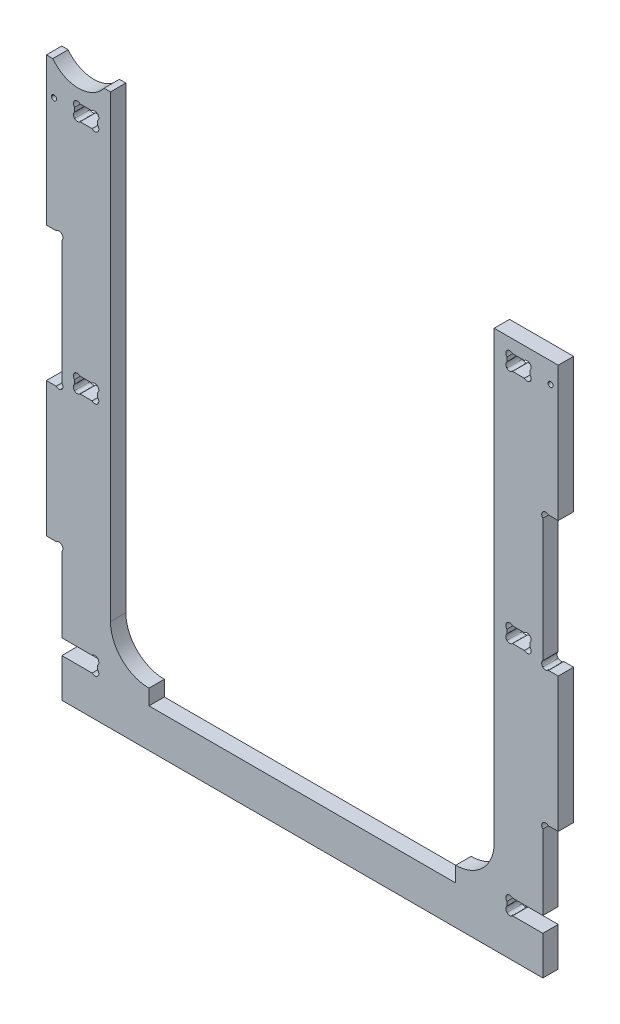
ISO-10303-21;
HEADER;
FILE_DESCRIPTION(('STEP AP214'),'2;1');
FILE_NAME('part.step','',(''),(''),'','','');
FILE_SCHEMA(('AUTOMOTIVE_DESIGN { 1 0 10303 214 1 1 1 1 }'));
ENDSEC;
DATA;
#1=APPLICATION_CONTEXT('core data for automotive mechanical design processes');
#2=APPLICATION_PROTOCOL_DEFINITION('international standard','automotive_design',2000,#1);
#3=PRODUCT_CONTEXT('',#1,'mechanical');
#4=PRODUCT('Part','Part','',(#3));
#5=PRODUCT_RELATED_PRODUCT_CATEGORY('part','',(#4));
#6=PRODUCT_DEFINITION_FORMATION('','',#4);
#7=PRODUCT_DEFINITION_CONTEXT('part definition',#1,'design');
#8=PRODUCT_DEFINITION('design','',#6,#7);
#9=PRODUCT_DEFINITION_SHAPE('','',#8);
#10=(LENGTH_UNIT() NAMED_UNIT(*) SI_UNIT(.MILLI.,.METRE.));
#11=(NAMED_UNIT(*) PLANE_ANGLE_UNIT() SI_UNIT($,.RADIAN.));
#12=(NAMED_UNIT(*) SI_UNIT($,.STERADIAN.) SOLID_ANGLE_UNIT());
#13=UNCERTAINTY_MEASURE_WITH_UNIT(LENGTH_MEASURE(1.E-05),#10,'distance_accuracy_value','');
#14=(GEOMETRIC_REPRESENTATION_CONTEXT(3) GLOBAL_UNCERTAINTY_ASSIGNED_CONTEXT((#13)) GLOBAL_UNIT_ASSIGNED_CONTEXT((#10,
#11,#12)) REPRESENTATION_CONTEXT('',''));
#15=CARTESIAN_POINT('',(0.,0.,0.));
#16=DIRECTION('',(0.,0.,1.));
#17=DIRECTION('',(1.,0.,0.));
#18=AXIS2_PLACEMENT_3D('',#15,#16,#17);
#19=CARTESIAN_POINT('',(2308.33230395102,0.,6.));
#20=DIRECTION('',(1.,0.,0.));
#21=DIRECTION('',(0.,0.,-1.));
#22=AXIS2_PLACEMENT_3D('',#19,#20,#21);
#23=PLANE('',#22);
#24=DIRECTION('',(0.,-1.,0.));
#25=VECTOR('',#24,1.);
#26=CARTESIAN_POINT('',(2308.33230395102,0.,6.));
#27=LINE('',#26,#25);
#28=CARTESIAN_POINT('',(2308.33230395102,-193.27615524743,6.));
#29=VERTEX_POINT('',#28);
#30=CARTESIAN_POINT('',(2308.33230395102,-208.376155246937,6.));
#31=VERTEX_POINT('',#30);
#32=EDGE_CURVE('E776',#29,#31,#27,.T.);
#33=ORIENTED_EDGE('',*,*,#32,.F.);
#34=DIRECTION('',(0.,0.,-1.));
#35=VECTOR('',#34,1.);
#36=CARTESIAN_POINT('',(2308.33230395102,-193.27615524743,6.));
#37=LINE('',#36,#35);
#38=CARTESIAN_POINT('',(2308.33230395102,-193.27615524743,0.));
#39=VERTEX_POINT('',#38);
#40=EDGE_CURVE('E1036',#29,#39,#37,.T.);
#41=ORIENTED_EDGE('',*,*,#40,.T.);
#42=DIRECTION('',(0.,-1.,0.));
#43=VECTOR('',#42,1.);
#44=CARTESIAN_POINT('',(2308.33230395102,0.,0.));
#45=LINE('',#44,#43);
#46=CARTESIAN_POINT('',(2308.33230395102,-208.376155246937,0.));
#47=VERTEX_POINT('',#46);
#48=EDGE_CURVE('E798',#39,#47,#45,.T.);
#49=ORIENTED_EDGE('',*,*,#48,.T.);
#50=DIRECTION('',(0.,0.,-1.));
#51=VECTOR('',#50,1.);
#52=CARTESIAN_POINT('',(2308.33230395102,-208.376155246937,6.));
#53=LINE('',#52,#51);
#54=EDGE_CURVE('E796',#31,#47,#53,.T.);
#55=ORIENTED_EDGE('',*,*,#54,.F.);
#56=EDGE_LOOP('',(#33,#41,#49,#55));
#57=FACE_BOUND('',#56,.T.);
#58=ADVANCED_FACE('F37',(#57),#23,.F.);
#59=CARTESIAN_POINT('',(2495.97404086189,0.,6.));
#60=DIRECTION('',(-1.,0.,0.));
#61=DIRECTION('',(0.,0.,1.));
#62=AXIS2_PLACEMENT_3D('',#59,#60,#61);
#63=PLANE('',#62);
#64=DIRECTION('',(0.,1.,0.));
#65=VECTOR('',#64,1.);
#66=CARTESIAN_POINT('',(2495.97404086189,0.,6.));
#67=LINE('',#66,#65);
#68=CARTESIAN_POINT('',(2495.97404086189,-187.276155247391,6.));
#69=VERTEX_POINT('',#68);
#70=CARTESIAN_POINT('',(2495.97404086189,-158.068186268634,6.));
#71=VERTEX_POINT('',#70);
#72=EDGE_CURVE('E728',#69,#71,#67,.T.);
#73=ORIENTED_EDGE('',*,*,#72,.F.);
#74=DIRECTION('',(0.,0.,-1.));
#75=VECTOR('',#74,1.);
#76=CARTESIAN_POINT('',(2495.97404086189,-187.276155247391,6.));
#77=LINE('',#76,#75);
#78=CARTESIAN_POINT('',(2495.97404086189,-187.276155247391,0.));
#79=VERTEX_POINT('',#78);
#80=EDGE_CURVE('E719',#69,#79,#77,.T.);
#81=ORIENTED_EDGE('',*,*,#80,.T.);
#82=DIRECTION('',(0.,1.,0.));
#83=VECTOR('',#82,1.);
#84=CARTESIAN_POINT('',(2495.97404086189,0.,0.));
#85=LINE('',#84,#83);
#86=CARTESIAN_POINT('',(2495.97404086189,-158.068186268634,0.));
#87=VERTEX_POINT('',#86);
#88=EDGE_CURVE('E1528',#79,#87,#85,.T.);
#89=ORIENTED_EDGE('',*,*,#88,.T.);
#90=DIRECTION('',(0.,0.,-1.));
#91=VECTOR('',#90,1.);
#92=CARTESIAN_POINT('',(2495.97404086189,-158.068186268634,6.));
#93=LINE('',#92,#91);
#94=EDGE_CURVE('E804',#71,#87,#93,.T.);
#95=ORIENTED_EDGE('',*,*,#94,.F.);
#96=EDGE_LOOP('',(#73,#81,#89,#95));
#97=FACE_BOUND('',#96,.T.);
#98=ADVANCED_FACE('F756',(#97),#63,.F.);
#99=CARTESIAN_POINT('',(2476.97404086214,0.,6.));
#100=DIRECTION('',(1.,0.,0.));
#101=DIRECTION('',(0.,0.,-1.));
#102=AXIS2_PLACEMENT_3D('',#99,#100,#101);
#103=PLANE('',#102);
#104=DIRECTION('',(0.,-1.,0.));
#105=VECTOR('',#104,1.);
#106=CARTESIAN_POINT('',(2476.97404086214,0.,0.));
#107=LINE('',#106,#105);
#108=CARTESIAN_POINT('',(2476.97404086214,1.62384475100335,0.));
#109=VERTEX_POINT('',#108);
#110=CARTESIAN_POINT('',(2476.97404086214,-172.276155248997,0.));
#111=VERTEX_POINT('',#110);
#112=EDGE_CURVE('E1427',#109,#111,#107,.T.);
#113=ORIENTED_EDGE('',*,*,#112,.T.);
#114=DIRECTION('',(0.,0.,-1.));
#115=VECTOR('',#114,1.);
#116=CARTESIAN_POINT('',(2476.97404086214,-172.276155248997,6.));
#117=LINE('',#116,#115);
#118=CARTESIAN_POINT('',(2476.97404086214,-172.276155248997,6.));
#119=VERTEX_POINT('',#118);
#120=EDGE_CURVE('E11',#119,#111,#117,.T.);
#121=ORIENTED_EDGE('',*,*,#120,.F.);
#122=DIRECTION('',(0.,-1.,0.));
#123=VECTOR('',#122,1.);
#124=CARTESIAN_POINT('',(2476.97404086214,0.,6.));
#125=LINE('',#124,#123);
#126=CARTESIAN_POINT('',(2476.97404086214,1.62384475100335,6.));
#127=VERTEX_POINT('',#126);
#128=EDGE_CURVE('E3258',#127,#119,#125,.T.);
#129=ORIENTED_EDGE('',*,*,#128,.F.);
#130=DIRECTION('',(0.,0.,-1.));
#131=VECTOR('',#130,1.);
#132=CARTESIAN_POINT('',(2476.97404086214,1.62384475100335,6.));
#133=LINE('',#132,#131);
#134=EDGE_CURVE('E892',#127,#109,#133,.T.);
#135=ORIENTED_EDGE('',*,*,#134,.T.);
#136=EDGE_LOOP('',(#113,#121,#129,#135));
#137=FACE_BOUND('',#136,.T.);
#138=ADVANCED_FACE('F1685',(#137),#103,.F.);
#139=CARTESIAN_POINT('',(2476.97404086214,-172.276155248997,6.));
#140=CARTESIAN_POINT('',(2476.97404086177,-180.560426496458,6.));
#141=CARTESIAN_POINT('',(2470.25831210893,-187.276155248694,6.));
#142=CARTESIAN_POINT('',(2461.97404086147,-187.276155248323,6.));
#143=B_SPLINE_CURVE_WITH_KNOTS('',3,(#139,#140,#141,#142),.UNSPECIFIED.,.F.,.F.,(4,4),(38.,39.),.UNSPECIFIED.);
#144=DIRECTION('',(0.,0.,-1.));
#145=VECTOR('',#144,1.);
#146=SURFACE_OF_LINEAR_EXTRUSION('',#143,#145);
#147=CARTESIAN_POINT('',(2476.97404086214,-172.276155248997,0.));
#148=CARTESIAN_POINT('',(2476.97404086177,-180.560426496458,0.));
#149=CARTESIAN_POINT('',(2470.25831210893,-187.276155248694,0.));
#150=CARTESIAN_POINT('',(2461.97404086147,-187.276155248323,0.));
#151=B_SPLINE_CURVE_WITH_KNOTS('',3,(#147,#148,#149,#150),.UNSPECIFIED.,.F.,.F.,(4,4),(38.,39.),.UNSPECIFIED.);
#152=CARTESIAN_POINT('',(2461.97404086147,-187.276155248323,0.));
#153=VERTEX_POINT('',#152);
#154=EDGE_CURVE('E1430',#111,#153,#151,.T.);
#155=ORIENTED_EDGE('',*,*,#154,.T.);
#156=DIRECTION('',(0.,0.,-1.));
#157=VECTOR('',#156,1.);
#158=CARTESIAN_POINT('',(2461.97404086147,-187.276155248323,6.));
#159=LINE('',#158,#157);
#160=CARTESIAN_POINT('',(2461.97404086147,-187.276155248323,6.));
#161=VERTEX_POINT('',#160);
#162=EDGE_CURVE('E47',#161,#153,#159,.T.);
#163=ORIENTED_EDGE('',*,*,#162,.F.);
#164=EDGE_CURVE('E3260',#119,#161,#143,.T.);
#165=ORIENTED_EDGE('',*,*,#164,.F.);
#166=ORIENTED_EDGE('',*,*,#120,.T.);
#167=EDGE_LOOP('',(#155,#163,#165,#166));
#168=FACE_BOUND('',#167,.T.);
#169=ADVANCED_FACE('F1690',(#168),#146,.F.);
#170=CARTESIAN_POINT('',(2461.97404086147,0.,6.));
#171=DIRECTION('',(1.,0.,0.));
#172=DIRECTION('',(0.,0.,-1.));
#173=AXIS2_PLACEMENT_3D('',#170,#171,#172);
#174=PLANE('',#173);
#175=DIRECTION('',(0.,-1.,0.));
#176=VECTOR('',#175,1.);
#177=CARTESIAN_POINT('',(2461.97404086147,0.,0.));
#178=LINE('',#177,#176);
#179=CARTESIAN_POINT('',(2461.97404086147,-193.276155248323,0.));
#180=VERTEX_POINT('',#179);
#181=EDGE_CURVE('E1434',#153,#180,#178,.T.);
#182=ORIENTED_EDGE('',*,*,#181,.T.);
#183=DIRECTION('',(0.,0.,-1.));
#184=VECTOR('',#183,1.);
#185=CARTESIAN_POINT('',(2461.97404086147,-193.276155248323,6.));
#186=LINE('',#185,#184);
#187=CARTESIAN_POINT('',(2461.97404086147,-193.276155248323,6.));
#188=VERTEX_POINT('',#187);
#189=EDGE_CURVE('E870',#188,#180,#186,.T.);
#190=ORIENTED_EDGE('',*,*,#189,.F.);
#191=DIRECTION('',(0.,-1.,0.));
#192=VECTOR('',#191,1.);
#193=CARTESIAN_POINT('',(2461.97404086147,0.,6.));
#194=LINE('',#193,#192);
#195=EDGE_CURVE('E3265',#161,#188,#194,.T.);
#196=ORIENTED_EDGE('',*,*,#195,.F.);
#197=ORIENTED_EDGE('',*,*,#162,.T.);
#198=EDGE_LOOP('',(#182,#190,#196,#197));
#199=FACE_BOUND('',#198,.T.);
#200=ADVANCED_FACE('F2700',(#199),#174,.F.);
#201=CARTESIAN_POINT('',(0.,-193.276155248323,6.));
#202=DIRECTION('',(0.,-1.,0.));
#203=DIRECTION('',(0.,0.,-1.));
#204=AXIS2_PLACEMENT_3D('',#201,#202,#203);
#205=PLANE('',#204);
#206=DIRECTION('',(-1.,0.,0.));
#207=VECTOR('',#206,1.);
#208=CARTESIAN_POINT('',(0.,-193.276155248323,0.));
#209=LINE('',#208,#207);
#210=CARTESIAN_POINT('',(2342.33230395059,-193.276155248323,0.));
#211=VERTEX_POINT('',#210);
#212=EDGE_CURVE('E1439',#180,#211,#209,.T.);
#213=ORIENTED_EDGE('',*,*,#212,.T.);
#214=DIRECTION('',(0.,0.,-1.));
#215=VECTOR('',#214,1.);
#216=CARTESIAN_POINT('',(2342.33230395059,-193.276155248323,6.));
#217=LINE('',#216,#215);
#218=CARTESIAN_POINT('',(2342.33230395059,-193.276155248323,6.));
#219=VERTEX_POINT('',#218);
#220=EDGE_CURVE('E867',#219,#211,#217,.T.);
#221=ORIENTED_EDGE('',*,*,#220,.F.);
#222=DIRECTION('',(-1.,0.,0.));
#223=VECTOR('',#222,1.);
#224=CARTESIAN_POINT('',(0.,-193.276155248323,6.));
#225=LINE('',#224,#223);
#226=EDGE_CURVE('E3416',#188,#219,#225,.T.);
#227=ORIENTED_EDGE('',*,*,#226,.F.);
#228=ORIENTED_EDGE('',*,*,#189,.T.);
#229=EDGE_LOOP('',(#213,#221,#227,#228));
#230=FACE_BOUND('',#229,.T.);
#231=ADVANCED_FACE('F2691',(#230),#205,.F.);
#232=CARTESIAN_POINT('',(2342.33230395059,0.,6.));
#233=DIRECTION('',(-1.,0.,0.));
#234=DIRECTION('',(0.,0.,1.));
#235=AXIS2_PLACEMENT_3D('',#232,#233,#234);
#236=PLANE('',#235);
#237=DIRECTION('',(0.,1.,0.));
#238=VECTOR('',#237,1.);
#239=CARTESIAN_POINT('',(2342.33230395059,0.,0.));
#240=LINE('',#239,#238);
#241=CARTESIAN_POINT('',(2342.33230395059,-187.276155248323,0.));
#242=VERTEX_POINT('',#241);
#243=EDGE_CURVE('E1441',#211,#242,#240,.T.);
#244=ORIENTED_EDGE('',*,*,#243,.T.);
#245=DIRECTION('',(0.,0.,-1.));
#246=VECTOR('',#245,1.);
#247=CARTESIAN_POINT('',(2342.33230395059,-187.276155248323,6.));
#248=LINE('',#247,#246);
#249=CARTESIAN_POINT('',(2342.33230395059,-187.276155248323,6.));
#250=VERTEX_POINT('',#249);
#251=EDGE_CURVE('E864',#250,#242,#248,.T.);
#252=ORIENTED_EDGE('',*,*,#251,.F.);
#253=DIRECTION('',(0.,1.,0.));
#254=VECTOR('',#253,1.);
#255=CARTESIAN_POINT('',(2342.33230395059,0.,6.));
#256=LINE('',#255,#254);
#257=EDGE_CURVE('E3278',#219,#250,#256,.T.);
#258=ORIENTED_EDGE('',*,*,#257,.F.);
#259=ORIENTED_EDGE('',*,*,#220,.T.);
#260=EDGE_LOOP('',(#244,#252,#258,#259));
#261=FACE_BOUND('',#260,.T.);
#262=ADVANCED_FACE('F2683',(#261),#236,.F.);
#263=CARTESIAN_POINT('',(2342.33230395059,-187.276155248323,6.));
#264=CARTESIAN_POINT('',(2334.04803270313,-187.276155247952,6.));
#265=CARTESIAN_POINT('',(2327.33230395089,-180.560426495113,6.));
#266=CARTESIAN_POINT('',(2327.33230395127,-172.276155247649,6.));
#267=B_SPLINE_CURVE_WITH_KNOTS('',3,(#263,#264,#265,#266),.UNSPECIFIED.,.F.,.F.,(4,4),(1.,2.),.UNSPECIFIED.);
#268=DIRECTION('',(0.,0.,-1.));
#269=VECTOR('',#268,1.);
#270=SURFACE_OF_LINEAR_EXTRUSION('',#267,#269);
#271=CARTESIAN_POINT('',(2342.33230395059,-187.276155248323,0.));
#272=CARTESIAN_POINT('',(2334.04803270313,-187.276155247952,0.));
#273=CARTESIAN_POINT('',(2327.33230395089,-180.560426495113,0.));
#274=CARTESIAN_POINT('',(2327.33230395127,-172.276155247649,0.));
#275=B_SPLINE_CURVE_WITH_KNOTS('',3,(#271,#272,#273,#274),.UNSPECIFIED.,.F.,.F.,(4,4),(1.,2.),.UNSPECIFIED.);
#276=CARTESIAN_POINT('',(2327.33230395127,-172.276155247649,0.));
#277=VERTEX_POINT('',#276);
#278=EDGE_CURVE('E1443',#242,#277,#275,.T.);
#279=ORIENTED_EDGE('',*,*,#278,.T.);
#280=DIRECTION('',(0.,0.,-1.));
#281=VECTOR('',#280,1.);
#282=CARTESIAN_POINT('',(2327.33230395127,-172.276155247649,6.));
#283=LINE('',#282,#281);
#284=CARTESIAN_POINT('',(2327.33230395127,-172.276155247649,6.));
#285=VERTEX_POINT('',#284);
#286=EDGE_CURVE('E861',#285,#277,#283,.T.);
#287=ORIENTED_EDGE('',*,*,#286,.F.);
#288=EDGE_CURVE('E3271',#250,#285,#267,.T.);
#289=ORIENTED_EDGE('',*,*,#288,.F.);
#290=ORIENTED_EDGE('',*,*,#251,.T.);
#291=EDGE_LOOP('',(#279,#287,#289,#290));
#292=FACE_BOUND('',#291,.T.);
#293=ADVANCED_FACE('F2674',(#292),#270,.F.);
#294=CARTESIAN_POINT('',(2327.33230395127,0.,6.));
#295=DIRECTION('',(-1.,0.,0.));
#296=DIRECTION('',(0.,0.,1.));
#297=AXIS2_PLACEMENT_3D('',#294,#295,#296);
#298=PLANE('',#297);
#299=DIRECTION('',(0.,1.,0.));
#300=VECTOR('',#299,1.);
#301=CARTESIAN_POINT('',(2327.33230395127,0.,0.));
#302=LINE('',#301,#300);
#303=CARTESIAN_POINT('',(2327.33230395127,6.62384475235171,0.));
#304=VERTEX_POINT('',#303);
#305=EDGE_CURVE('E1447',#277,#304,#302,.T.);
#306=ORIENTED_EDGE('',*,*,#305,.T.);
#307=DIRECTION('',(0.,0.,-1.));
#308=VECTOR('',#307,1.);
#309=CARTESIAN_POINT('',(2327.33230395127,6.62384475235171,6.));
#310=LINE('',#309,#308);
#311=CARTESIAN_POINT('',(2327.33230395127,6.62384475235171,6.));
#312=VERTEX_POINT('',#311);
#313=EDGE_CURVE('E858',#312,#304,#310,.T.);
#314=ORIENTED_EDGE('',*,*,#313,.F.);
#315=DIRECTION('',(0.,1.,0.));
#316=VECTOR('',#315,1.);
#317=CARTESIAN_POINT('',(2327.33230395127,0.,6.));
#318=LINE('',#317,#316);
#319=EDGE_CURVE('E3277',#285,#312,#318,.T.);
#320=ORIENTED_EDGE('',*,*,#319,.F.);
#321=ORIENTED_EDGE('',*,*,#286,.T.);
#322=EDGE_LOOP('',(#306,#314,#320,#321));
#323=FACE_BOUND('',#322,.T.);
#324=ADVANCED_FACE('F2665',(#323),#298,.F.);
#325=CARTESIAN_POINT('',(0.,6.62384475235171,6.));
#326=DIRECTION('',(0.,-1.,0.));
#327=DIRECTION('',(0.,0.,-1.));
#328=AXIS2_PLACEMENT_3D('',#325,#326,#327);
#329=PLANE('',#328);
#330=DIRECTION('',(-1.,0.,0.));
#331=VECTOR('',#330,1.);
#332=CARTESIAN_POINT('',(0.,6.62384475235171,0.));
#333=LINE('',#332,#331);
#334=CARTESIAN_POINT('',(2324.83230395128,6.62384475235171,0.));
#335=VERTEX_POINT('',#334);
#336=EDGE_CURVE('E1452',#304,#335,#333,.T.);
#337=ORIENTED_EDGE('',*,*,#336,.T.);
#338=DIRECTION('',(0.,0.,-1.));
#339=VECTOR('',#338,1.);
#340=CARTESIAN_POINT('',(2324.83230395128,6.62384475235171,6.));
#341=LINE('',#340,#339);
#342=CARTESIAN_POINT('',(2324.83230395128,6.62384475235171,6.));
#343=VERTEX_POINT('',#342);
#344=EDGE_CURVE('E855',#343,#335,#341,.T.);
#345=ORIENTED_EDGE('',*,*,#344,.F.);
#346=DIRECTION('',(-1.,0.,0.));
#347=VECTOR('',#346,1.);
#348=CARTESIAN_POINT('',(0.,6.62384475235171,6.));
#349=LINE('',#348,#347);
#350=EDGE_CURVE('E3283',#312,#343,#349,.T.);
#351=ORIENTED_EDGE('',*,*,#350,.F.);
#352=ORIENTED_EDGE('',*,*,#313,.T.);
#353=EDGE_LOOP('',(#337,#345,#351,#352));
#354=FACE_BOUND('',#353,.T.);
#355=ADVANCED_FACE('F2656',(#354),#329,.F.);
#356=CARTESIAN_POINT('',(2324.83230395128,6.62384475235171,6.));
#357=CARTESIAN_POINT('',(2324.12162583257,5.67627392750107,6.));
#358=CARTESIAN_POINT('',(2323.27987477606,4.83452287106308,6.));
#359=CARTESIAN_POINT('',(2322.33230395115,4.12384475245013,6.));
#360=B_SPLINE_CURVE_WITH_KNOTS('',3,(#356,#357,#358,#359),.UNSPECIFIED.,.F.,.F.,(4,4),(4.,5.),.UNSPECIFIED.);
#361=DIRECTION('',(0.,0.,-1.));
#362=VECTOR('',#361,1.);
#363=SURFACE_OF_LINEAR_EXTRUSION('',#360,#362);
#364=CARTESIAN_POINT('',(2324.83230395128,6.62384475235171,0.));
#365=CARTESIAN_POINT('',(2324.12162583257,5.67627392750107,0.));
#366=CARTESIAN_POINT('',(2323.27987477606,4.83452287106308,0.));
#367=CARTESIAN_POINT('',(2322.33230395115,4.12384475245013,0.));
#368=B_SPLINE_CURVE_WITH_KNOTS('',3,(#364,#365,#366,#367),.UNSPECIFIED.,.F.,.F.,(4,4),(4.,5.),.UNSPECIFIED.);
#369=CARTESIAN_POINT('',(2322.33230395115,4.12384475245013,0.));
#370=VERTEX_POINT('',#369);
#371=EDGE_CURVE('E1454',#335,#370,#368,.T.);
#372=ORIENTED_EDGE('',*,*,#371,.T.);
#373=DIRECTION('',(0.,0.,-1.));
#374=VECTOR('',#373,1.);
#375=CARTESIAN_POINT('',(2322.33230395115,4.12384475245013,6.));
#376=LINE('',#375,#374);
#377=CARTESIAN_POINT('',(2322.33230395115,4.12384475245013,6.));
#378=VERTEX_POINT('',#377);
#379=EDGE_CURVE('E852',#378,#370,#376,.T.);
#380=ORIENTED_EDGE('',*,*,#379,.F.);
#381=EDGE_CURVE('E3285',#343,#378,#360,.T.);
#382=ORIENTED_EDGE('',*,*,#381,.F.);
#383=ORIENTED_EDGE('',*,*,#344,.T.);
#384=EDGE_LOOP('',(#372,#380,#382,#383));
#385=FACE_BOUND('',#384,.T.);
#386=ADVANCED_FACE('F2647',(#385),#363,.F.);
#387=CARTESIAN_POINT('',(2322.33230395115,4.12384475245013,6.));
#388=CARTESIAN_POINT('',(2316.80945645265,-0.0182908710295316,6.));
#389=CARTESIAN_POINT('',(2308.97443957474,1.10099725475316,6.));
#390=CARTESIAN_POINT('',(2304.83230395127,6.62384475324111,6.));
#391=B_SPLINE_CURVE_WITH_KNOTS('',3,(#387,#388,#389,#390),.UNSPECIFIED.,.F.,.F.,(4,4),(5.,6.),.UNSPECIFIED.);
#392=DIRECTION('',(0.,0.,-1.));
#393=VECTOR('',#392,1.);
#394=SURFACE_OF_LINEAR_EXTRUSION('',#391,#393);
#395=CARTESIAN_POINT('',(2322.33230395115,4.12384475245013,0.));
#396=CARTESIAN_POINT('',(2316.80945645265,-0.0182908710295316,0.));
#397=CARTESIAN_POINT('',(2308.97443957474,1.10099725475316,0.));
#398=CARTESIAN_POINT('',(2304.83230395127,6.62384475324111,0.));
#399=B_SPLINE_CURVE_WITH_KNOTS('',3,(#395,#396,#397,#398),.UNSPECIFIED.,.F.,.F.,(4,4),(5.,6.),.UNSPECIFIED.);
#400=CARTESIAN_POINT('',(2304.83230395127,6.62384475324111,0.));
#401=VERTEX_POINT('',#400);
#402=EDGE_CURVE('E1458',#370,#401,#399,.T.);
#403=ORIENTED_EDGE('',*,*,#402,.T.);
#404=DIRECTION('',(0.,0.,-1.));
#405=VECTOR('',#404,1.);
#406=CARTESIAN_POINT('',(2304.83230395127,6.62384475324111,6.));
#407=LINE('',#406,#405);
#408=CARTESIAN_POINT('',(2304.83230395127,6.62384475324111,6.));
#409=VERTEX_POINT('',#408);
#410=EDGE_CURVE('E849',#409,#401,#407,.T.);
#411=ORIENTED_EDGE('',*,*,#410,.F.);
#412=EDGE_CURVE('E3290',#378,#409,#391,.T.);
#413=ORIENTED_EDGE('',*,*,#412,.F.);
#414=ORIENTED_EDGE('',*,*,#379,.T.);
#415=EDGE_LOOP('',(#403,#411,#413,#414));
#416=FACE_BOUND('',#415,.T.);
#417=ADVANCED_FACE('F2638',(#416),#394,.F.);
#418=CARTESIAN_POINT('',(0.,6.62384475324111,6.));
#419=DIRECTION('',(0.,-1.,0.));
#420=DIRECTION('',(0.,0.,-1.));
#421=AXIS2_PLACEMENT_3D('',#418,#419,#420);
#422=PLANE('',#421);
#423=DIRECTION('',(-1.,0.,0.));
#424=VECTOR('',#423,1.);
#425=CARTESIAN_POINT('',(0.,6.62384475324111,0.));
#426=LINE('',#425,#424);
#427=CARTESIAN_POINT('',(2302.33230395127,6.62384475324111,0.));
#428=VERTEX_POINT('',#427);
#429=EDGE_CURVE('E1465',#401,#428,#426,.T.);
#430=ORIENTED_EDGE('',*,*,#429,.T.);
#431=DIRECTION('',(0.,0.,-1.));
#432=VECTOR('',#431,1.);
#433=CARTESIAN_POINT('',(2302.33230395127,6.62384475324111,6.));
#434=LINE('',#433,#432);
#435=CARTESIAN_POINT('',(2302.33230395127,6.62384475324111,6.));
#436=VERTEX_POINT('',#435);
#437=EDGE_CURVE('E846',#436,#428,#434,.T.);
#438=ORIENTED_EDGE('',*,*,#437,.F.);
#439=DIRECTION('',(-1.,0.,0.));
#440=VECTOR('',#439,1.);
#441=CARTESIAN_POINT('',(0.,6.62384475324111,6.));
#442=LINE('',#441,#440);
#443=EDGE_CURVE('E3395',#409,#436,#442,.T.);
#444=ORIENTED_EDGE('',*,*,#443,.F.);
#445=ORIENTED_EDGE('',*,*,#410,.T.);
#446=EDGE_LOOP('',(#430,#438,#444,#445));
#447=FACE_BOUND('',#446,.T.);
#448=ADVANCED_FACE('F2629',(#447),#422,.F.);
#449=CARTESIAN_POINT('',(2302.33230395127,0.,6.));
#450=DIRECTION('',(1.,0.,0.));
#451=DIRECTION('',(0.,0.,-1.));
#452=AXIS2_PLACEMENT_3D('',#449,#450,#451);
#453=PLANE('',#452);
#454=DIRECTION('',(0.,-1.,0.));
#455=VECTOR('',#454,1.);
#456=CARTESIAN_POINT('',(2302.33230395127,0.,0.));
#457=LINE('',#456,#455);
#458=CARTESIAN_POINT('',(2302.33230395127,-50.8761552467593,0.));
#459=VERTEX_POINT('',#458);
#460=EDGE_CURVE('E1470',#428,#459,#457,.T.);
#461=ORIENTED_EDGE('',*,*,#460,.T.);
#462=DIRECTION('',(0.,0.,-1.));
#463=VECTOR('',#462,1.);
#464=CARTESIAN_POINT('',(2302.33230395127,-50.8761552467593,6.));
#465=LINE('',#464,#463);
#466=CARTESIAN_POINT('',(2302.33230395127,-50.8761552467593,6.));
#467=VERTEX_POINT('',#466);
#468=EDGE_CURVE('E843',#467,#459,#465,.T.);
#469=ORIENTED_EDGE('',*,*,#468,.F.);
#470=DIRECTION('',(0.,-1.,0.));
#471=VECTOR('',#470,1.);
#472=CARTESIAN_POINT('',(2302.33230395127,0.,6.));
#473=LINE('',#472,#471);
#474=EDGE_CURVE('E3393',#436,#467,#473,.T.);
#475=ORIENTED_EDGE('',*,*,#474,.F.);
#476=ORIENTED_EDGE('',*,*,#437,.T.);
#477=EDGE_LOOP('',(#461,#469,#475,#476));
#478=FACE_BOUND('',#477,.T.);
#479=ADVANCED_FACE('F2620',(#478),#453,.F.);
#480=CARTESIAN_POINT('',(0.,-50.8761552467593,6.));
#481=DIRECTION('',(0.,1.,0.));
#482=DIRECTION('',(0.,0.,1.));
#483=AXIS2_PLACEMENT_3D('',#480,#481,#482);
#484=PLANE('',#483);
#485=DIRECTION('',(1.,0.,0.));
#486=VECTOR('',#485,1.);
#487=CARTESIAN_POINT('',(0.,-50.8761552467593,0.));
#488=LINE('',#487,#486);
#489=CARTESIAN_POINT('',(2306.14027292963,-50.8761552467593,0.));
#490=VERTEX_POINT('',#489);
#491=EDGE_CURVE('E1472',#459,#490,#488,.T.);
#492=ORIENTED_EDGE('',*,*,#491,.T.);
#493=DIRECTION('',(0.,0.,-1.));
#494=VECTOR('',#493,1.);
#495=CARTESIAN_POINT('',(2306.14027292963,-50.8761552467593,6.));
#496=LINE('',#495,#494);
#497=CARTESIAN_POINT('',(2306.14027292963,-50.8761552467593,6.));
#498=VERTEX_POINT('',#497);
#499=EDGE_CURVE('E840',#498,#490,#496,.T.);
#500=ORIENTED_EDGE('',*,*,#499,.F.);
#501=DIRECTION('',(1.,0.,0.));
#502=VECTOR('',#501,1.);
#503=CARTESIAN_POINT('',(0.,-50.8761552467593,6.));
#504=LINE('',#503,#502);
#505=EDGE_CURVE('E3306',#467,#498,#504,.T.);
#506=ORIENTED_EDGE('',*,*,#505,.F.);
#507=ORIENTED_EDGE('',*,*,#468,.T.);
#508=EDGE_LOOP('',(#492,#500,#506,#507));
#509=FACE_BOUND('',#508,.T.);
#510=ADVANCED_FACE('F2611',(#509),#484,.F.);
#511=CARTESIAN_POINT('',(2306.14027292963,-50.8761552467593,6.));
#512=CARTESIAN_POINT('',(2306.74558558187,-50.2708425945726,6.));
#513=CARTESIAN_POINT('',(2307.72699129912,-50.2708425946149,6.));
#514=CARTESIAN_POINT('',(2308.33230395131,-50.8761552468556,6.));
#515=B_SPLINE_CURVE_WITH_KNOTS('',3,(#511,#512,#513,#514),.UNSPECIFIED.,.F.,.F.,(4,4),(9.,10.),.UNSPECIFIED.);
#516=DIRECTION('',(0.,0.,-1.));
#517=VECTOR('',#516,1.);
#518=SURFACE_OF_LINEAR_EXTRUSION('',#515,#517);
#519=CARTESIAN_POINT('',(2306.14027292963,-50.8761552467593,0.));
#520=CARTESIAN_POINT('',(2306.74558558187,-50.2708425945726,0.));
#521=CARTESIAN_POINT('',(2307.72699129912,-50.2708425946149,0.));
#522=CARTESIAN_POINT('',(2308.33230395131,-50.8761552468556,0.));
#523=B_SPLINE_CURVE_WITH_KNOTS('',3,(#519,#520,#521,#522),.UNSPECIFIED.,.F.,.F.,(4,4),(9.,10.),.UNSPECIFIED.);
#524=CARTESIAN_POINT('',(2308.33230395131,-50.8761552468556,0.));
#525=VERTEX_POINT('',#524);
#526=EDGE_CURVE('E1474',#490,#525,#523,.T.);
#527=ORIENTED_EDGE('',*,*,#526,.T.);
#528=DIRECTION('',(0.,0.,-1.));
#529=VECTOR('',#528,1.);
#530=CARTESIAN_POINT('',(2308.33230395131,-50.8761552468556,6.));
#531=LINE('',#530,#529);
#532=CARTESIAN_POINT('',(2308.33230395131,-50.8761552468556,6.));
#533=VERTEX_POINT('',#532);
#534=EDGE_CURVE('E837',#533,#525,#531,.T.);
#535=ORIENTED_EDGE('',*,*,#534,.F.);
#536=EDGE_CURVE('E3300',#498,#533,#515,.T.);
#537=ORIENTED_EDGE('',*,*,#536,.F.);
#538=ORIENTED_EDGE('',*,*,#499,.T.);
#539=EDGE_LOOP('',(#527,#535,#537,#538));
#540=FACE_BOUND('',#539,.T.);
#541=ADVANCED_FACE('F2602',(#540),#518,.F.);
#542=CARTESIAN_POINT('',(2308.33230395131,-50.8761552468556,6.));
#543=CARTESIAN_POINT('',(2308.9376166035,-51.4814678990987,6.));
#544=CARTESIAN_POINT('',(2308.93761660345,-52.4628736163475,6.));
#545=CARTESIAN_POINT('',(2308.33230395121,-53.0681862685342,6.));
#546=B_SPLINE_CURVE_WITH_KNOTS('',3,(#542,#543,#544,#545),.UNSPECIFIED.,.F.,.F.,(4,4),(10.,11.),.UNSPECIFIED.);
#547=DIRECTION('',(0.,0.,-1.));
#548=VECTOR('',#547,1.);
#549=SURFACE_OF_LINEAR_EXTRUSION('',#546,#548);
#550=CARTESIAN_POINT('',(2308.33230395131,-50.8761552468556,0.));
#551=CARTESIAN_POINT('',(2308.9376166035,-51.4814678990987,0.));
#552=CARTESIAN_POINT('',(2308.93761660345,-52.4628736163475,0.));
#553=CARTESIAN_POINT('',(2308.33230395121,-53.0681862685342,0.));
#554=B_SPLINE_CURVE_WITH_KNOTS('',3,(#550,#551,#552,#553),.UNSPECIFIED.,.F.,.F.,(4,4),(10.,11.),.UNSPECIFIED.);
#555=CARTESIAN_POINT('',(2308.33230395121,-53.0681862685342,0.));
#556=VERTEX_POINT('',#555);
#557=EDGE_CURVE('E1478',#525,#556,#554,.T.);
#558=ORIENTED_EDGE('',*,*,#557,.T.);
#559=DIRECTION('',(0.,0.,-1.));
#560=VECTOR('',#559,1.);
#561=CARTESIAN_POINT('',(2308.33230395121,-53.0681862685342,6.));
#562=LINE('',#561,#560);
#563=CARTESIAN_POINT('',(2308.33230395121,-53.0681862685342,6.));
#564=VERTEX_POINT('',#563);
#565=EDGE_CURVE('E834',#564,#556,#562,.T.);
#566=ORIENTED_EDGE('',*,*,#565,.F.);
#567=EDGE_CURVE('E3305',#533,#564,#546,.T.);
#568=ORIENTED_EDGE('',*,*,#567,.F.);
#569=ORIENTED_EDGE('',*,*,#534,.T.);
#570=EDGE_LOOP('',(#558,#566,#568,#569));
#571=FACE_BOUND('',#570,.T.);
#572=ADVANCED_FACE('F2593',(#571),#549,.F.);
#573=CARTESIAN_POINT('',(2308.33230395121,0.,6.));
#574=DIRECTION('',(1.,0.,0.));
#575=DIRECTION('',(0.,0.,-1.));
#576=AXIS2_PLACEMENT_3D('',#573,#574,#575);
#577=PLANE('',#576);
#578=DIRECTION('',(0.,-1.,0.));
#579=VECTOR('',#578,1.);
#580=CARTESIAN_POINT('',(2308.33230395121,0.,0.));
#581=LINE('',#580,#579);
#582=CARTESIAN_POINT('',(2308.33230395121,-101.184124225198,0.));
#583=VERTEX_POINT('',#582);
#584=EDGE_CURVE('E1485',#556,#583,#581,.T.);
#585=ORIENTED_EDGE('',*,*,#584,.T.);
#586=DIRECTION('',(0.,0.,-1.));
#587=VECTOR('',#586,1.);
#588=CARTESIAN_POINT('',(2308.33230395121,-101.184124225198,6.));
#589=LINE('',#588,#587);
#590=CARTESIAN_POINT('',(2308.33230395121,-101.184124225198,6.));
#591=VERTEX_POINT('',#590);
#592=EDGE_CURVE('E831',#591,#583,#589,.T.);
#593=ORIENTED_EDGE('',*,*,#592,.F.);
#594=DIRECTION('',(0.,-1.,0.));
#595=VECTOR('',#594,1.);
#596=CARTESIAN_POINT('',(2308.33230395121,0.,6.));
#597=LINE('',#596,#595);
#598=EDGE_CURVE('E3315',#564,#591,#597,.T.);
#599=ORIENTED_EDGE('',*,*,#598,.F.);
#600=ORIENTED_EDGE('',*,*,#565,.T.);
#601=EDGE_LOOP('',(#585,#593,#599,#600));
#602=FACE_BOUND('',#601,.T.);
#603=ADVANCED_FACE('F2584',(#602),#577,.F.);
#604=CARTESIAN_POINT('',(2308.33230395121,-101.184124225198,6.));
#605=CARTESIAN_POINT('',(2308.93761660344,-101.789436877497,6.));
#606=CARTESIAN_POINT('',(2308.9376166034,-102.770842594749,6.));
#607=CARTESIAN_POINT('',(2308.33230395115,-103.376155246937,6.));
#608=B_SPLINE_CURVE_WITH_KNOTS('',3,(#604,#605,#606,#607),.UNSPECIFIED.,.F.,.F.,(4,4),(12.,13.),.UNSPECIFIED.);
#609=DIRECTION('',(0.,0.,-1.));
#610=VECTOR('',#609,1.);
#611=SURFACE_OF_LINEAR_EXTRUSION('',#608,#610);
#612=CARTESIAN_POINT('',(2308.33230395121,-101.184124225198,0.));
#613=CARTESIAN_POINT('',(2308.93761660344,-101.789436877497,0.));
#614=CARTESIAN_POINT('',(2308.9376166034,-102.770842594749,0.));
#615=CARTESIAN_POINT('',(2308.33230395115,-103.376155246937,0.));
#616=B_SPLINE_CURVE_WITH_KNOTS('',3,(#612,#613,#614,#615),.UNSPECIFIED.,.F.,.F.,(4,4),(12.,13.),.UNSPECIFIED.);
#617=CARTESIAN_POINT('',(2308.33230395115,-103.376155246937,0.));
#618=VERTEX_POINT('',#617);
#619=EDGE_CURVE('E1490',#583,#618,#616,.T.);
#620=ORIENTED_EDGE('',*,*,#619,.T.);
#621=DIRECTION('',(0.,0.,-1.));
#622=VECTOR('',#621,1.);
#623=CARTESIAN_POINT('',(2308.33230395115,-103.376155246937,6.));
#624=LINE('',#623,#622);
#625=CARTESIAN_POINT('',(2308.33230395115,-103.376155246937,6.));
#626=VERTEX_POINT('',#625);
#627=EDGE_CURVE('E828',#626,#618,#624,.T.);
#628=ORIENTED_EDGE('',*,*,#627,.F.);
#629=EDGE_CURVE('E3320',#591,#626,#608,.T.);
#630=ORIENTED_EDGE('',*,*,#629,.F.);
#631=ORIENTED_EDGE('',*,*,#592,.T.);
#632=EDGE_LOOP('',(#620,#628,#630,#631));
#633=FACE_BOUND('',#632,.T.);
#634=ADVANCED_FACE('F2575',(#633),#611,.F.);
#635=CARTESIAN_POINT('',(2308.33230395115,-103.376155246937,6.));
#636=CARTESIAN_POINT('',(2307.72699129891,-103.981467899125,6.));
#637=CARTESIAN_POINT('',(2306.74558558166,-103.981467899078,6.));
#638=CARTESIAN_POINT('',(2306.14027292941,-103.376155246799,6.));
#639=B_SPLINE_CURVE_WITH_KNOTS('',3,(#635,#636,#637,#638),.UNSPECIFIED.,.F.,.F.,(4,4),(13.,14.),.UNSPECIFIED.);
#640=DIRECTION('',(0.,0.,-1.));
#641=VECTOR('',#640,1.);
#642=SURFACE_OF_LINEAR_EXTRUSION('',#639,#641);
#643=CARTESIAN_POINT('',(2308.33230395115,-103.376155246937,0.));
#644=CARTESIAN_POINT('',(2307.72699129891,-103.981467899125,0.));
#645=CARTESIAN_POINT('',(2306.74558558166,-103.981467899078,0.));
#646=CARTESIAN_POINT('',(2306.14027292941,-103.376155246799,0.));
#647=B_SPLINE_CURVE_WITH_KNOTS('',3,(#643,#644,#645,#646),.UNSPECIFIED.,.F.,.F.,(4,4),(13.,14.),.UNSPECIFIED.);
#648=CARTESIAN_POINT('',(2306.14027292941,-103.376155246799,0.));
#649=VERTEX_POINT('',#648);
#650=EDGE_CURVE('E1494',#618,#649,#647,.T.);
#651=ORIENTED_EDGE('',*,*,#650,.T.);
#652=DIRECTION('',(0.,0.,-1.));
#653=VECTOR('',#652,1.);
#654=CARTESIAN_POINT('',(2306.14027292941,-103.376155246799,6.));
#655=LINE('',#654,#653);
#656=CARTESIAN_POINT('',(2306.14027292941,-103.376155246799,6.));
#657=VERTEX_POINT('',#656);
#658=EDGE_CURVE('E825',#657,#649,#655,.T.);
#659=ORIENTED_EDGE('',*,*,#658,.F.);
#660=EDGE_CURVE('E3325',#626,#657,#639,.T.);
#661=ORIENTED_EDGE('',*,*,#660,.F.);
#662=ORIENTED_EDGE('',*,*,#627,.T.);
#663=EDGE_LOOP('',(#651,#659,#661,#662));
#664=FACE_BOUND('',#663,.T.);
#665=ADVANCED_FACE('F2566',(#664),#642,.F.);
#666=CARTESIAN_POINT('',(0.,-103.376155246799,6.));
#667=DIRECTION('',(0.,-1.,0.));
#668=DIRECTION('',(0.,0.,-1.));
#669=AXIS2_PLACEMENT_3D('',#666,#667,#668);
#670=PLANE('',#669);
#671=DIRECTION('',(-1.,0.,0.));
#672=VECTOR('',#671,1.);
#673=CARTESIAN_POINT('',(0.,-103.376155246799,0.));
#674=LINE('',#673,#672);
#675=CARTESIAN_POINT('',(2302.33230395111,-103.376155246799,0.));
#676=VERTEX_POINT('',#675);
#677=EDGE_CURVE('E1501',#649,#676,#674,.T.);
#678=ORIENTED_EDGE('',*,*,#677,.T.);
#679=DIRECTION('',(0.,0.,-1.));
#680=VECTOR('',#679,1.);
#681=CARTESIAN_POINT('',(2302.33230395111,-103.376155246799,6.));
#682=LINE('',#681,#680);
#683=CARTESIAN_POINT('',(2302.33230395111,-103.376155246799,6.));
#684=VERTEX_POINT('',#683);
#685=EDGE_CURVE('E822',#684,#676,#682,.T.);
#686=ORIENTED_EDGE('',*,*,#685,.F.);
#687=DIRECTION('',(-1.,0.,0.));
#688=VECTOR('',#687,1.);
#689=CARTESIAN_POINT('',(0.,-103.376155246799,6.));
#690=LINE('',#689,#688);
#691=EDGE_CURVE('E3333',#657,#684,#690,.T.);
#692=ORIENTED_EDGE('',*,*,#691,.F.);
#693=ORIENTED_EDGE('',*,*,#658,.T.);
#694=EDGE_LOOP('',(#678,#686,#692,#693));
#695=FACE_BOUND('',#694,.T.);
#696=ADVANCED_FACE('F2557',(#695),#670,.F.);
#697=CARTESIAN_POINT('',(2302.33230395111,0.,6.));
#698=DIRECTION('',(1.,0.,0.));
#699=DIRECTION('',(0.,0.,-1.));
#700=AXIS2_PLACEMENT_3D('',#697,#698,#699);
#701=PLANE('',#700);
#702=DIRECTION('',(0.,-1.,0.));
#703=VECTOR('',#702,1.);
#704=CARTESIAN_POINT('',(2302.33230395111,0.,0.));
#705=LINE('',#704,#703);
#706=CARTESIAN_POINT('',(2302.33230395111,-155.876155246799,0.));
#707=VERTEX_POINT('',#706);
#708=EDGE_CURVE('E1506',#676,#707,#705,.T.);
#709=ORIENTED_EDGE('',*,*,#708,.T.);
#710=DIRECTION('',(0.,0.,-1.));
#711=VECTOR('',#710,1.);
#712=CARTESIAN_POINT('',(2302.33230395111,-155.876155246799,6.));
#713=LINE('',#712,#711);
#714=CARTESIAN_POINT('',(2302.33230395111,-155.876155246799,6.));
#715=VERTEX_POINT('',#714);
#716=EDGE_CURVE('E819',#715,#707,#713,.T.);
#717=ORIENTED_EDGE('',*,*,#716,.F.);
#718=DIRECTION('',(0.,-1.,0.));
#719=VECTOR('',#718,1.);
#720=CARTESIAN_POINT('',(2302.33230395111,0.,6.));
#721=LINE('',#720,#719);
#722=EDGE_CURVE('E3338',#684,#715,#721,.T.);
#723=ORIENTED_EDGE('',*,*,#722,.F.);
#724=ORIENTED_EDGE('',*,*,#685,.T.);
#725=EDGE_LOOP('',(#709,#717,#723,#724));
#726=FACE_BOUND('',#725,.T.);
#727=ADVANCED_FACE('F2549',(#726),#701,.F.);
#728=CARTESIAN_POINT('',(0.,-155.876155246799,6.));
#729=DIRECTION('',(0.,1.,0.));
#730=DIRECTION('',(0.,0.,1.));
#731=AXIS2_PLACEMENT_3D('',#728,#729,#730);
#732=PLANE('',#731);
#733=DIRECTION('',(1.,0.,0.));
#734=VECTOR('',#733,1.);
#735=CARTESIAN_POINT('',(0.,-155.876155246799,0.));
#736=LINE('',#735,#734);
#737=CARTESIAN_POINT('',(2306.14027292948,-155.876155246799,0.));
#738=VERTEX_POINT('',#737);
#739=EDGE_CURVE('E1508',#707,#738,#736,.T.);
#740=ORIENTED_EDGE('',*,*,#739,.T.);
#741=DIRECTION('',(0.,0.,-1.));
#742=VECTOR('',#741,1.);
#743=CARTESIAN_POINT('',(2306.14027292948,-155.876155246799,6.));
#744=LINE('',#743,#742);
#745=CARTESIAN_POINT('',(2306.14027292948,-155.876155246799,6.));
#746=VERTEX_POINT('',#745);
#747=EDGE_CURVE('E816',#746,#738,#744,.T.);
#748=ORIENTED_EDGE('',*,*,#747,.F.);
#749=DIRECTION('',(1.,0.,0.));
#750=VECTOR('',#749,1.);
#751=CARTESIAN_POINT('',(0.,-155.876155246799,6.));
#752=LINE('',#751,#750);
#753=EDGE_CURVE('E3339',#715,#746,#752,.T.);
#754=ORIENTED_EDGE('',*,*,#753,.F.);
#755=ORIENTED_EDGE('',*,*,#716,.T.);
#756=EDGE_LOOP('',(#740,#748,#754,#755));
#757=FACE_BOUND('',#756,.T.);
#758=ADVANCED_FACE('F2541',(#757),#732,.F.);
#759=CARTESIAN_POINT('',(2306.14027292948,-155.876155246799,6.));
#760=CARTESIAN_POINT('',(2306.74558558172,-155.270842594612,6.));
#761=CARTESIAN_POINT('',(2307.72699129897,-155.270842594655,6.));
#762=CARTESIAN_POINT('',(2308.33230395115,-155.876155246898,6.));
#763=B_SPLINE_CURVE_WITH_KNOTS('',3,(#759,#760,#761,#762),.UNSPECIFIED.,.F.,.F.,(4,4),(17.,18.),.UNSPECIFIED.);
#764=DIRECTION('',(0.,0.,-1.));
#765=VECTOR('',#764,1.);
#766=SURFACE_OF_LINEAR_EXTRUSION('',#763,#765);
#767=CARTESIAN_POINT('',(2306.14027292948,-155.876155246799,0.));
#768=CARTESIAN_POINT('',(2306.74558558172,-155.270842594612,0.));
#769=CARTESIAN_POINT('',(2307.72699129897,-155.270842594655,0.));
#770=CARTESIAN_POINT('',(2308.33230395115,-155.876155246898,0.));
#771=B_SPLINE_CURVE_WITH_KNOTS('',3,(#767,#768,#769,#770),.UNSPECIFIED.,.F.,.F.,(4,4),(17.,18.),.UNSPECIFIED.);
#772=CARTESIAN_POINT('',(2308.33230395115,-155.876155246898,0.));
#773=VERTEX_POINT('',#772);
#774=EDGE_CURVE('E1510',#738,#773,#771,.T.);
#775=ORIENTED_EDGE('',*,*,#774,.T.);
#776=DIRECTION('',(0.,0.,-1.));
#777=VECTOR('',#776,1.);
#778=CARTESIAN_POINT('',(2308.33230395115,-155.876155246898,6.));
#779=LINE('',#778,#777);
#780=CARTESIAN_POINT('',(2308.33230395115,-155.876155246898,6.));
#781=VERTEX_POINT('',#780);
#782=EDGE_CURVE('E813',#781,#773,#779,.T.);
#783=ORIENTED_EDGE('',*,*,#782,.F.);
#784=EDGE_CURVE('E777',#746,#781,#763,.T.);
#785=ORIENTED_EDGE('',*,*,#784,.F.);
#786=ORIENTED_EDGE('',*,*,#747,.T.);
#787=EDGE_LOOP('',(#775,#783,#785,#786));
#788=FACE_BOUND('',#787,.T.);
#789=ADVANCED_FACE('F768',(#788),#766,.F.);
#790=CARTESIAN_POINT('',(2308.33230395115,-155.876155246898,6.));
#791=CARTESIAN_POINT('',(2308.93761660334,-156.481467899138,6.));
#792=CARTESIAN_POINT('',(2308.93761660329,-157.462873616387,6.));
#793=CARTESIAN_POINT('',(2308.33230395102,-158.068186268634,6.));
#794=B_SPLINE_CURVE_WITH_KNOTS('',3,(#790,#791,#792,#793),.UNSPECIFIED.,.F.,.F.,(4,4),(18.,19.),.UNSPECIFIED.);
#795=DIRECTION('',(0.,0.,-1.));
#796=VECTOR('',#795,1.);
#797=SURFACE_OF_LINEAR_EXTRUSION('',#794,#796);
#798=CARTESIAN_POINT('',(2308.33230395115,-155.876155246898,0.));
#799=CARTESIAN_POINT('',(2308.93761660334,-156.481467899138,0.));
#800=CARTESIAN_POINT('',(2308.93761660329,-157.462873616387,0.));
#801=CARTESIAN_POINT('',(2308.33230395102,-158.068186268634,0.));
#802=B_SPLINE_CURVE_WITH_KNOTS('',3,(#798,#799,#800,#801),.UNSPECIFIED.,.F.,.F.,(4,4),(18.,19.),.UNSPECIFIED.);
#803=CARTESIAN_POINT('',(2308.33230395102,-158.068186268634,0.));
#804=VERTEX_POINT('',#803);
#805=EDGE_CURVE('E1514',#773,#804,#802,.T.);
#806=ORIENTED_EDGE('',*,*,#805,.T.);
#807=DIRECTION('',(0.,0.,-1.));
#808=VECTOR('',#807,1.);
#809=CARTESIAN_POINT('',(2308.33230395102,-158.068186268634,6.));
#810=LINE('',#809,#808);
#811=CARTESIAN_POINT('',(2308.33230395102,-158.068186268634,6.));
#812=VERTEX_POINT('',#811);
#813=EDGE_CURVE('E800',#812,#804,#810,.T.);
#814=ORIENTED_EDGE('',*,*,#813,.F.);
#815=EDGE_CURVE('E772',#781,#812,#794,.T.);
#816=ORIENTED_EDGE('',*,*,#815,.F.);
#817=ORIENTED_EDGE('',*,*,#782,.T.);
#818=EDGE_LOOP('',(#806,#814,#816,#817));
#819=FACE_BOUND('',#818,.T.);
#820=ADVANCED_FACE('F763',(#819),#797,.F.);
#821=CARTESIAN_POINT('',(2308.33230395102,-187.276155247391,0.));
#822=VERTEX_POINT('',#821);
#823=EDGE_CURVE('E1521',#804,#822,#45,.T.);
#824=ORIENTED_EDGE('',*,*,#823,.T.);
#825=DIRECTION('',(0.,0.,1.));
#826=VECTOR('',#825,1.);
#827=CARTESIAN_POINT('',(2308.33230395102,-187.276155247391,6.));
#828=LINE('',#827,#826);
#829=CARTESIAN_POINT('',(2308.33230395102,-187.276155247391,6.));
#830=VERTEX_POINT('',#829);
#831=EDGE_CURVE('E1705',#822,#830,#828,.T.);
#832=ORIENTED_EDGE('',*,*,#831,.T.);
#833=EDGE_CURVE('E782',#812,#830,#27,.T.);
#834=ORIENTED_EDGE('',*,*,#833,.F.);
#835=ORIENTED_EDGE('',*,*,#813,.T.);
#836=EDGE_LOOP('',(#824,#832,#834,#835));
#837=FACE_BOUND('',#836,.T.);
#838=ADVANCED_FACE('F759',(#837),#23,.F.);
#839=CARTESIAN_POINT('',(0.,-208.376155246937,6.));
#840=DIRECTION('',(0.,1.,0.));
#841=DIRECTION('',(0.,0.,1.));
#842=AXIS2_PLACEMENT_3D('',#839,#840,#841);
#843=PLANE('',#842);
#844=DIRECTION('',(1.,0.,0.));
#845=VECTOR('',#844,1.);
#846=CARTESIAN_POINT('',(0.,-208.376155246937,0.));
#847=LINE('',#846,#845);
#848=CARTESIAN_POINT('',(2495.97404086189,-208.376155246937,0.));
#849=VERTEX_POINT('',#848);
#850=EDGE_CURVE('E803',#47,#849,#847,.T.);
#851=ORIENTED_EDGE('',*,*,#850,.T.);
#852=DIRECTION('',(0.,0.,-1.));
#853=VECTOR('',#852,1.);
#854=CARTESIAN_POINT('',(2495.97404086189,-208.376155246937,6.));
#855=LINE('',#854,#853);
#856=CARTESIAN_POINT('',(2495.97404086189,-208.376155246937,6.));
#857=VERTEX_POINT('',#856);
#858=EDGE_CURVE('E801',#857,#849,#855,.T.);
#859=ORIENTED_EDGE('',*,*,#858,.F.);
#860=DIRECTION('',(1.,0.,0.));
#861=VECTOR('',#860,1.);
#862=CARTESIAN_POINT('',(0.,-208.376155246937,6.));
#863=LINE('',#862,#861);
#864=EDGE_CURVE('E725',#31,#857,#863,.T.);
#865=ORIENTED_EDGE('',*,*,#864,.F.);
#866=ORIENTED_EDGE('',*,*,#54,.T.);
#867=EDGE_LOOP('',(#851,#859,#865,#866));
#868=FACE_BOUND('',#867,.T.);
#869=ADVANCED_FACE('F755',(#868),#843,.F.);
#870=CARTESIAN_POINT('',(2495.97404086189,-193.276155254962,0.));
#871=VERTEX_POINT('',#870);
#872=EDGE_CURVE('E718',#849,#871,#85,.T.);
#873=ORIENTED_EDGE('',*,*,#872,.T.);
#874=DIRECTION('',(0.,0.,1.));
#875=VECTOR('',#874,1.);
#876=CARTESIAN_POINT('',(2495.97404086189,-193.276155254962,6.));
#877=LINE('',#876,#875);
#878=CARTESIAN_POINT('',(2495.97404086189,-193.276155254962,6.));
#879=VERTEX_POINT('',#878);
#880=EDGE_CURVE('E703',#871,#879,#877,.T.);
#881=ORIENTED_EDGE('',*,*,#880,.T.);
#882=EDGE_CURVE('E717',#857,#879,#67,.T.);
#883=ORIENTED_EDGE('',*,*,#882,.F.);
#884=ORIENTED_EDGE('',*,*,#858,.T.);
#885=EDGE_LOOP('',(#873,#881,#883,#884));
#886=FACE_BOUND('',#885,.T.);
#887=ADVANCED_FACE('F715',(#886),#63,.F.);
#888=CARTESIAN_POINT('',(2495.97404086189,-158.068186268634,6.));
#889=CARTESIAN_POINT('',(2495.36872820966,-157.462873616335,6.));
#890=CARTESIAN_POINT('',(2495.36872820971,-156.481467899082,6.));
#891=CARTESIAN_POINT('',(2495.97404086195,-155.876155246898,6.));
#892=B_SPLINE_CURVE_WITH_KNOTS('',3,(#888,#889,#890,#891),.UNSPECIFIED.,.F.,.F.,(4,4),(24.,25.),.UNSPECIFIED.);
#893=DIRECTION('',(0.,0.,-1.));
#894=VECTOR('',#893,1.);
#895=SURFACE_OF_LINEAR_EXTRUSION('',#892,#894);
#896=CARTESIAN_POINT('',(2495.97404086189,-158.068186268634,0.));
#897=CARTESIAN_POINT('',(2495.36872820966,-157.462873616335,0.));
#898=CARTESIAN_POINT('',(2495.36872820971,-156.481467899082,0.));
#899=CARTESIAN_POINT('',(2495.97404086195,-155.876155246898,0.));
#900=B_SPLINE_CURVE_WITH_KNOTS('',3,(#896,#897,#898,#899),.UNSPECIFIED.,.F.,.F.,(4,4),(24.,25.),.UNSPECIFIED.);
#901=CARTESIAN_POINT('',(2495.97404086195,-155.876155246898,0.));
#902=VERTEX_POINT('',#901);
#903=EDGE_CURVE('E1530',#87,#902,#900,.T.);
#904=ORIENTED_EDGE('',*,*,#903,.T.);
#905=DIRECTION('',(0.,0.,-1.));
#906=VECTOR('',#905,1.);
#907=CARTESIAN_POINT('',(2495.97404086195,-155.876155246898,6.));
#908=LINE('',#907,#906);
#909=CARTESIAN_POINT('',(2495.97404086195,-155.876155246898,6.));
#910=VERTEX_POINT('',#909);
#911=EDGE_CURVE('E807',#910,#902,#908,.T.);
#912=ORIENTED_EDGE('',*,*,#911,.F.);
#913=EDGE_CURVE('E727',#71,#910,#892,.T.);
#914=ORIENTED_EDGE('',*,*,#913,.F.);
#915=ORIENTED_EDGE('',*,*,#94,.T.);
#916=EDGE_LOOP('',(#904,#912,#914,#915));
#917=FACE_BOUND('',#916,.T.);
#918=ADVANCED_FACE('F746',(#917),#895,.F.);
#919=CARTESIAN_POINT('',(2495.97404086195,-155.876155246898,6.));
#920=CARTESIAN_POINT('',(2496.57935351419,-155.270842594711,6.));
#921=CARTESIAN_POINT('',(2497.56075923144,-155.270842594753,6.));
#922=CARTESIAN_POINT('',(2498.16607188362,-155.876155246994,6.));
#923=B_SPLINE_CURVE_WITH_KNOTS('',3,(#919,#920,#921,#922),.UNSPECIFIED.,.F.,.F.,(4,4),(25.,26.),.UNSPECIFIED.);
#924=DIRECTION('',(0.,0.,-1.));
#925=VECTOR('',#924,1.);
#926=SURFACE_OF_LINEAR_EXTRUSION('',#923,#925);
#927=CARTESIAN_POINT('',(2495.97404086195,-155.876155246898,0.));
#928=CARTESIAN_POINT('',(2496.57935351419,-155.270842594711,0.));
#929=CARTESIAN_POINT('',(2497.56075923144,-155.270842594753,0.));
#930=CARTESIAN_POINT('',(2498.16607188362,-155.876155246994,0.));
#931=B_SPLINE_CURVE_WITH_KNOTS('',3,(#927,#928,#929,#930),.UNSPECIFIED.,.F.,.F.,(4,4),(25.,26.),.UNSPECIFIED.);
#932=CARTESIAN_POINT('',(2498.16607188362,-155.876155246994,0.));
#933=VERTEX_POINT('',#932);
#934=EDGE_CURVE('E1534',#902,#933,#931,.T.);
#935=ORIENTED_EDGE('',*,*,#934,.T.);
#936=DIRECTION('',(0.,0.,-1.));
#937=VECTOR('',#936,1.);
#938=CARTESIAN_POINT('',(2498.16607188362,-155.876155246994,6.));
#939=LINE('',#938,#937);
#940=CARTESIAN_POINT('',(2498.16607188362,-155.876155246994,6.));
#941=VERTEX_POINT('',#940);
#942=EDGE_CURVE('E1619',#941,#933,#939,.T.);
#943=ORIENTED_EDGE('',*,*,#942,.F.);
#944=EDGE_CURVE('E730',#910,#941,#923,.T.);
#945=ORIENTED_EDGE('',*,*,#944,.F.);
#946=ORIENTED_EDGE('',*,*,#911,.T.);
#947=EDGE_LOOP('',(#935,#943,#945,#946));
#948=FACE_BOUND('',#947,.T.);
#949=ADVANCED_FACE('F750',(#948),#926,.F.);
#950=CARTESIAN_POINT('',(0.,-155.876155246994,6.));
#951=DIRECTION('',(0.,1.,0.));
#952=DIRECTION('',(0.,0.,1.));
#953=AXIS2_PLACEMENT_3D('',#950,#951,#952);
#954=PLANE('',#953);
#955=DIRECTION('',(1.,0.,0.));
#956=VECTOR('',#955,1.);
#957=CARTESIAN_POINT('',(0.,-155.876155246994,0.));
#958=LINE('',#957,#956);
#959=CARTESIAN_POINT('',(2501.97404086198,-155.876155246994,0.));
#960=VERTEX_POINT('',#959);
#961=EDGE_CURVE('E1541',#933,#960,#958,.T.);
#962=ORIENTED_EDGE('',*,*,#961,.T.);
#963=DIRECTION('',(0.,0.,-1.));
#964=VECTOR('',#963,1.);
#965=CARTESIAN_POINT('',(2501.97404086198,-155.876155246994,6.));
#966=LINE('',#965,#964);
#967=CARTESIAN_POINT('',(2501.97404086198,-155.876155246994,6.));
#968=VERTEX_POINT('',#967);
#969=EDGE_CURVE('E1616',#968,#960,#966,.T.);
#970=ORIENTED_EDGE('',*,*,#969,.F.);
#971=DIRECTION('',(1.,0.,0.));
#972=VECTOR('',#971,1.);
#973=CARTESIAN_POINT('',(0.,-155.876155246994,6.));
#974=LINE('',#973,#972);
#975=EDGE_CURVE('E1646',#941,#968,#974,.T.);
#976=ORIENTED_EDGE('',*,*,#975,.F.);
#977=ORIENTED_EDGE('',*,*,#942,.T.);
#978=EDGE_LOOP('',(#962,#970,#976,#977));
#979=FACE_BOUND('',#978,.T.);
#980=ADVANCED_FACE('F1637',(#979),#954,.F.);
#981=CARTESIAN_POINT('',(2501.97404086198,0.,6.));
#982=DIRECTION('',(-1.,0.,0.));
#983=DIRECTION('',(0.,0.,1.));
#984=AXIS2_PLACEMENT_3D('',#981,#982,#983);
#985=PLANE('',#984);
#986=DIRECTION('',(0.,1.,0.));
#987=VECTOR('',#986,1.);
#988=CARTESIAN_POINT('',(2501.97404086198,0.,0.));
#989=LINE('',#988,#987);
#990=CARTESIAN_POINT('',(2501.97404086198,-103.376155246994,0.));
#991=VERTEX_POINT('',#990);
#992=EDGE_CURVE('E1546',#960,#991,#989,.T.);
#993=ORIENTED_EDGE('',*,*,#992,.T.);
#994=DIRECTION('',(0.,0.,-1.));
#995=VECTOR('',#994,1.);
#996=CARTESIAN_POINT('',(2501.97404086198,-103.376155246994,6.));
#997=LINE('',#996,#995);
#998=CARTESIAN_POINT('',(2501.97404086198,-103.376155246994,6.));
#999=VERTEX_POINT('',#998);
#1000=EDGE_CURVE('E1613',#999,#991,#997,.T.);
#1001=ORIENTED_EDGE('',*,*,#1000,.F.);
#1002=DIRECTION('',(0.,1.,0.));
#1003=VECTOR('',#1002,1.);
#1004=CARTESIAN_POINT('',(2501.97404086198,0.,6.));
#1005=LINE('',#1004,#1003);
#1006=EDGE_CURVE('E1643',#968,#999,#1005,.T.);
#1007=ORIENTED_EDGE('',*,*,#1006,.F.);
#1008=ORIENTED_EDGE('',*,*,#969,.T.);
#1009=EDGE_LOOP('',(#993,#1001,#1007,#1008));
#1010=FACE_BOUND('',#1009,.T.);
#1011=ADVANCED_FACE('F1641',(#1010),#985,.F.);
#1012=CARTESIAN_POINT('',(0.,-103.376155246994,6.));
#1013=DIRECTION('',(0.,-1.,0.));
#1014=DIRECTION('',(0.,0.,-1.));
#1015=AXIS2_PLACEMENT_3D('',#1012,#1013,#1014);
#1016=PLANE('',#1015);
#1017=DIRECTION('',(-1.,0.,0.));
#1018=VECTOR('',#1017,1.);
#1019=CARTESIAN_POINT('',(0.,-103.376155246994,0.));
#1020=LINE('',#1019,#1018);
#1021=CARTESIAN_POINT('',(2498.16607188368,-103.376155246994,0.));
#1022=VERTEX_POINT('',#1021);
#1023=EDGE_CURVE('E1548',#991,#1022,#1020,.T.);
#1024=ORIENTED_EDGE('',*,*,#1023,.T.);
#1025=DIRECTION('',(0.,0.,-1.));
#1026=VECTOR('',#1025,1.);
#1027=CARTESIAN_POINT('',(2498.16607188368,-103.376155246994,6.));
#1028=LINE('',#1027,#1026);
#1029=CARTESIAN_POINT('',(2498.16607188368,-103.376155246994,6.));
#1030=VERTEX_POINT('',#1029);
#1031=EDGE_CURVE('E1610',#1030,#1022,#1028,.T.);
#1032=ORIENTED_EDGE('',*,*,#1031,.F.);
#1033=DIRECTION('',(-1.,0.,0.));
#1034=VECTOR('',#1033,1.);
#1035=CARTESIAN_POINT('',(0.,-103.376155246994,6.));
#1036=LINE('',#1035,#1034);
#1037=EDGE_CURVE('E1645',#999,#1030,#1036,.T.);
#1038=ORIENTED_EDGE('',*,*,#1037,.F.);
#1039=ORIENTED_EDGE('',*,*,#1000,.T.);
#1040=EDGE_LOOP('',(#1024,#1032,#1038,#1039));
#1041=FACE_BOUND('',#1040,.T.);
#1042=ADVANCED_FACE('F1669',(#1041),#1016,.F.);
#1043=CARTESIAN_POINT('',(2498.16607188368,-103.376155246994,6.));
#1044=CARTESIAN_POINT('',(2497.56075923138,-103.981467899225,6.));
#1045=CARTESIAN_POINT('',(2496.57935351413,-103.981467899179,6.));
#1046=CARTESIAN_POINT('',(2495.97404086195,-103.376155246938,6.));
#1047=B_SPLINE_CURVE_WITH_KNOTS('',3,(#1043,#1044,#1045,#1046),.UNSPECIFIED.,.F.,.F.,(4,4),(29.,
30.),.UNSPECIFIED.);
#1048=DIRECTION('',(0.,0.,-1.));
#1049=VECTOR('',#1048,1.);
#1050=SURFACE_OF_LINEAR_EXTRUSION('',#1047,#1049);
#1051=CARTESIAN_POINT('',(2498.16607188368,-103.376155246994,0.));
#1052=CARTESIAN_POINT('',(2497.56075923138,-103.981467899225,0.));
#1053=CARTESIAN_POINT('',(2496.57935351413,-103.981467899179,0.));
#1054=CARTESIAN_POINT('',(2495.97404086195,-103.376155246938,0.));
#1055=B_SPLINE_CURVE_WITH_KNOTS('',3,(#1051,#1052,#1053,#1054),.UNSPECIFIED.,.F.,.F.,(4,4),(29.,
30.),.UNSPECIFIED.);
#1056=CARTESIAN_POINT('',(2495.97404086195,-103.376155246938,0.));
#1057=VERTEX_POINT('',#1056);
#1058=EDGE_CURVE('E1550',#1022,#1057,#1055,.T.);
#1059=ORIENTED_EDGE('',*,*,#1058,.T.);
#1060=DIRECTION('',(0.,0.,-1.));
#1061=VECTOR('',#1060,1.);
#1062=CARTESIAN_POINT('',(2495.97404086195,-103.376155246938,6.));
#1063=LINE('',#1062,#1061);
#1064=CARTESIAN_POINT('',(2495.97404086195,-103.376155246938,6.));
#1065=VERTEX_POINT('',#1064);
#1066=EDGE_CURVE('E1607',#1065,#1057,#1063,.T.);
#1067=ORIENTED_EDGE('',*,*,#1066,.F.);
#1068=EDGE_CURVE('E1648',#1030,#1065,#1047,.T.);
#1069=ORIENTED_EDGE('',*,*,#1068,.F.);
#1070=ORIENTED_EDGE('',*,*,#1031,.T.);
#1071=EDGE_LOOP('',(#1059,#1067,#1069,#1070));
#1072=FACE_BOUND('',#1071,.T.);
#1073=ADVANCED_FACE('F1664',(#1072),#1050,.F.);
#1074=CARTESIAN_POINT('',(2495.97404086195,-103.376155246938,6.));
#1075=CARTESIAN_POINT('',(2495.36872820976,-102.770842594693,6.));
#1076=CARTESIAN_POINT('',(2495.3687282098,-101.789436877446,6.));
#1077=CARTESIAN_POINT('',(2495.97404086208,-101.184124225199,6.));
#1078=B_SPLINE_CURVE_WITH_KNOTS('',3,(#1074,#1075,#1076,#1077),.UNSPECIFIED.,.F.,.F.,(4,4),(30.,
31.),.UNSPECIFIED.);
#1079=DIRECTION('',(0.,0.,-1.));
#1080=VECTOR('',#1079,1.);
#1081=SURFACE_OF_LINEAR_EXTRUSION('',#1078,#1080);
#1082=CARTESIAN_POINT('',(2495.97404086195,-103.376155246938,0.));
#1083=CARTESIAN_POINT('',(2495.36872820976,-102.770842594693,0.));
#1084=CARTESIAN_POINT('',(2495.3687282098,-101.789436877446,0.));
#1085=CARTESIAN_POINT('',(2495.97404086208,-101.184124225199,0.));
#1086=B_SPLINE_CURVE_WITH_KNOTS('',3,(#1082,#1083,#1084,#1085),.UNSPECIFIED.,.F.,.F.,(4,4),(30.,
31.),.UNSPECIFIED.);
#1087=CARTESIAN_POINT('',(2495.97404086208,-101.184124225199,0.));
#1088=VERTEX_POINT('',#1087);
#1089=EDGE_CURVE('E1554',#1057,#1088,#1086,.T.);
#1090=ORIENTED_EDGE('',*,*,#1089,.T.);
#1091=DIRECTION('',(0.,0.,-1.));
#1092=VECTOR('',#1091,1.);
#1093=CARTESIAN_POINT('',(2495.97404086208,-101.184124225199,6.));
#1094=LINE('',#1093,#1092);
#1095=CARTESIAN_POINT('',(2495.97404086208,-101.184124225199,6.));
#1096=VERTEX_POINT('',#1095);
#1097=EDGE_CURVE('E1604',#1096,#1088,#1094,.T.);
#1098=ORIENTED_EDGE('',*,*,#1097,.F.);
#1099=EDGE_CURVE('E1655',#1065,#1096,#1078,.T.);
#1100=ORIENTED_EDGE('',*,*,#1099,.F.);
#1101=ORIENTED_EDGE('',*,*,#1066,.T.);
#1102=EDGE_LOOP('',(#1090,#1098,#1100,#1101));
#1103=FACE_BOUND('',#1102,.T.);
#1104=ADVANCED_FACE('F1668',(#1103),#1081,.F.);
#1105=CARTESIAN_POINT('',(2495.97404086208,0.,6.));
#1106=DIRECTION('',(-1.,0.,0.));
#1107=DIRECTION('',(0.,0.,1.));
#1108=AXIS2_PLACEMENT_3D('',#1105,#1106,#1107);
#1109=PLANE('',#1108);
#1110=DIRECTION('',(0.,1.,0.));
#1111=VECTOR('',#1110,1.);
#1112=CARTESIAN_POINT('',(2495.97404086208,0.,0.));
#1113=LINE('',#1112,#1111);
#1114=CARTESIAN_POINT('',(2495.97404086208,-53.0681862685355,0.));
#1115=VERTEX_POINT('',#1114);
#1116=EDGE_CURVE('E1561',#1088,#1115,#1113,.T.);
#1117=ORIENTED_EDGE('',*,*,#1116,.T.);
#1118=DIRECTION('',(0.,0.,-1.));
#1119=VECTOR('',#1118,1.);
#1120=CARTESIAN_POINT('',(2495.97404086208,-53.0681862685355,6.));
#1121=LINE('',#1120,#1119);
#1122=CARTESIAN_POINT('',(2495.97404086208,-53.0681862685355,6.));
#1123=VERTEX_POINT('',#1122);
#1124=EDGE_CURVE('E1601',#1123,#1115,#1121,.T.);
#1125=ORIENTED_EDGE('',*,*,#1124,.F.);
#1126=DIRECTION('',(0.,1.,0.));
#1127=VECTOR('',#1126,1.);
#1128=CARTESIAN_POINT('',(2495.97404086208,0.,6.));
#1129=LINE('',#1128,#1127);
#1130=EDGE_CURVE('E3442',#1096,#1123,#1129,.T.);
#1131=ORIENTED_EDGE('',*,*,#1130,.F.);
#1132=ORIENTED_EDGE('',*,*,#1097,.T.);
#1133=EDGE_LOOP('',(#1117,#1125,#1131,#1132));
#1134=FACE_BOUND('',#1133,.T.);
#1135=ADVANCED_FACE('F2458',(#1134),#1109,.F.);
#1136=CARTESIAN_POINT('',(2495.97404086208,-53.0681862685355,6.));
#1137=CARTESIAN_POINT('',(2495.36872820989,-52.4628736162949,6.));
#1138=CARTESIAN_POINT('',(2495.36872820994,-51.4814678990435,6.));
#1139=CARTESIAN_POINT('',(2495.97404086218,-50.8761552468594,6.));
#1140=B_SPLINE_CURVE_WITH_KNOTS('',3,(#1136,#1137,#1138,#1139),.UNSPECIFIED.,.F.,.F.,(4,4),(32.,
33.),.UNSPECIFIED.);
#1141=DIRECTION('',(0.,0.,-1.));
#1142=VECTOR('',#1141,1.);
#1143=SURFACE_OF_LINEAR_EXTRUSION('',#1140,#1142);
#1144=CARTESIAN_POINT('',(2495.97404086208,-53.0681862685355,0.));
#1145=CARTESIAN_POINT('',(2495.36872820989,-52.4628736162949,0.));
#1146=CARTESIAN_POINT('',(2495.36872820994,-51.4814678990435,0.));
#1147=CARTESIAN_POINT('',(2495.97404086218,-50.8761552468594,0.));
#1148=B_SPLINE_CURVE_WITH_KNOTS('',3,(#1144,#1145,#1146,#1147),.UNSPECIFIED.,.F.,.F.,(4,4),(32.,
33.),.UNSPECIFIED.);
#1149=CARTESIAN_POINT('',(2495.97404086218,-50.8761552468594,0.));
#1150=VERTEX_POINT('',#1149);
#1151=EDGE_CURVE('E1566',#1115,#1150,#1148,.T.);
#1152=ORIENTED_EDGE('',*,*,#1151,.T.);
#1153=DIRECTION('',(0.,0.,-1.));
#1154=VECTOR('',#1153,1.);
#1155=CARTESIAN_POINT('',(2495.97404086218,-50.8761552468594,6.));
#1156=LINE('',#1155,#1154);
#1157=CARTESIAN_POINT('',(2495.97404086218,-50.8761552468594,6.));
#1158=VERTEX_POINT('',#1157);
#1159=EDGE_CURVE('E1598',#1158,#1150,#1156,.T.);
#1160=ORIENTED_EDGE('',*,*,#1159,.F.);
#1161=EDGE_CURVE('E3439',#1123,#1158,#1140,.T.);
#1162=ORIENTED_EDGE('',*,*,#1161,.F.);
#1163=ORIENTED_EDGE('',*,*,#1124,.T.);
#1164=EDGE_LOOP('',(#1152,#1160,#1162,#1163));
#1165=FACE_BOUND('',#1164,.T.);
#1166=ADVANCED_FACE('F2448',(#1165),#1143,.F.);
#1167=CARTESIAN_POINT('',(2495.97404086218,-50.8761552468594,6.));
#1168=CARTESIAN_POINT('',(2496.57935351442,-50.2708425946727,6.));
#1169=CARTESIAN_POINT('',(2497.56075923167,-50.270842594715,6.));
#1170=CARTESIAN_POINT('',(2498.16607188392,-50.8761552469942,6.));
#1171=B_SPLINE_CURVE_WITH_KNOTS('',3,(#1167,#1168,#1169,#1170),.UNSPECIFIED.,.F.,.F.,(4,4),(33.,
34.),.UNSPECIFIED.);
#1172=DIRECTION('',(0.,0.,-1.));
#1173=VECTOR('',#1172,1.);
#1174=SURFACE_OF_LINEAR_EXTRUSION('',#1171,#1173);
#1175=CARTESIAN_POINT('',(2495.97404086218,-50.8761552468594,0.));
#1176=CARTESIAN_POINT('',(2496.57935351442,-50.2708425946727,0.));
#1177=CARTESIAN_POINT('',(2497.56075923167,-50.270842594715,0.));
#1178=CARTESIAN_POINT('',(2498.16607188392,-50.8761552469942,0.));
#1179=B_SPLINE_CURVE_WITH_KNOTS('',3,(#1175,#1176,#1177,#1178),.UNSPECIFIED.,.F.,.F.,(4,4),(33.,
34.),.UNSPECIFIED.);
#1180=CARTESIAN_POINT('',(2498.16607188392,-50.8761552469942,0.));
#1181=VERTEX_POINT('',#1180);
#1182=EDGE_CURVE('E1570',#1150,#1181,#1179,.T.);
#1183=ORIENTED_EDGE('',*,*,#1182,.T.);
#1184=DIRECTION('',(0.,0.,-1.));
#1185=VECTOR('',#1184,1.);
#1186=CARTESIAN_POINT('',(2498.16607188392,-50.8761552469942,6.));
#1187=LINE('',#1186,#1185);
#1188=CARTESIAN_POINT('',(2498.16607188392,-50.8761552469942,6.));
#1189=VERTEX_POINT('',#1188);
#1190=EDGE_CURVE('E1595',#1189,#1181,#1187,.T.);
#1191=ORIENTED_EDGE('',*,*,#1190,.F.);
#1192=EDGE_CURVE('E3437',#1158,#1189,#1171,.T.);
#1193=ORIENTED_EDGE('',*,*,#1192,.F.);
#1194=ORIENTED_EDGE('',*,*,#1159,.T.);
#1195=EDGE_LOOP('',(#1183,#1191,#1193,#1194));
#1196=FACE_BOUND('',#1195,.T.);
#1197=ADVANCED_FACE('F2438',(#1196),#1174,.F.);
#1198=CARTESIAN_POINT('',(0.,-50.8761552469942,6.));
#1199=DIRECTION('',(0.,1.,0.));
#1200=DIRECTION('',(0.,0.,1.));
#1201=AXIS2_PLACEMENT_3D('',#1198,#1199,#1200);
#1202=PLANE('',#1201);
#1203=DIRECTION('',(1.,0.,0.));
#1204=VECTOR('',#1203,1.);
#1205=CARTESIAN_POINT('',(0.,-50.8761552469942,0.));
#1206=LINE('',#1205,#1204);
#1207=CARTESIAN_POINT('',(2501.97404086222,-50.8761552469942,0.));
#1208=VERTEX_POINT('',#1207);
#1209=EDGE_CURVE('E1577',#1181,#1208,#1206,.T.);
#1210=ORIENTED_EDGE('',*,*,#1209,.T.);
#1211=DIRECTION('',(0.,0.,-1.));
#1212=VECTOR('',#1211,1.);
#1213=CARTESIAN_POINT('',(2501.97404086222,-50.8761552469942,6.));
#1214=LINE('',#1213,#1212);
#1215=CARTESIAN_POINT('',(2501.97404086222,-50.8761552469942,6.));
#1216=VERTEX_POINT('',#1215);
#1217=EDGE_CURVE('E1592',#1216,#1208,#1214,.T.);
#1218=ORIENTED_EDGE('',*,*,#1217,.F.);
#1219=DIRECTION('',(1.,0.,0.));
#1220=VECTOR('',#1219,1.);
#1221=CARTESIAN_POINT('',(0.,-50.8761552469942,6.));
#1222=LINE('',#1221,#1220);
#1223=EDGE_CURVE('E1027',#1189,#1216,#1222,.T.);
#1224=ORIENTED_EDGE('',*,*,#1223,.F.);
#1225=ORIENTED_EDGE('',*,*,#1190,.T.);
#1226=EDGE_LOOP('',(#1210,#1218,#1224,#1225));
#1227=FACE_BOUND('',#1226,.T.);
#1228=ADVANCED_FACE('F2428',(#1227),#1202,.F.);
#1229=CARTESIAN_POINT('',(2501.97404086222,0.,6.));
#1230=DIRECTION('',(-1.,0.,0.));
#1231=DIRECTION('',(0.,0.,1.));
#1232=AXIS2_PLACEMENT_3D('',#1229,#1230,#1231);
#1233=PLANE('',#1232);
#1234=DIRECTION('',(0.,1.,0.));
#1235=VECTOR('',#1234,1.);
#1236=CARTESIAN_POINT('',(2501.97404086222,0.,0.));
#1237=LINE('',#1236,#1235);
#1238=CARTESIAN_POINT('',(2501.97404086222,1.62384475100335,0.));
#1239=VERTEX_POINT('',#1238);
#1240=EDGE_CURVE('E1582',#1208,#1239,#1237,.T.);
#1241=ORIENTED_EDGE('',*,*,#1240,.T.);
#1242=DIRECTION('',(0.,0.,-1.));
#1243=VECTOR('',#1242,1.);
#1244=CARTESIAN_POINT('',(2501.97404086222,1.62384475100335,6.));
#1245=LINE('',#1244,#1243);
#1246=CARTESIAN_POINT('',(2501.97404086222,1.62384475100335,6.));
#1247=VERTEX_POINT('',#1246);
#1248=EDGE_CURVE('E1589',#1247,#1239,#1245,.T.);
#1249=ORIENTED_EDGE('',*,*,#1248,.F.);
#1250=DIRECTION('',(0.,1.,0.));
#1251=VECTOR('',#1250,1.);
#1252=CARTESIAN_POINT('',(2501.97404086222,0.,6.));
#1253=LINE('',#1252,#1251);
#1254=EDGE_CURVE('E1022',#1216,#1247,#1253,.T.);
#1255=ORIENTED_EDGE('',*,*,#1254,.F.);
#1256=ORIENTED_EDGE('',*,*,#1217,.T.);
#1257=EDGE_LOOP('',(#1241,#1249,#1255,#1256));
#1258=FACE_BOUND('',#1257,.T.);
#1259=ADVANCED_FACE('F2418',(#1258),#1233,.F.);
#1260=CARTESIAN_POINT('',(2481.97404086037,-189.468186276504,6.));
#1261=CARTESIAN_POINT('',(2481.36872820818,-188.862873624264,6.));
#1262=CARTESIAN_POINT('',(2481.36872820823,-187.881467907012,6.));
#1263=CARTESIAN_POINT('',(2481.97404086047,-187.276155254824,6.));
#1264=B_SPLINE_CURVE_WITH_KNOTS('',3,(#1260,#1261,#1262,#1263),.UNSPECIFIED.,.F.,.F.,(4,4),(10.,
11.),.UNSPECIFIED.);
#1265=DIRECTION('',(0.,0.,-1.));
#1266=VECTOR('',#1265,1.);
#1267=SURFACE_OF_LINEAR_EXTRUSION('',#1264,#1266);
#1268=CARTESIAN_POINT('',(2481.97404086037,-189.468186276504,0.));
#1269=CARTESIAN_POINT('',(2481.36872820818,-188.862873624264,0.));
#1270=CARTESIAN_POINT('',(2481.36872820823,-187.881467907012,0.));
#1271=CARTESIAN_POINT('',(2481.97404086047,-187.276155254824,0.));
#1272=B_SPLINE_CURVE_WITH_KNOTS('',3,(#1268,#1269,#1270,#1271),.UNSPECIFIED.,.F.,.F.,(4,4),(10.,
11.),.UNSPECIFIED.);
#1273=CARTESIAN_POINT('',(2481.97404086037,-189.468186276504,0.));
#1274=VERTEX_POINT('',#1273);
#1275=CARTESIAN_POINT('',(2481.97404086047,-187.276155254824,0.));
#1276=VERTEX_POINT('',#1275);
#1277=EDGE_CURVE('E1393',#1274,#1276,#1272,.T.);
#1278=ORIENTED_EDGE('',*,*,#1277,.T.);
#1279=DIRECTION('',(0.,0.,-1.));
#1280=VECTOR('',#1279,1.);
#1281=CARTESIAN_POINT('',(2481.97404086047,-187.276155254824,6.));
#1282=LINE('',#1281,#1280);
#1283=CARTESIAN_POINT('',(2481.97404086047,-187.276155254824,6.));
#1284=VERTEX_POINT('',#1283);
#1285=EDGE_CURVE('E889',#1284,#1276,#1282,.T.);
#1286=ORIENTED_EDGE('',*,*,#1285,.F.);
#1287=CARTESIAN_POINT('',(2481.97404086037,-189.468186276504,6.));
#1288=VERTEX_POINT('',#1287);
#1289=EDGE_CURVE('E3228',#1288,#1284,#1264,.T.);
#1290=ORIENTED_EDGE('',*,*,#1289,.F.);
#1291=DIRECTION('',(0.,0.,-1.));
#1292=VECTOR('',#1291,1.);
#1293=CARTESIAN_POINT('',(2481.97404086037,-189.468186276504,6.));
#1294=LINE('',#1293,#1292);
#1295=EDGE_CURVE('E875',#1288,#1274,#1294,.T.);
#1296=ORIENTED_EDGE('',*,*,#1295,.T.);
#1297=EDGE_LOOP('',(#1278,#1286,#1290,#1296));
#1298=FACE_BOUND('',#1297,.T.);
#1299=ADVANCED_FACE('F2408',(#1298),#1267,.F.);
#1300=CARTESIAN_POINT('',(2481.97404086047,-187.276155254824,6.));
#1301=CARTESIAN_POINT('',(2482.57935351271,-186.670842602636,6.));
#1302=CARTESIAN_POINT('',(2483.56075922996,-186.670842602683,6.));
#1303=CARTESIAN_POINT('',(2484.16607188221,-187.276155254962,6.));
#1304=B_SPLINE_CURVE_WITH_KNOTS('',3,(#1300,#1301,#1302,#1303),.UNSPECIFIED.,.F.,.F.,(4,4),(11.,
12.),.UNSPECIFIED.);
#1305=DIRECTION('',(0.,0.,-1.));
#1306=VECTOR('',#1305,1.);
#1307=SURFACE_OF_LINEAR_EXTRUSION('',#1304,#1306);
#1308=CARTESIAN_POINT('',(2481.97404086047,-187.276155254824,0.));
#1309=CARTESIAN_POINT('',(2482.57935351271,-186.670842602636,0.));
#1310=CARTESIAN_POINT('',(2483.56075922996,-186.670842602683,0.));
#1311=CARTESIAN_POINT('',(2484.16607188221,-187.276155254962,0.));
#1312=B_SPLINE_CURVE_WITH_KNOTS('',3,(#1308,#1309,#1310,#1311),.UNSPECIFIED.,.F.,.F.,(4,4),(11.,
12.),.UNSPECIFIED.);
#1313=CARTESIAN_POINT('',(2484.16607188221,-187.276155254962,0.));
#1314=VERTEX_POINT('',#1313);
#1315=EDGE_CURVE('E1398',#1276,#1314,#1312,.T.);
#1316=ORIENTED_EDGE('',*,*,#1315,.T.);
#1317=DIRECTION('',(0.,0.,-1.));
#1318=VECTOR('',#1317,1.);
#1319=CARTESIAN_POINT('',(2484.16607188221,-187.276155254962,6.));
#1320=LINE('',#1319,#1318);
#1321=CARTESIAN_POINT('',(2484.16607188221,-187.276155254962,6.));
#1322=VERTEX_POINT('',#1321);
#1323=EDGE_CURVE('E886',#1322,#1314,#1320,.T.);
#1324=ORIENTED_EDGE('',*,*,#1323,.F.);
#1325=EDGE_CURVE('E1699',#1284,#1322,#1304,.T.);
#1326=ORIENTED_EDGE('',*,*,#1325,.F.);
#1327=ORIENTED_EDGE('',*,*,#1285,.T.);
#1328=EDGE_LOOP('',(#1316,#1324,#1326,#1327));
#1329=FACE_BOUND('',#1328,.T.);
#1330=ADVANCED_FACE('F2400',(#1329),#1307,.F.);
#1331=CARTESIAN_POINT('',(0.,-187.276155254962,6.));
#1332=DIRECTION('',(0.,1.,0.));
#1333=DIRECTION('',(0.,0.,1.));
#1334=AXIS2_PLACEMENT_3D('',#1331,#1332,#1333);
#1335=PLANE('',#1334);
#1336=DIRECTION('',(1.,0.,0.));
#1337=VECTOR('',#1336,1.);
#1338=CARTESIAN_POINT('',(0.,-187.276155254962,0.));
#1339=LINE('',#1338,#1337);
#1340=EDGE_CURVE('E1405',#1314,#79,#1339,.T.);
#1341=ORIENTED_EDGE('',*,*,#1340,.T.);
#1342=ORIENTED_EDGE('',*,*,#80,.F.);
#1343=DIRECTION('',(1.,0.,0.));
#1344=VECTOR('',#1343,1.);
#1345=CARTESIAN_POINT('',(0.,-187.276155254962,6.));
#1346=LINE('',#1345,#1344);
#1347=EDGE_CURVE('E711',#1322,#69,#1346,.T.);
#1348=ORIENTED_EDGE('',*,*,#1347,.F.);
#1349=ORIENTED_EDGE('',*,*,#1323,.T.);
#1350=EDGE_LOOP('',(#1341,#1342,#1348,#1349));
#1351=FACE_BOUND('',#1350,.T.);
#1352=ADVANCED_FACE('F1703',(#1351),#1335,.F.);
#1353=CARTESIAN_POINT('',(0.,-193.276155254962,6.));
#1354=DIRECTION('',(0.,-1.,0.));
#1355=DIRECTION('',(0.,0.,-1.));
#1356=AXIS2_PLACEMENT_3D('',#1353,#1354,#1355);
#1357=PLANE('',#1356);
#1358=DIRECTION('',(0.,0.,-1.));
#1359=VECTOR('',#1358,1.);
#1360=CARTESIAN_POINT('',(2484.16607188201,-193.276155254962,6.));
#1361=LINE('',#1360,#1359);
#1362=CARTESIAN_POINT('',(2484.16607188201,-193.276155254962,6.));
#1363=VERTEX_POINT('',#1362);
#1364=CARTESIAN_POINT('',(2484.16607188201,-193.276155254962,0.));
#1365=VERTEX_POINT('',#1364);
#1366=EDGE_CURVE('E706',#1363,#1365,#1361,.T.);
#1367=ORIENTED_EDGE('',*,*,#1366,.F.);
#1368=DIRECTION('',(-1.,0.,0.));
#1369=VECTOR('',#1368,1.);
#1370=CARTESIAN_POINT('',(0.,-193.276155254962,6.));
#1371=LINE('',#1370,#1369);
#1372=EDGE_CURVE('E700',#879,#1363,#1371,.T.);
#1373=ORIENTED_EDGE('',*,*,#1372,.F.);
#1374=ORIENTED_EDGE('',*,*,#880,.F.);
#1375=DIRECTION('',(-1.,0.,0.));
#1376=VECTOR('',#1375,1.);
#1377=CARTESIAN_POINT('',(0.,-193.276155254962,0.));
#1378=LINE('',#1377,#1376);
#1379=EDGE_CURVE('E62',#871,#1365,#1378,.T.);
#1380=ORIENTED_EDGE('',*,*,#1379,.T.);
#1381=EDGE_LOOP('',(#1367,#1373,#1374,#1380));
#1382=FACE_BOUND('',#1381,.T.);
#1383=ADVANCED_FACE('F702',(#1382),#1357,.F.);
#1384=CARTESIAN_POINT('',(2484.16607188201,-193.276155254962,6.));
#1385=CARTESIAN_POINT('',(2483.5607592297,-193.881467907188,6.));
#1386=CARTESIAN_POINT('',(2482.57935351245,-193.881467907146,6.));
#1387=CARTESIAN_POINT('',(2481.97404086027,-193.276155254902,6.));
#1388=B_SPLINE_CURVE_WITH_KNOTS('',3,(#1384,#1385,#1386,#1387),.UNSPECIFIED.,.F.,.F.,(4,4),(7.,
8.),.UNSPECIFIED.);
#1389=DIRECTION('',(0.,0.,-1.));
#1390=VECTOR('',#1389,1.);
#1391=SURFACE_OF_LINEAR_EXTRUSION('',#1388,#1390);
#1392=CARTESIAN_POINT('',(2484.16607188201,-193.276155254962,0.));
#1393=CARTESIAN_POINT('',(2483.5607592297,-193.881467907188,0.));
#1394=CARTESIAN_POINT('',(2482.57935351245,-193.881467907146,0.));
#1395=CARTESIAN_POINT('',(2481.97404086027,-193.276155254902,0.));
#1396=B_SPLINE_CURVE_WITH_KNOTS('',3,(#1392,#1393,#1394,#1395),.UNSPECIFIED.,.F.,.F.,(4,4),(7.,
8.),.UNSPECIFIED.);
#1397=CARTESIAN_POINT('',(2481.97404086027,-193.276155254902,0.));
#1398=VERTEX_POINT('',#1397);
#1399=EDGE_CURVE('E1411',#1365,#1398,#1396,.T.);
#1400=ORIENTED_EDGE('',*,*,#1399,.T.);
#1401=DIRECTION('',(0.,0.,-1.));
#1402=VECTOR('',#1401,1.);
#1403=CARTESIAN_POINT('',(2481.97404086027,-193.276155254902,6.));
#1404=LINE('',#1403,#1402);
#1405=CARTESIAN_POINT('',(2481.97404086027,-193.276155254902,6.));
#1406=VERTEX_POINT('',#1405);
#1407=EDGE_CURVE('E882',#1406,#1398,#1404,.T.);
#1408=ORIENTED_EDGE('',*,*,#1407,.F.);
#1409=EDGE_CURVE('E710',#1363,#1406,#1388,.T.);
#1410=ORIENTED_EDGE('',*,*,#1409,.F.);
#1411=ORIENTED_EDGE('',*,*,#1366,.T.);
#1412=EDGE_LOOP('',(#1400,#1408,#1410,#1411));
#1413=FACE_BOUND('',#1412,.T.);
#1414=ADVANCED_FACE('F2368',(#1413),#1391,.F.);
#1415=CARTESIAN_POINT('',(2481.97404086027,-193.276155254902,6.));
#1416=CARTESIAN_POINT('',(2481.36872820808,-192.670842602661,6.));
#1417=CARTESIAN_POINT('',(2481.36872820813,-191.689436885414,6.));
#1418=CARTESIAN_POINT('',(2481.97404086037,-191.084124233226,6.));
#1419=B_SPLINE_CURVE_WITH_KNOTS('',3,(#1415,#1416,#1417,#1418),.UNSPECIFIED.,.F.,.F.,(4,4),(8.,
9.),.UNSPECIFIED.);
#1420=DIRECTION('',(0.,0.,-1.));
#1421=VECTOR('',#1420,1.);
#1422=SURFACE_OF_LINEAR_EXTRUSION('',#1419,#1421);
#1423=CARTESIAN_POINT('',(2481.97404086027,-193.276155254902,0.));
#1424=CARTESIAN_POINT('',(2481.36872820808,-192.670842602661,0.));
#1425=CARTESIAN_POINT('',(2481.36872820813,-191.689436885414,0.));
#1426=CARTESIAN_POINT('',(2481.97404086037,-191.084124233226,0.));
#1427=B_SPLINE_CURVE_WITH_KNOTS('',3,(#1423,#1424,#1425,#1426),.UNSPECIFIED.,.F.,.F.,(4,4),(8.,
9.),.UNSPECIFIED.);
#1428=CARTESIAN_POINT('',(2481.97404086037,-191.084124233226,0.));
#1429=VERTEX_POINT('',#1428);
#1430=EDGE_CURVE('E1415',#1398,#1429,#1427,.T.);
#1431=ORIENTED_EDGE('',*,*,#1430,.T.);
#1432=DIRECTION('',(0.,0.,-1.));
#1433=VECTOR('',#1432,1.);
#1434=CARTESIAN_POINT('',(2481.97404086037,-191.084124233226,6.));
#1435=LINE('',#1434,#1433);
#1436=CARTESIAN_POINT('',(2481.97404086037,-191.084124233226,6.));
#1437=VERTEX_POINT('',#1436);
#1438=EDGE_CURVE('E878',#1437,#1429,#1435,.T.);
#1439=ORIENTED_EDGE('',*,*,#1438,.F.);
#1440=EDGE_CURVE('E3245',#1406,#1437,#1419,.T.);
#1441=ORIENTED_EDGE('',*,*,#1440,.F.);
#1442=ORIENTED_EDGE('',*,*,#1407,.T.);
#1443=EDGE_LOOP('',(#1431,#1439,#1441,#1442));
#1444=FACE_BOUND('',#1443,.T.);
#1445=ADVANCED_FACE('F2358',(#1444),#1422,.F.);
#1446=CARTESIAN_POINT('',(2481.97404086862,-5.568186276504,6.));
#1447=CARTESIAN_POINT('',(2481.36872821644,-4.96287362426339,6.));
#1448=CARTESIAN_POINT('',(2481.36872821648,-3.98146790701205,6.));
#1449=CARTESIAN_POINT('',(2481.97404086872,-3.37615525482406,6.));
#1450=B_SPLINE_CURVE_WITH_KNOTS('',3,(#1446,#1447,#1448,#1449),.UNSPECIFIED.,.F.,.F.,(4,4),(10.,
11.),.UNSPECIFIED.);
#1451=DIRECTION('',(0.,0.,-1.));
#1452=VECTOR('',#1451,1.);
#1453=SURFACE_OF_LINEAR_EXTRUSION('',#1450,#1452);
#1454=CARTESIAN_POINT('',(2481.97404086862,-5.568186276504,0.));
#1455=CARTESIAN_POINT('',(2481.36872821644,-4.96287362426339,0.));
#1456=CARTESIAN_POINT('',(2481.36872821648,-3.98146790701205,0.));
#1457=CARTESIAN_POINT('',(2481.97404086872,-3.37615525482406,0.));
#1458=B_SPLINE_CURVE_WITH_KNOTS('',3,(#1454,#1455,#1456,#1457),.UNSPECIFIED.,.F.,.F.,(4,4),(10.,
11.),.UNSPECIFIED.);
#1459=CARTESIAN_POINT('',(2481.97404086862,-5.568186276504,0.));
#1460=VERTEX_POINT('',#1459);
#1461=CARTESIAN_POINT('',(2481.97404086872,-3.37615525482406,0.));
#1462=VERTEX_POINT('',#1461);
#1463=EDGE_CURVE('E1328',#1460,#1462,#1458,.T.);
#1464=ORIENTED_EDGE('',*,*,#1463,.T.);
#1465=DIRECTION('',(0.,0.,-1.));
#1466=VECTOR('',#1465,1.);
#1467=CARTESIAN_POINT('',(2481.97404086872,-3.37615525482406,6.));
#1468=LINE('',#1467,#1466);
#1469=CARTESIAN_POINT('',(2481.97404086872,-3.37615525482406,6.));
#1470=VERTEX_POINT('',#1469);
#1471=EDGE_CURVE('E879',#1470,#1462,#1468,.T.);
#1472=ORIENTED_EDGE('',*,*,#1471,.F.);
#1473=CARTESIAN_POINT('',(2481.97404086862,-5.568186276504,6.));
#1474=VERTEX_POINT('',#1473);
#1475=EDGE_CURVE('E2191',#1474,#1470,#1450,.T.);
#1476=ORIENTED_EDGE('',*,*,#1475,.F.);
#1477=DIRECTION('',(0.,0.,-1.));
#1478=VECTOR('',#1477,1.);
#1479=CARTESIAN_POINT('',(2481.97404086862,-5.568186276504,6.));
#1480=LINE('',#1479,#1478);
#1481=EDGE_CURVE('E893',#1474,#1460,#1480,.T.);
#1482=ORIENTED_EDGE('',*,*,#1481,.T.);
#1483=EDGE_LOOP('',(#1464,#1472,#1476,#1482));
#1484=FACE_BOUND('',#1483,.T.);
#1485=ADVANCED_FACE('F2164',(#1484),#1453,.F.);
#1486=CARTESIAN_POINT('',(2481.97404086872,-3.37615525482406,6.));
#1487=CARTESIAN_POINT('',(2482.57935352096,-2.77084260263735,6.));
#1488=CARTESIAN_POINT('',(2483.56075923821,-2.77084260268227,6.));
#1489=CARTESIAN_POINT('',(2484.16607189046,-3.37615525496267,6.));
#1490=B_SPLINE_CURVE_WITH_KNOTS('',3,(#1486,#1487,#1488,#1489),.UNSPECIFIED.,.F.,.F.,(4,4),(11.,
12.),.UNSPECIFIED.);
#1491=DIRECTION('',(0.,0.,-1.));
#1492=VECTOR('',#1491,1.);
#1493=SURFACE_OF_LINEAR_EXTRUSION('',#1490,#1492);
#1494=CARTESIAN_POINT('',(2481.97404086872,-3.37615525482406,0.));
#1495=CARTESIAN_POINT('',(2482.57935352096,-2.77084260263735,0.));
#1496=CARTESIAN_POINT('',(2483.56075923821,-2.77084260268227,0.));
#1497=CARTESIAN_POINT('',(2484.16607189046,-3.37615525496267,0.));
#1498=B_SPLINE_CURVE_WITH_KNOTS('',3,(#1494,#1495,#1496,#1497),.UNSPECIFIED.,.F.,.F.,(4,4),(11.,
12.),.UNSPECIFIED.);
#1499=CARTESIAN_POINT('',(2484.16607189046,-3.37615525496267,0.));
#1500=VERTEX_POINT('',#1499);
#1501=EDGE_CURVE('E1333',#1462,#1500,#1498,.T.);
#1502=ORIENTED_EDGE('',*,*,#1501,.T.);
#1503=DIRECTION('',(0.,0.,-1.));
#1504=VECTOR('',#1503,1.);
#1505=CARTESIAN_POINT('',(2484.16607189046,-3.37615525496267,6.));
#1506=LINE('',#1505,#1504);
#1507=CARTESIAN_POINT('',(2484.16607189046,-3.37615525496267,6.));
#1508=VERTEX_POINT('',#1507);
#1509=EDGE_CURVE('E924',#1508,#1500,#1506,.T.);
#1510=ORIENTED_EDGE('',*,*,#1509,.F.);
#1511=EDGE_CURVE('E2197',#1470,#1508,#1490,.T.);
#1512=ORIENTED_EDGE('',*,*,#1511,.F.);
#1513=ORIENTED_EDGE('',*,*,#1471,.T.);
#1514=EDGE_LOOP('',(#1502,#1510,#1512,#1513));
#1515=FACE_BOUND('',#1514,.T.);
#1516=ADVANCED_FACE('F2210',(#1515),#1493,.F.);
#1517=CARTESIAN_POINT('',(0.,-3.37615525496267,6.));
#1518=DIRECTION('',(0.,1.,0.));
#1519=DIRECTION('',(0.,0.,1.));
#1520=AXIS2_PLACEMENT_3D('',#1517,#1518,#1519);
#1521=PLANE('',#1520);
#1522=DIRECTION('',(1.,0.,0.));
#1523=VECTOR('',#1522,1.);
#1524=CARTESIAN_POINT('',(0.,-3.37615525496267,0.));
#1525=LINE('',#1524,#1523);
#1526=CARTESIAN_POINT('',(2488.78200984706,-3.37615525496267,0.));
#1527=VERTEX_POINT('',#1526);
#1528=EDGE_CURVE('E1340',#1500,#1527,#1525,.T.);
#1529=ORIENTED_EDGE('',*,*,#1528,.T.);
#1530=DIRECTION('',(0.,0.,-1.));
#1531=VECTOR('',#1530,1.);
#1532=CARTESIAN_POINT('',(2488.78200984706,-3.37615525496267,6.));
#1533=LINE('',#1532,#1531);
#1534=CARTESIAN_POINT('',(2488.78200984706,-3.37615525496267,6.));
#1535=VERTEX_POINT('',#1534);
#1536=EDGE_CURVE('E921',#1535,#1527,#1533,.T.);
#1537=ORIENTED_EDGE('',*,*,#1536,.F.);
#1538=DIRECTION('',(1.,0.,0.));
#1539=VECTOR('',#1538,1.);
#1540=CARTESIAN_POINT('',(0.,-3.37615525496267,6.));
#1541=LINE('',#1540,#1539);
#1542=EDGE_CURVE('E2205',#1508,#1535,#1541,.T.);
#1543=ORIENTED_EDGE('',*,*,#1542,.F.);
#1544=ORIENTED_EDGE('',*,*,#1509,.T.);
#1545=EDGE_LOOP('',(#1529,#1537,#1543,#1544));
#1546=FACE_BOUND('',#1545,.T.);
#1547=ADVANCED_FACE('F2213',(#1546),#1521,.F.);
#1548=CARTESIAN_POINT('',(2488.78200984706,-3.37615525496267,6.));
#1549=CARTESIAN_POINT('',(2489.38732249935,-2.77084260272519,6.));
#1550=CARTESIAN_POINT('',(2490.3687282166,-2.77084260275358,6.));
#1551=CARTESIAN_POINT('',(2490.9740408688,-3.3761552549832,6.));
#1552=B_SPLINE_CURVE_WITH_KNOTS('',3,(#1548,#1549,#1550,#1551),.UNSPECIFIED.,.F.,.F.,(4,4),(1.,
2.),.UNSPECIFIED.);
#1553=DIRECTION('',(0.,0.,-1.));
#1554=VECTOR('',#1553,1.);
#1555=SURFACE_OF_LINEAR_EXTRUSION('',#1552,#1554);
#1556=CARTESIAN_POINT('',(2488.78200984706,-3.37615525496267,0.));
#1557=CARTESIAN_POINT('',(2489.38732249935,-2.77084260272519,0.));
#1558=CARTESIAN_POINT('',(2490.3687282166,-2.77084260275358,0.));
#1559=CARTESIAN_POINT('',(2490.9740408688,-3.3761552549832,0.));
#1560=B_SPLINE_CURVE_WITH_KNOTS('',3,(#1556,#1557,#1558,#1559),.UNSPECIFIED.,.F.,.F.,(4,4),(1.,
2.),.UNSPECIFIED.);
#1561=CARTESIAN_POINT('',(2490.9740408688,-3.3761552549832,0.));
#1562=VERTEX_POINT('',#1561);
#1563=EDGE_CURVE('E1345',#1527,#1562,#1560,.T.);
#1564=ORIENTED_EDGE('',*,*,#1563,.T.);
#1565=DIRECTION('',(0.,0.,-1.));
#1566=VECTOR('',#1565,1.);
#1567=CARTESIAN_POINT('',(2490.9740408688,-3.3761552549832,6.));
#1568=LINE('',#1567,#1566);
#1569=CARTESIAN_POINT('',(2490.9740408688,-3.3761552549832,6.));
#1570=VERTEX_POINT('',#1569);
#1571=EDGE_CURVE('E918',#1570,#1562,#1568,.T.);
#1572=ORIENTED_EDGE('',*,*,#1571,.F.);
#1573=EDGE_CURVE('E2225',#1535,#1570,#1552,.T.);
#1574=ORIENTED_EDGE('',*,*,#1573,.F.);
#1575=ORIENTED_EDGE('',*,*,#1536,.T.);
#1576=EDGE_LOOP('',(#1564,#1572,#1574,#1575));
#1577=FACE_BOUND('',#1576,.T.);
#1578=ADVANCED_FACE('F2217',(#1577),#1555,.F.);
#1579=CARTESIAN_POINT('',(2490.9740408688,-3.3761552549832,6.));
#1580=CARTESIAN_POINT('',(2491.57935352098,-3.98146790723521,6.));
#1581=CARTESIAN_POINT('',(2491.57935352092,-4.96287362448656,6.));
#1582=CARTESIAN_POINT('',(2490.97404086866,-5.56818627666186,6.));
#1583=B_SPLINE_CURVE_WITH_KNOTS('',3,(#1579,#1580,#1581,#1582),.UNSPECIFIED.,.F.,.F.,(4,4),(2.,
3.),.UNSPECIFIED.);
#1584=DIRECTION('',(0.,0.,-1.));
#1585=VECTOR('',#1584,1.);
#1586=SURFACE_OF_LINEAR_EXTRUSION('',#1583,#1585);
#1587=CARTESIAN_POINT('',(2490.9740408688,-3.3761552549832,0.));
#1588=CARTESIAN_POINT('',(2491.57935352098,-3.98146790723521,0.));
#1589=CARTESIAN_POINT('',(2491.57935352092,-4.96287362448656,0.));
#1590=CARTESIAN_POINT('',(2490.97404086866,-5.56818627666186,0.));
#1591=B_SPLINE_CURVE_WITH_KNOTS('',3,(#1587,#1588,#1589,#1590),.UNSPECIFIED.,.F.,.F.,(4,4),(2.,
3.),.UNSPECIFIED.);
#1592=CARTESIAN_POINT('',(2490.97404086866,-5.56818627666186,0.));
#1593=VERTEX_POINT('',#1592);
#1594=EDGE_CURVE('E1349',#1562,#1593,#1591,.T.);
#1595=ORIENTED_EDGE('',*,*,#1594,.T.);
#1596=DIRECTION('',(0.,0.,-1.));
#1597=VECTOR('',#1596,1.);
#1598=CARTESIAN_POINT('',(2490.97404086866,-5.56818627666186,6.));
#1599=LINE('',#1598,#1597);
#1600=CARTESIAN_POINT('',(2490.97404086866,-5.56818627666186,6.));
#1601=VERTEX_POINT('',#1600);
#1602=EDGE_CURVE('E915',#1601,#1593,#1599,.T.);
#1603=ORIENTED_EDGE('',*,*,#1602,.F.);
#1604=EDGE_CURVE('E2229',#1570,#1601,#1583,.T.);
#1605=ORIENTED_EDGE('',*,*,#1604,.F.);
#1606=ORIENTED_EDGE('',*,*,#1571,.T.);
#1607=EDGE_LOOP('',(#1595,#1603,#1605,#1606));
#1608=FACE_BOUND('',#1607,.T.);
#1609=ADVANCED_FACE('F2221',(#1608),#1586,.F.);
#1610=CARTESIAN_POINT('',(2490.97404086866,0.,6.));
#1611=DIRECTION('',(1.,0.,0.));
#1612=DIRECTION('',(0.,0.,-1.));
#1613=AXIS2_PLACEMENT_3D('',#1610,#1611,#1612);
#1614=PLANE('',#1613);
#1615=DIRECTION('',(0.,-1.,0.));
#1616=VECTOR('',#1615,1.);
#1617=CARTESIAN_POINT('',(2490.97404086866,0.,0.));
#1618=LINE('',#1617,#1616);
#1619=CARTESIAN_POINT('',(2490.97404086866,-7.18412423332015,0.));
#1620=VERTEX_POINT('',#1619);
#1621=EDGE_CURVE('E1356',#1593,#1620,#1618,.T.);
#1622=ORIENTED_EDGE('',*,*,#1621,.T.);
#1623=DIRECTION('',(0.,0.,-1.));
#1624=VECTOR('',#1623,1.);
#1625=CARTESIAN_POINT('',(2490.97404086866,-7.18412423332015,6.));
#1626=LINE('',#1625,#1624);
#1627=CARTESIAN_POINT('',(2490.97404086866,-7.18412423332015,6.));
#1628=VERTEX_POINT('',#1627);
#1629=EDGE_CURVE('E912',#1628,#1620,#1626,.T.);
#1630=ORIENTED_EDGE('',*,*,#1629,.F.);
#1631=DIRECTION('',(0.,-1.,0.));
#1632=VECTOR('',#1631,1.);
#1633=CARTESIAN_POINT('',(2490.97404086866,0.,6.));
#1634=LINE('',#1633,#1632);
#1635=EDGE_CURVE('E2237',#1601,#1628,#1634,.T.);
#1636=ORIENTED_EDGE('',*,*,#1635,.F.);
#1637=ORIENTED_EDGE('',*,*,#1602,.T.);
#1638=EDGE_LOOP('',(#1622,#1630,#1636,#1637));
#1639=FACE_BOUND('',#1638,.T.);
#1640=ADVANCED_FACE('F2260',(#1639),#1614,.F.);
#1641=CARTESIAN_POINT('',(2490.97404086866,-7.18412423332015,6.));
#1642=CARTESIAN_POINT('',(2491.57935352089,-7.78943688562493,6.));
#1643=CARTESIAN_POINT('',(2491.57935352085,-8.77084260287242,6.));
#1644=CARTESIAN_POINT('',(2490.9740408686,-9.37615525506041,6.));
#1645=B_SPLINE_CURVE_WITH_KNOTS('',3,(#1641,#1642,#1643,#1644),.UNSPECIFIED.,.F.,.F.,(4,4),(4.,
5.),.UNSPECIFIED.);
#1646=DIRECTION('',(0.,0.,-1.));
#1647=VECTOR('',#1646,1.);
#1648=SURFACE_OF_LINEAR_EXTRUSION('',#1645,#1647);
#1649=CARTESIAN_POINT('',(2490.97404086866,-7.18412423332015,0.));
#1650=CARTESIAN_POINT('',(2491.57935352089,-7.78943688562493,0.));
#1651=CARTESIAN_POINT('',(2491.57935352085,-8.77084260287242,0.));
#1652=CARTESIAN_POINT('',(2490.9740408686,-9.37615525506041,0.));
#1653=B_SPLINE_CURVE_WITH_KNOTS('',3,(#1649,#1650,#1651,#1652),.UNSPECIFIED.,.F.,.F.,(4,4),(4.,
5.),.UNSPECIFIED.);
#1654=CARTESIAN_POINT('',(2490.9740408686,-9.37615525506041,0.));
#1655=VERTEX_POINT('',#1654);
#1656=EDGE_CURVE('E1361',#1620,#1655,#1653,.T.);
#1657=ORIENTED_EDGE('',*,*,#1656,.T.);
#1658=DIRECTION('',(0.,0.,-1.));
#1659=VECTOR('',#1658,1.);
#1660=CARTESIAN_POINT('',(2490.9740408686,-9.37615525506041,6.));
#1661=LINE('',#1660,#1659);
#1662=CARTESIAN_POINT('',(2490.9740408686,-9.37615525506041,6.));
#1663=VERTEX_POINT('',#1662);
#1664=EDGE_CURVE('E909',#1663,#1655,#1661,.T.);
#1665=ORIENTED_EDGE('',*,*,#1664,.F.);
#1666=EDGE_CURVE('E2242',#1628,#1663,#1645,.T.);
#1667=ORIENTED_EDGE('',*,*,#1666,.F.);
#1668=ORIENTED_EDGE('',*,*,#1629,.T.);
#1669=EDGE_LOOP('',(#1657,#1665,#1667,#1668));
#1670=FACE_BOUND('',#1669,.T.);
#1671=ADVANCED_FACE('F2256',(#1670),#1648,.F.);
#1672=CARTESIAN_POINT('',(2490.9740408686,-9.37615525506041,6.));
#1673=CARTESIAN_POINT('',(2490.36872821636,-9.9814679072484,6.));
#1674=CARTESIAN_POINT('',(2489.38732249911,-9.9814679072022,6.));
#1675=CARTESIAN_POINT('',(2488.78200984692,-9.37615525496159,6.));
#1676=B_SPLINE_CURVE_WITH_KNOTS('',3,(#1672,#1673,#1674,#1675),.UNSPECIFIED.,.F.,.F.,(4,4),(5.,
6.),.UNSPECIFIED.);
#1677=DIRECTION('',(0.,0.,-1.));
#1678=VECTOR('',#1677,1.);
#1679=SURFACE_OF_LINEAR_EXTRUSION('',#1676,#1678);
#1680=CARTESIAN_POINT('',(2490.9740408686,-9.37615525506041,0.));
#1681=CARTESIAN_POINT('',(2490.36872821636,-9.9814679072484,0.));
#1682=CARTESIAN_POINT('',(2489.38732249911,-9.9814679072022,0.));
#1683=CARTESIAN_POINT('',(2488.78200984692,-9.37615525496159,0.));
#1684=B_SPLINE_CURVE_WITH_KNOTS('',3,(#1680,#1681,#1682,#1683),.UNSPECIFIED.,.F.,.F.,(4,4),(5.,
6.),.UNSPECIFIED.);
#1685=CARTESIAN_POINT('',(2488.78200984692,-9.37615525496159,0.));
#1686=VERTEX_POINT('',#1685);
#1687=EDGE_CURVE('E1365',#1655,#1686,#1684,.T.);
#1688=ORIENTED_EDGE('',*,*,#1687,.T.);
#1689=DIRECTION('',(0.,0.,-1.));
#1690=VECTOR('',#1689,1.);
#1691=CARTESIAN_POINT('',(2488.78200984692,-9.37615525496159,6.));
#1692=LINE('',#1691,#1690);
#1693=CARTESIAN_POINT('',(2488.78200984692,-9.37615525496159,6.));
#1694=VERTEX_POINT('',#1693);
#1695=EDGE_CURVE('E906',#1694,#1686,#1692,.T.);
#1696=ORIENTED_EDGE('',*,*,#1695,.F.);
#1697=EDGE_CURVE('E2247',#1663,#1694,#1676,.T.);
#1698=ORIENTED_EDGE('',*,*,#1697,.F.);
#1699=ORIENTED_EDGE('',*,*,#1664,.T.);
#1700=EDGE_LOOP('',(#1688,#1696,#1698,#1699));
#1701=FACE_BOUND('',#1700,.T.);
#1702=ADVANCED_FACE('F2259',(#1701),#1679,.F.);
#1703=CARTESIAN_POINT('',(0.,-9.37615525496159,6.));
#1704=DIRECTION('',(0.,-1.,0.));
#1705=DIRECTION('',(0.,0.,-1.));
#1706=AXIS2_PLACEMENT_3D('',#1703,#1704,#1705);
#1707=PLANE('',#1706);
#1708=DIRECTION('',(-1.,0.,0.));
#1709=VECTOR('',#1708,1.);
#1710=CARTESIAN_POINT('',(0.,-9.37615525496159,0.));
#1711=LINE('',#1710,#1709);
#1712=CARTESIAN_POINT('',(2484.16607189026,-9.37615525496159,0.));
#1713=VERTEX_POINT('',#1712);
#1714=EDGE_CURVE('E1372',#1686,#1713,#1711,.T.);
#1715=ORIENTED_EDGE('',*,*,#1714,.T.);
#1716=DIRECTION('',(0.,0.,-1.));
#1717=VECTOR('',#1716,1.);
#1718=CARTESIAN_POINT('',(2484.16607189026,-9.37615525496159,6.));
#1719=LINE('',#1718,#1717);
#1720=CARTESIAN_POINT('',(2484.16607189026,-9.37615525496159,6.));
#1721=VERTEX_POINT('',#1720);
#1722=EDGE_CURVE('E903',#1721,#1713,#1719,.T.);
#1723=ORIENTED_EDGE('',*,*,#1722,.F.);
#1724=DIRECTION('',(-1.,0.,0.));
#1725=VECTOR('',#1724,1.);
#1726=CARTESIAN_POINT('',(0.,-9.37615525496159,6.));
#1727=LINE('',#1726,#1725);
#1728=EDGE_CURVE('E2288',#1694,#1721,#1727,.T.);
#1729=ORIENTED_EDGE('',*,*,#1728,.F.);
#1730=ORIENTED_EDGE('',*,*,#1695,.T.);
#1731=EDGE_LOOP('',(#1715,#1723,#1729,#1730));
#1732=FACE_BOUND('',#1731,.T.);
#1733=ADVANCED_FACE('F2286',(#1732),#1707,.F.);
#1734=CARTESIAN_POINT('',(2484.16607189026,-9.37615525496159,6.));
#1735=CARTESIAN_POINT('',(2483.56075923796,-9.98146790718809,6.));
#1736=CARTESIAN_POINT('',(2482.57935352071,-9.98146790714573,6.));
#1737=CARTESIAN_POINT('',(2481.97404086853,-9.37615525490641,6.));
#1738=B_SPLINE_CURVE_WITH_KNOTS('',3,(#1734,#1735,#1736,#1737),.UNSPECIFIED.,.F.,.F.,(4,4),(7.,
8.),.UNSPECIFIED.);
#1739=DIRECTION('',(0.,0.,-1.));
#1740=VECTOR('',#1739,1.);
#1741=SURFACE_OF_LINEAR_EXTRUSION('',#1738,#1740);
#1742=CARTESIAN_POINT('',(2484.16607189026,-9.37615525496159,0.));
#1743=CARTESIAN_POINT('',(2483.56075923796,-9.98146790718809,0.));
#1744=CARTESIAN_POINT('',(2482.57935352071,-9.98146790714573,0.));
#1745=CARTESIAN_POINT('',(2481.97404086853,-9.37615525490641,0.));
#1746=B_SPLINE_CURVE_WITH_KNOTS('',3,(#1742,#1743,#1744,#1745),.UNSPECIFIED.,.F.,.F.,(4,4),(7.,
8.),.UNSPECIFIED.);
#1747=CARTESIAN_POINT('',(2481.97404086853,-9.37615525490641,0.));
#1748=VERTEX_POINT('',#1747);
#1749=EDGE_CURVE('E1377',#1713,#1748,#1746,.T.);
#1750=ORIENTED_EDGE('',*,*,#1749,.T.);
#1751=DIRECTION('',(0.,0.,-1.));
#1752=VECTOR('',#1751,1.);
#1753=CARTESIAN_POINT('',(2481.97404086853,-9.37615525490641,6.));
#1754=LINE('',#1753,#1752);
#1755=CARTESIAN_POINT('',(2481.97404086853,-9.37615525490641,6.));
#1756=VERTEX_POINT('',#1755);
#1757=EDGE_CURVE('E900',#1756,#1748,#1754,.T.);
#1758=ORIENTED_EDGE('',*,*,#1757,.F.);
#1759=EDGE_CURVE('E2290',#1721,#1756,#1738,.T.);
#1760=ORIENTED_EDGE('',*,*,#1759,.F.);
#1761=ORIENTED_EDGE('',*,*,#1722,.T.);
#1762=EDGE_LOOP('',(#1750,#1758,#1760,#1761));
#1763=FACE_BOUND('',#1762,.T.);
#1764=ADVANCED_FACE('F2305',(#1763),#1741,.F.);
#1765=CARTESIAN_POINT('',(2481.97404086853,-9.37615525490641,6.));
#1766=CARTESIAN_POINT('',(2481.36872821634,-8.77084260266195,6.));
#1767=CARTESIAN_POINT('',(2481.36872821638,-7.78943688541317,6.));
#1768=CARTESIAN_POINT('',(2481.97404086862,-7.18412423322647,6.));
#1769=B_SPLINE_CURVE_WITH_KNOTS('',3,(#1765,#1766,#1767,#1768),.UNSPECIFIED.,.F.,.F.,(4,4),(8.,
9.),.UNSPECIFIED.);
#1770=DIRECTION('',(0.,0.,-1.));
#1771=VECTOR('',#1770,1.);
#1772=SURFACE_OF_LINEAR_EXTRUSION('',#1769,#1771);
#1773=CARTESIAN_POINT('',(2481.97404086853,-9.37615525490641,0.));
#1774=CARTESIAN_POINT('',(2481.36872821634,-8.77084260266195,0.));
#1775=CARTESIAN_POINT('',(2481.36872821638,-7.78943688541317,0.));
#1776=CARTESIAN_POINT('',(2481.97404086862,-7.18412423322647,0.));
#1777=B_SPLINE_CURVE_WITH_KNOTS('',3,(#1773,#1774,#1775,#1776),.UNSPECIFIED.,.F.,.F.,(4,4),(8.,
9.),.UNSPECIFIED.);
#1778=CARTESIAN_POINT('',(2481.97404086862,-7.18412423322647,0.));
#1779=VERTEX_POINT('',#1778);
#1780=EDGE_CURVE('E1381',#1748,#1779,#1777,.T.);
#1781=ORIENTED_EDGE('',*,*,#1780,.T.);
#1782=DIRECTION('',(0.,0.,-1.));
#1783=VECTOR('',#1782,1.);
#1784=CARTESIAN_POINT('',(2481.97404086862,-7.18412423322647,6.));
#1785=LINE('',#1784,#1783);
#1786=CARTESIAN_POINT('',(2481.97404086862,-7.18412423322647,6.));
#1787=VERTEX_POINT('',#1786);
#1788=EDGE_CURVE('E896',#1787,#1779,#1785,.T.);
#1789=ORIENTED_EDGE('',*,*,#1788,.F.);
#1790=EDGE_CURVE('E2291',#1756,#1787,#1769,.T.);
#1791=ORIENTED_EDGE('',*,*,#1790,.F.);
#1792=ORIENTED_EDGE('',*,*,#1757,.T.);
#1793=EDGE_LOOP('',(#1781,#1789,#1791,#1792));
#1794=FACE_BOUND('',#1793,.T.);
#1795=ADVANCED_FACE('F2133',(#1794),#1772,.F.);
#1796=CARTESIAN_POINT('',(2322.33230394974,-187.27615524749,6.));
#1797=CARTESIAN_POINT('',(2321.72699129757,-186.670842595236,6.));
#1798=CARTESIAN_POINT('',(2320.74558558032,-186.670842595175,6.));
#1799=CARTESIAN_POINT('',(2320.140272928,-187.276155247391,6.));
#1800=B_SPLINE_CURVE_WITH_KNOTS('',3,(#1796,#1797,#1798,#1799),.UNSPECIFIED.,.F.,.F.,(4,4),(11.,
12.),.UNSPECIFIED.);
#1801=DIRECTION('',(0.,0.,-1.));
#1802=VECTOR('',#1801,1.);
#1803=SURFACE_OF_LINEAR_EXTRUSION('',#1800,#1802);
#1804=CARTESIAN_POINT('',(2322.33230394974,-187.27615524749,0.));
#1805=CARTESIAN_POINT('',(2321.72699129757,-186.670842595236,0.));
#1806=CARTESIAN_POINT('',(2320.74558558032,-186.670842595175,0.));
#1807=CARTESIAN_POINT('',(2320.140272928,-187.276155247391,0.));
#1808=B_SPLINE_CURVE_WITH_KNOTS('',3,(#1804,#1805,#1806,#1807),.UNSPECIFIED.,.F.,.F.,(4,4),(11.,
12.),.UNSPECIFIED.);
#1809=CARTESIAN_POINT('',(2322.33230394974,-187.27615524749,0.));
#1810=VERTEX_POINT('',#1809);
#1811=CARTESIAN_POINT('',(2320.140272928,-187.276155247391,0.));
#1812=VERTEX_POINT('',#1811);
#1813=EDGE_CURVE('E1291',#1810,#1812,#1808,.T.);
#1814=ORIENTED_EDGE('',*,*,#1813,.F.);
#1815=DIRECTION('',(0.,0.,-1.));
#1816=VECTOR('',#1815,1.);
#1817=CARTESIAN_POINT('',(2322.33230394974,-187.27615524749,6.));
#1818=LINE('',#1817,#1816);
#1819=CARTESIAN_POINT('',(2322.33230394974,-187.27615524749,6.));
#1820=VERTEX_POINT('',#1819);
#1821=EDGE_CURVE('E897',#1820,#1810,#1818,.T.);
#1822=ORIENTED_EDGE('',*,*,#1821,.F.);
#1823=CARTESIAN_POINT('',(2320.140272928,-187.276155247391,6.));
#1824=VERTEX_POINT('',#1823);
#1825=EDGE_CURVE('E2112',#1820,#1824,#1800,.T.);
#1826=ORIENTED_EDGE('',*,*,#1825,.T.);
#1827=DIRECTION('',(0.,0.,-1.));
#1828=VECTOR('',#1827,1.);
#1829=CARTESIAN_POINT('',(2320.140272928,-187.276155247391,6.));
#1830=LINE('',#1829,#1828);
#1831=EDGE_CURVE('E929',#1824,#1812,#1830,.T.);
#1832=ORIENTED_EDGE('',*,*,#1831,.T.);
#1833=EDGE_LOOP('',(#1814,#1822,#1826,#1832));
#1834=FACE_BOUND('',#1833,.T.);
#1835=ADVANCED_FACE('F2129',(#1834),#1803,.T.);
#1836=CARTESIAN_POINT('',(2322.33230394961,-189.468186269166,6.));
#1837=CARTESIAN_POINT('',(2322.93761660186,-188.862873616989,6.));
#1838=CARTESIAN_POINT('',(2322.93761660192,-187.88146789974,6.));
#1839=CARTESIAN_POINT('',(2322.33230394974,-187.27615524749,6.));
#1840=B_SPLINE_CURVE_WITH_KNOTS('',3,(#1836,#1837,#1838,#1839),.UNSPECIFIED.,.F.,.F.,(4,4),(10.,
11.),.UNSPECIFIED.);
#1841=DIRECTION('',(0.,0.,-1.));
#1842=VECTOR('',#1841,1.);
#1843=SURFACE_OF_LINEAR_EXTRUSION('',#1840,#1842);
#1844=CARTESIAN_POINT('',(2322.33230394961,-189.468186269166,0.));
#1845=CARTESIAN_POINT('',(2322.93761660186,-188.862873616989,0.));
#1846=CARTESIAN_POINT('',(2322.93761660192,-187.88146789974,0.));
#1847=CARTESIAN_POINT('',(2322.33230394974,-187.27615524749,0.));
#1848=B_SPLINE_CURVE_WITH_KNOTS('',3,(#1844,#1845,#1846,#1847),.UNSPECIFIED.,.F.,.F.,(4,4),(10.,
11.),.UNSPECIFIED.);
#1849=CARTESIAN_POINT('',(2322.33230394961,-189.468186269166,0.));
#1850=VERTEX_POINT('',#1849);
#1851=EDGE_CURVE('E1295',#1850,#1810,#1848,.T.);
#1852=ORIENTED_EDGE('',*,*,#1851,.F.);
#1853=DIRECTION('',(0.,0.,-1.));
#1854=VECTOR('',#1853,1.);
#1855=CARTESIAN_POINT('',(2322.33230394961,-189.468186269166,6.));
#1856=LINE('',#1855,#1854);
#1857=CARTESIAN_POINT('',(2322.33230394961,-189.468186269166,6.));
#1858=VERTEX_POINT('',#1857);
#1859=EDGE_CURVE('E939',#1858,#1850,#1856,.T.);
#1860=ORIENTED_EDGE('',*,*,#1859,.F.);
#1861=EDGE_CURVE('E2115',#1858,#1820,#1840,.T.);
#1862=ORIENTED_EDGE('',*,*,#1861,.T.);
#1863=ORIENTED_EDGE('',*,*,#1821,.T.);
#1864=EDGE_LOOP('',(#1852,#1860,#1862,#1863));
#1865=FACE_BOUND('',#1864,.T.);
#1866=ADVANCED_FACE('F2132',(#1865),#1843,.T.);
#1867=CARTESIAN_POINT('',(2322.33230394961,0.,6.));
#1868=DIRECTION('',(-1.,0.,0.));
#1869=DIRECTION('',(0.,0.,1.));
#1870=AXIS2_PLACEMENT_3D('',#1867,#1868,#1869);
#1871=PLANE('',#1870);
#1872=DIRECTION('',(0.,1.,0.));
#1873=VECTOR('',#1872,1.);
#1874=CARTESIAN_POINT('',(2322.33230394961,0.,0.));
#1875=LINE('',#1874,#1873);
#1876=CARTESIAN_POINT('',(2322.33230394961,-191.084124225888,0.));
#1877=VERTEX_POINT('',#1876);
#1878=EDGE_CURVE('E1303',#1877,#1850,#1875,.T.);
#1879=ORIENTED_EDGE('',*,*,#1878,.F.);
#1880=DIRECTION('',(0.,0.,-1.));
#1881=VECTOR('',#1880,1.);
#1882=CARTESIAN_POINT('',(2322.33230394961,-191.084124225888,6.));
#1883=LINE('',#1882,#1881);
#1884=CARTESIAN_POINT('',(2322.33230394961,-191.084124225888,6.));
#1885=VERTEX_POINT('',#1884);
#1886=EDGE_CURVE('E937',#1885,#1877,#1883,.T.);
#1887=ORIENTED_EDGE('',*,*,#1886,.F.);
#1888=DIRECTION('',(0.,1.,0.));
#1889=VECTOR('',#1888,1.);
#1890=CARTESIAN_POINT('',(2322.33230394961,0.,6.));
#1891=LINE('',#1890,#1889);
#1892=EDGE_CURVE('E3355',#1885,#1858,#1891,.T.);
#1893=ORIENTED_EDGE('',*,*,#1892,.T.);
#1894=ORIENTED_EDGE('',*,*,#1859,.T.);
#1895=EDGE_LOOP('',(#1879,#1887,#1893,#1894));
#1896=FACE_BOUND('',#1895,.T.);
#1897=ADVANCED_FACE('F3169',(#1896),#1871,.T.);
#1898=CARTESIAN_POINT('',(2322.33230394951,-193.276155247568,6.));
#1899=CARTESIAN_POINT('',(2322.93761660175,-192.67084259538,6.));
#1900=CARTESIAN_POINT('',(2322.9376166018,-191.689436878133,6.));
#1901=CARTESIAN_POINT('',(2322.33230394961,-191.084124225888,6.));
#1902=B_SPLINE_CURVE_WITH_KNOTS('',3,(#1898,#1899,#1900,#1901),.UNSPECIFIED.,.F.,.F.,(4,4),(8.,
9.),.UNSPECIFIED.);
#1903=DIRECTION('',(0.,0.,-1.));
#1904=VECTOR('',#1903,1.);
#1905=SURFACE_OF_LINEAR_EXTRUSION('',#1902,#1904);
#1906=CARTESIAN_POINT('',(2322.33230394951,-193.276155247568,0.));
#1907=CARTESIAN_POINT('',(2322.93761660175,-192.67084259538,0.));
#1908=CARTESIAN_POINT('',(2322.9376166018,-191.689436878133,0.));
#1909=CARTESIAN_POINT('',(2322.33230394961,-191.084124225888,0.));
#1910=B_SPLINE_CURVE_WITH_KNOTS('',3,(#1906,#1907,#1908,#1909),.UNSPECIFIED.,.F.,.F.,(4,4),(8.,
9.),.UNSPECIFIED.);
#1911=CARTESIAN_POINT('',(2322.33230394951,-193.276155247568,0.));
#1912=VERTEX_POINT('',#1911);
#1913=EDGE_CURVE('E1309',#1912,#1877,#1910,.T.);
#1914=ORIENTED_EDGE('',*,*,#1913,.F.);
#1915=DIRECTION('',(0.,0.,-1.));
#1916=VECTOR('',#1915,1.);
#1917=CARTESIAN_POINT('',(2322.33230394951,-193.276155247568,6.));
#1918=LINE('',#1917,#1916);
#1919=CARTESIAN_POINT('',(2322.33230394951,-193.276155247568,6.));
#1920=VERTEX_POINT('',#1919);
#1921=EDGE_CURVE('E935',#1920,#1912,#1918,.T.);
#1922=ORIENTED_EDGE('',*,*,#1921,.F.);
#1923=EDGE_CURVE('E2182',#1920,#1885,#1902,.T.);
#1924=ORIENTED_EDGE('',*,*,#1923,.T.);
#1925=ORIENTED_EDGE('',*,*,#1886,.T.);
#1926=EDGE_LOOP('',(#1914,#1922,#1924,#1925));
#1927=FACE_BOUND('',#1926,.T.);
#1928=ADVANCED_FACE('F2173',(#1927),#1905,.T.);
#1929=CARTESIAN_POINT('',(2320.14027292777,-193.27615524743,6.));
#1930=CARTESIAN_POINT('',(2320.74558558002,-193.88146789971,6.));
#1931=CARTESIAN_POINT('',(2321.72699129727,-193.881467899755,6.));
#1932=CARTESIAN_POINT('',(2322.33230394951,-193.276155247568,6.));
#1933=B_SPLINE_CURVE_WITH_KNOTS('',3,(#1929,#1930,#1931,#1932),.UNSPECIFIED.,.F.,.F.,(4,4),(7.,
8.),.UNSPECIFIED.);
#1934=DIRECTION('',(0.,0.,-1.));
#1935=VECTOR('',#1934,1.);
#1936=SURFACE_OF_LINEAR_EXTRUSION('',#1933,#1935);
#1937=CARTESIAN_POINT('',(2320.14027292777,-193.27615524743,0.));
#1938=CARTESIAN_POINT('',(2320.74558558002,-193.88146789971,0.));
#1939=CARTESIAN_POINT('',(2321.72699129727,-193.881467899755,0.));
#1940=CARTESIAN_POINT('',(2322.33230394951,-193.276155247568,0.));
#1941=B_SPLINE_CURVE_WITH_KNOTS('',3,(#1937,#1938,#1939,#1940),.UNSPECIFIED.,.F.,.F.,(4,4),(7.,
8.),.UNSPECIFIED.);
#1942=CARTESIAN_POINT('',(2320.14027292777,-193.27615524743,0.));
#1943=VERTEX_POINT('',#1942);
#1944=EDGE_CURVE('E1314',#1943,#1912,#1941,.T.);
#1945=ORIENTED_EDGE('',*,*,#1944,.F.);
#1946=DIRECTION('',(0.,0.,-1.));
#1947=VECTOR('',#1946,1.);
#1948=CARTESIAN_POINT('',(2320.14027292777,-193.27615524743,6.));
#1949=LINE('',#1948,#1947);
#1950=CARTESIAN_POINT('',(2320.14027292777,-193.27615524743,6.));
#1951=VERTEX_POINT('',#1950);
#1952=EDGE_CURVE('E931',#1951,#1943,#1949,.T.);
#1953=ORIENTED_EDGE('',*,*,#1952,.F.);
#1954=EDGE_CURVE('E2176',#1951,#1920,#1933,.T.);
#1955=ORIENTED_EDGE('',*,*,#1954,.T.);
#1956=ORIENTED_EDGE('',*,*,#1921,.T.);
#1957=EDGE_LOOP('',(#1945,#1953,#1955,#1956));
#1958=FACE_BOUND('',#1957,.T.);
#1959=ADVANCED_FACE('F2168',(#1958),#1936,.T.);
#1960=CARTESIAN_POINT('',(0.,-193.27615524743,6.));
#1961=DIRECTION('',(0.,1.,0.));
#1962=DIRECTION('',(0.,0.,1.));
#1963=AXIS2_PLACEMENT_3D('',#1960,#1961,#1962);
#1964=PLANE('',#1963);
#1965=ORIENTED_EDGE('',*,*,#1952,.T.);
#1966=DIRECTION('',(1.,0.,0.));
#1967=VECTOR('',#1966,1.);
#1968=CARTESIAN_POINT('',(0.,-193.27615524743,0.));
#1969=LINE('',#1968,#1967);
#1970=EDGE_CURVE('E1322',#39,#1943,#1969,.T.);
#1971=ORIENTED_EDGE('',*,*,#1970,.F.);
#1972=ORIENTED_EDGE('',*,*,#40,.F.);
#1973=DIRECTION('',(1.,0.,0.));
#1974=VECTOR('',#1973,1.);
#1975=CARTESIAN_POINT('',(0.,-193.27615524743,6.));
#1976=LINE('',#1975,#1974);
#1977=EDGE_CURVE('E791',#29,#1951,#1976,.T.);
#1978=ORIENTED_EDGE('',*,*,#1977,.T.);
#1979=EDGE_LOOP('',(#1965,#1971,#1972,#1978));
#1980=FACE_BOUND('',#1979,.T.);
#1981=ADVANCED_FACE('F1991',(#1980),#1964,.T.);
#1982=CARTESIAN_POINT('',(2322.332303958,-3.37615524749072,6.));
#1983=CARTESIAN_POINT('',(2321.72699130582,-2.77084259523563,6.));
#1984=CARTESIAN_POINT('',(2320.74558558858,-2.77084259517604,6.));
#1985=CARTESIAN_POINT('',(2320.14027293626,-3.3761552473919,6.));
#1986=B_SPLINE_CURVE_WITH_KNOTS('',3,(#1982,#1983,#1984,#1985),.UNSPECIFIED.,.F.,.F.,(4,4),(11.,
12.),.UNSPECIFIED.);
#1987=DIRECTION('',(0.,0.,-1.));
#1988=VECTOR('',#1987,1.);
#1989=SURFACE_OF_LINEAR_EXTRUSION('',#1986,#1988);
#1990=CARTESIAN_POINT('',(2322.332303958,-3.37615524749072,0.));
#1991=CARTESIAN_POINT('',(2321.72699130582,-2.77084259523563,0.));
#1992=CARTESIAN_POINT('',(2320.74558558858,-2.77084259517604,0.));
#1993=CARTESIAN_POINT('',(2320.14027293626,-3.3761552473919,0.));
#1994=B_SPLINE_CURVE_WITH_KNOTS('',3,(#1990,#1991,#1992,#1993),.UNSPECIFIED.,.F.,.F.,(4,4),(11.,
12.),.UNSPECIFIED.);
#1995=CARTESIAN_POINT('',(2322.332303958,-3.37615524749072,0.));
#1996=VERTEX_POINT('',#1995);
#1997=CARTESIAN_POINT('',(2320.14027293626,-3.3761552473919,0.));
#1998=VERTEX_POINT('',#1997);
#1999=EDGE_CURVE('E1215',#1996,#1998,#1994,.T.);
#2000=ORIENTED_EDGE('',*,*,#1999,.F.);
#2001=DIRECTION('',(0.,0.,-1.));
#2002=VECTOR('',#2001,1.);
#2003=CARTESIAN_POINT('',(2322.332303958,-3.37615524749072,6.));
#2004=LINE('',#2003,#2002);
#2005=CARTESIAN_POINT('',(2322.332303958,-3.37615524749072,6.));
#2006=VERTEX_POINT('',#2005);
#2007=EDGE_CURVE('E932',#2006,#1996,#2004,.T.);
#2008=ORIENTED_EDGE('',*,*,#2007,.F.);
#2009=CARTESIAN_POINT('',(2320.14027293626,-3.3761552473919,6.));
#2010=VERTEX_POINT('',#2009);
#2011=EDGE_CURVE('E1973',#2006,#2010,#1986,.T.);
#2012=ORIENTED_EDGE('',*,*,#2011,.T.);
#2013=DIRECTION('',(0.,0.,-1.));
#2014=VECTOR('',#2013,1.);
#2015=CARTESIAN_POINT('',(2320.14027293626,-3.3761552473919,6.));
#2016=LINE('',#2015,#2014);
#2017=EDGE_CURVE('E942',#2010,#1998,#2016,.T.);
#2018=ORIENTED_EDGE('',*,*,#2017,.T.);
#2019=EDGE_LOOP('',(#2000,#2008,#2012,#2018));
#2020=FACE_BOUND('',#2019,.T.);
#2021=ADVANCED_FACE('F1987',(#2020),#1989,.T.);
#2022=CARTESIAN_POINT('',(2322.33230395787,-5.56818626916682,6.));
#2023=CARTESIAN_POINT('',(2322.93761661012,-4.96287361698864,6.));
#2024=CARTESIAN_POINT('',(2322.93761661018,-3.98146789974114,6.));
#2025=CARTESIAN_POINT('',(2322.332303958,-3.37615524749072,6.));
#2026=B_SPLINE_CURVE_WITH_KNOTS('',3,(#2022,#2023,#2024,#2025),.UNSPECIFIED.,.F.,.F.,(4,4),(10.,
11.),.UNSPECIFIED.);
#2027=DIRECTION('',(0.,0.,-1.));
#2028=VECTOR('',#2027,1.);
#2029=SURFACE_OF_LINEAR_EXTRUSION('',#2026,#2028);
#2030=CARTESIAN_POINT('',(2322.33230395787,-5.56818626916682,0.));
#2031=CARTESIAN_POINT('',(2322.93761661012,-4.96287361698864,0.));
#2032=CARTESIAN_POINT('',(2322.93761661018,-3.98146789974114,0.));
#2033=CARTESIAN_POINT('',(2322.332303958,-3.37615524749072,0.));
#2034=B_SPLINE_CURVE_WITH_KNOTS('',3,(#2030,#2031,#2032,#2033),.UNSPECIFIED.,.F.,.F.,(4,4),(10.,
11.),.UNSPECIFIED.);
#2035=CARTESIAN_POINT('',(2322.33230395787,-5.56818626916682,0.));
#2036=VERTEX_POINT('',#2035);
#2037=EDGE_CURVE('E1220',#2036,#1996,#2034,.T.);
#2038=ORIENTED_EDGE('',*,*,#2037,.F.);
#2039=DIRECTION('',(0.,0.,-1.));
#2040=VECTOR('',#2039,1.);
#2041=CARTESIAN_POINT('',(2322.33230395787,-5.56818626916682,6.));
#2042=LINE('',#2041,#2040);
#2043=CARTESIAN_POINT('',(2322.33230395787,-5.56818626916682,6.));
#2044=VERTEX_POINT('',#2043);
#2045=EDGE_CURVE('E963',#2044,#2036,#2042,.T.);
#2046=ORIENTED_EDGE('',*,*,#2045,.F.);
#2047=EDGE_CURVE('E1979',#2044,#2006,#2026,.T.);
#2048=ORIENTED_EDGE('',*,*,#2047,.T.);
#2049=ORIENTED_EDGE('',*,*,#2007,.T.);
#2050=EDGE_LOOP('',(#2038,#2046,#2048,#2049));
#2051=FACE_BOUND('',#2050,.T.);
#2052=ADVANCED_FACE('F1990',(#2051),#2029,.T.);
#2053=CARTESIAN_POINT('',(2322.33230395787,0.,6.));
#2054=DIRECTION('',(-1.,0.,0.));
#2055=DIRECTION('',(0.,0.,1.));
#2056=AXIS2_PLACEMENT_3D('',#2053,#2054,#2055);
#2057=PLANE('',#2056);
#2058=DIRECTION('',(0.,1.,0.));
#2059=VECTOR('',#2058,1.);
#2060=CARTESIAN_POINT('',(2322.33230395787,0.,0.));
#2061=LINE('',#2060,#2059);
#2062=CARTESIAN_POINT('',(2322.33230395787,-7.184124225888,0.));
#2063=VERTEX_POINT('',#2062);
#2064=EDGE_CURVE('E1228',#2063,#2036,#2061,.T.);
#2065=ORIENTED_EDGE('',*,*,#2064,.F.);
#2066=DIRECTION('',(0.,0.,-1.));
#2067=VECTOR('',#2066,1.);
#2068=CARTESIAN_POINT('',(2322.33230395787,-7.184124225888,6.));
#2069=LINE('',#2068,#2067);
#2070=CARTESIAN_POINT('',(2322.33230395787,-7.184124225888,6.));
#2071=VERTEX_POINT('',#2070);
#2072=EDGE_CURVE('E961',#2071,#2063,#2069,.T.);
#2073=ORIENTED_EDGE('',*,*,#2072,.F.);
#2074=DIRECTION('',(0.,1.,0.));
#2075=VECTOR('',#2074,1.);
#2076=CARTESIAN_POINT('',(2322.33230395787,0.,6.));
#2077=LINE('',#2076,#2075);
#2078=EDGE_CURVE('E2014',#2071,#2044,#2077,.T.);
#2079=ORIENTED_EDGE('',*,*,#2078,.T.);
#2080=ORIENTED_EDGE('',*,*,#2045,.T.);
#2081=EDGE_LOOP('',(#2065,#2073,#2079,#2080));
#2082=FACE_BOUND('',#2081,.T.);
#2083=ADVANCED_FACE('F1995',(#2082),#2057,.T.);
#2084=CARTESIAN_POINT('',(2322.33230395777,-9.37615524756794,6.));
#2085=CARTESIAN_POINT('',(2322.93761661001,-8.77084259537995,6.));
#2086=CARTESIAN_POINT('',(2322.93761661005,-7.78943687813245,6.));
#2087=CARTESIAN_POINT('',(2322.33230395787,-7.184124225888,6.));
#2088=B_SPLINE_CURVE_WITH_KNOTS('',3,(#2084,#2085,#2086,#2087),.UNSPECIFIED.,.F.,.F.,(4,4),(8.,
9.),.UNSPECIFIED.);
#2089=DIRECTION('',(0.,0.,-1.));
#2090=VECTOR('',#2089,1.);
#2091=SURFACE_OF_LINEAR_EXTRUSION('',#2088,#2090);
#2092=CARTESIAN_POINT('',(2322.33230395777,-9.37615524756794,0.));
#2093=CARTESIAN_POINT('',(2322.93761661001,-8.77084259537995,0.));
#2094=CARTESIAN_POINT('',(2322.93761661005,-7.78943687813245,0.));
#2095=CARTESIAN_POINT('',(2322.33230395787,-7.184124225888,0.));
#2096=B_SPLINE_CURVE_WITH_KNOTS('',3,(#2092,#2093,#2094,#2095),.UNSPECIFIED.,.F.,.F.,(4,4),(8.,
9.),.UNSPECIFIED.);
#2097=CARTESIAN_POINT('',(2322.33230395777,-9.37615524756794,0.));
#2098=VERTEX_POINT('',#2097);
#2099=EDGE_CURVE('E1234',#2098,#2063,#2096,.T.);
#2100=ORIENTED_EDGE('',*,*,#2099,.F.);
#2101=DIRECTION('',(0.,0.,-1.));
#2102=VECTOR('',#2101,1.);
#2103=CARTESIAN_POINT('',(2322.33230395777,-9.37615524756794,6.));
#2104=LINE('',#2103,#2102);
#2105=CARTESIAN_POINT('',(2322.33230395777,-9.37615524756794,6.));
#2106=VERTEX_POINT('',#2105);
#2107=EDGE_CURVE('E959',#2106,#2098,#2104,.T.);
#2108=ORIENTED_EDGE('',*,*,#2107,.F.);
#2109=EDGE_CURVE('E2008',#2106,#2071,#2088,.T.);
#2110=ORIENTED_EDGE('',*,*,#2109,.T.);
#2111=ORIENTED_EDGE('',*,*,#2072,.T.);
#2112=EDGE_LOOP('',(#2100,#2108,#2110,#2111));
#2113=FACE_BOUND('',#2112,.T.);
#2114=ADVANCED_FACE('F1999',(#2113),#2091,.T.);
#2115=CARTESIAN_POINT('',(2320.14027293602,-9.37615524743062,6.));
#2116=CARTESIAN_POINT('',(2320.74558558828,-9.98146789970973,6.));
#2117=CARTESIAN_POINT('',(2321.72699130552,-9.98146789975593,6.));
#2118=CARTESIAN_POINT('',(2322.33230395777,-9.37615524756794,6.));
#2119=B_SPLINE_CURVE_WITH_KNOTS('',3,(#2115,#2116,#2117,#2118),.UNSPECIFIED.,.F.,.F.,(4,4),(7.,
8.),.UNSPECIFIED.);
#2120=DIRECTION('',(0.,0.,-1.));
#2121=VECTOR('',#2120,1.);
#2122=SURFACE_OF_LINEAR_EXTRUSION('',#2119,#2121);
#2123=CARTESIAN_POINT('',(2320.14027293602,-9.37615524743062,0.));
#2124=CARTESIAN_POINT('',(2320.74558558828,-9.98146789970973,0.));
#2125=CARTESIAN_POINT('',(2321.72699130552,-9.98146789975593,0.));
#2126=CARTESIAN_POINT('',(2322.33230395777,-9.37615524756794,0.));
#2127=B_SPLINE_CURVE_WITH_KNOTS('',3,(#2123,#2124,#2125,#2126),.UNSPECIFIED.,.F.,.F.,(4,4),(7.,
8.),.UNSPECIFIED.);
#2128=CARTESIAN_POINT('',(2320.14027293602,-9.37615524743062,0.));
#2129=VERTEX_POINT('',#2128);
#2130=EDGE_CURVE('E1239',#2129,#2098,#2127,.T.);
#2131=ORIENTED_EDGE('',*,*,#2130,.F.);
#2132=DIRECTION('',(0.,0.,-1.));
#2133=VECTOR('',#2132,1.);
#2134=CARTESIAN_POINT('',(2320.14027293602,-9.37615524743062,6.));
#2135=LINE('',#2134,#2133);
#2136=CARTESIAN_POINT('',(2320.14027293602,-9.37615524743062,6.));
#2137=VERTEX_POINT('',#2136);
#2138=EDGE_CURVE('E957',#2137,#2129,#2135,.T.);
#2139=ORIENTED_EDGE('',*,*,#2138,.F.);
#2140=EDGE_CURVE('E2013',#2137,#2106,#2119,.T.);
#2141=ORIENTED_EDGE('',*,*,#2140,.T.);
#2142=ORIENTED_EDGE('',*,*,#2107,.T.);
#2143=EDGE_LOOP('',(#2131,#2139,#2141,#2142));
#2144=FACE_BOUND('',#2143,.T.);
#2145=ADVANCED_FACE('F2004',(#2144),#2122,.T.);
#2146=CARTESIAN_POINT('',(0.,-9.37615524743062,6.));
#2147=DIRECTION('',(0.,1.,0.));
#2148=DIRECTION('',(0.,0.,1.));
#2149=AXIS2_PLACEMENT_3D('',#2146,#2147,#2148);
#2150=PLANE('',#2149);
#2151=DIRECTION('',(1.,0.,0.));
#2152=VECTOR('',#2151,1.);
#2153=CARTESIAN_POINT('',(0.,-9.37615524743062,0.));
#2154=LINE('',#2153,#2152);
#2155=CARTESIAN_POINT('',(2315.52433497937,-9.37615524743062,0.));
#2156=VERTEX_POINT('',#2155);
#2157=EDGE_CURVE('E1247',#2156,#2129,#2154,.T.);
#2158=ORIENTED_EDGE('',*,*,#2157,.F.);
#2159=DIRECTION('',(0.,0.,-1.));
#2160=VECTOR('',#2159,1.);
#2161=CARTESIAN_POINT('',(2315.52433497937,-9.37615524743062,6.));
#2162=LINE('',#2161,#2160);
#2163=CARTESIAN_POINT('',(2315.52433497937,-9.37615524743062,6.));
#2164=VERTEX_POINT('',#2163);
#2165=EDGE_CURVE('E955',#2164,#2156,#2162,.T.);
#2166=ORIENTED_EDGE('',*,*,#2165,.F.);
#2167=DIRECTION('',(1.,0.,0.));
#2168=VECTOR('',#2167,1.);
#2169=CARTESIAN_POINT('',(0.,-9.37615524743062,6.));
#2170=LINE('',#2169,#2168);
#2171=EDGE_CURVE('E2023',#2164,#2137,#2170,.T.);
#2172=ORIENTED_EDGE('',*,*,#2171,.T.);
#2173=ORIENTED_EDGE('',*,*,#2138,.T.);
#2174=EDGE_LOOP('',(#2158,#2166,#2172,#2173));
#2175=FACE_BOUND('',#2174,.T.);
#2176=ADVANCED_FACE('F2048',(#2175),#2150,.T.);
#2177=CARTESIAN_POINT('',(2313.33230395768,-9.37615524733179,6.));
#2178=CARTESIAN_POINT('',(2313.93761660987,-9.98146789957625,6.));
#2179=CARTESIAN_POINT('',(2314.91902232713,-9.9814678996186,6.));
#2180=CARTESIAN_POINT('',(2315.52433497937,-9.37615524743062,6.));
#2181=B_SPLINE_CURVE_WITH_KNOTS('',3,(#2177,#2178,#2179,#2180),.UNSPECIFIED.,.F.,.F.,(4,4),(5.,
6.),.UNSPECIFIED.);
#2182=DIRECTION('',(0.,0.,-1.));
#2183=VECTOR('',#2182,1.);
#2184=SURFACE_OF_LINEAR_EXTRUSION('',#2181,#2183);
#2185=CARTESIAN_POINT('',(2313.33230395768,-9.37615524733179,0.));
#2186=CARTESIAN_POINT('',(2313.93761660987,-9.98146789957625,0.));
#2187=CARTESIAN_POINT('',(2314.91902232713,-9.9814678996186,0.));
#2188=CARTESIAN_POINT('',(2315.52433497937,-9.37615524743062,0.));
#2189=B_SPLINE_CURVE_WITH_KNOTS('',3,(#2185,#2186,#2187,#2188),.UNSPECIFIED.,.F.,.F.,(4,4),(5.,
6.),.UNSPECIFIED.);
#2190=CARTESIAN_POINT('',(2313.33230395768,-9.37615524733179,0.));
#2191=VERTEX_POINT('',#2190);
#2192=EDGE_CURVE('E1253',#2191,#2156,#2189,.T.);
#2193=ORIENTED_EDGE('',*,*,#2192,.F.);
#2194=DIRECTION('',(0.,0.,-1.));
#2195=VECTOR('',#2194,1.);
#2196=CARTESIAN_POINT('',(2313.33230395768,-9.37615524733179,6.));
#2197=LINE('',#2196,#2195);
#2198=CARTESIAN_POINT('',(2313.33230395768,-9.37615524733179,6.));
#2199=VERTEX_POINT('',#2198);
#2200=EDGE_CURVE('E953',#2199,#2191,#2197,.T.);
#2201=ORIENTED_EDGE('',*,*,#2200,.F.);
#2202=EDGE_CURVE('E2029',#2199,#2164,#2181,.T.);
#2203=ORIENTED_EDGE('',*,*,#2202,.T.);
#2204=ORIENTED_EDGE('',*,*,#2165,.T.);
#2205=EDGE_LOOP('',(#2193,#2201,#2203,#2204));
#2206=FACE_BOUND('',#2205,.T.);
#2207=ADVANCED_FACE('F2044',(#2206),#2184,.T.);
#2208=CARTESIAN_POINT('',(2313.33230395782,-7.18412422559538,6.));
#2209=CARTESIAN_POINT('',(2312.72699130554,-7.78943687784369,6.));
#2210=CARTESIAN_POINT('',(2312.7269913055,-8.77084259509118,6.));
#2211=CARTESIAN_POINT('',(2313.33230395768,-9.37615524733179,6.));
#2212=B_SPLINE_CURVE_WITH_KNOTS('',3,(#2208,#2209,#2210,#2211),.UNSPECIFIED.,.F.,.F.,(4,4),(4.,
5.),.UNSPECIFIED.);
#2213=DIRECTION('',(0.,0.,-1.));
#2214=VECTOR('',#2213,1.);
#2215=SURFACE_OF_LINEAR_EXTRUSION('',#2212,#2214);
#2216=CARTESIAN_POINT('',(2313.33230395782,-7.18412422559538,0.));
#2217=CARTESIAN_POINT('',(2312.72699130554,-7.78943687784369,0.));
#2218=CARTESIAN_POINT('',(2312.7269913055,-8.77084259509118,0.));
#2219=CARTESIAN_POINT('',(2313.33230395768,-9.37615524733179,0.));
#2220=B_SPLINE_CURVE_WITH_KNOTS('',3,(#2216,#2217,#2218,#2219),.UNSPECIFIED.,.F.,.F.,(4,4),(4.,
5.),.UNSPECIFIED.);
#2221=CARTESIAN_POINT('',(2313.33230395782,-7.18412422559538,0.));
#2222=VERTEX_POINT('',#2221);
#2223=EDGE_CURVE('E1258',#2222,#2191,#2220,.T.);
#2224=ORIENTED_EDGE('',*,*,#2223,.F.);
#2225=DIRECTION('',(0.,0.,-1.));
#2226=VECTOR('',#2225,1.);
#2227=CARTESIAN_POINT('',(2313.33230395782,-7.18412422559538,6.));
#2228=LINE('',#2227,#2226);
#2229=CARTESIAN_POINT('',(2313.33230395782,-7.18412422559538,6.));
#2230=VERTEX_POINT('',#2229);
#2231=EDGE_CURVE('E951',#2230,#2222,#2228,.T.);
#2232=ORIENTED_EDGE('',*,*,#2231,.F.);
#2233=EDGE_CURVE('E2035',#2230,#2199,#2212,.T.);
#2234=ORIENTED_EDGE('',*,*,#2233,.T.);
#2235=ORIENTED_EDGE('',*,*,#2200,.T.);
#2236=EDGE_LOOP('',(#2224,#2232,#2234,#2235));
#2237=FACE_BOUND('',#2236,.T.);
#2238=ADVANCED_FACE('F2047',(#2237),#2215,.T.);
#2239=CARTESIAN_POINT('',(2313.33230395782,0.,6.));
#2240=DIRECTION('',(1.,0.,0.));
#2241=DIRECTION('',(0.,0.,-1.));
#2242=AXIS2_PLACEMENT_3D('',#2239,#2240,#2241);
#2243=PLANE('',#2242);
#2244=DIRECTION('',(0.,-1.,0.));
#2245=VECTOR('',#2244,1.);
#2246=CARTESIAN_POINT('',(2313.33230395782,0.,0.));
#2247=LINE('',#2246,#2245);
#2248=CARTESIAN_POINT('',(2313.33230395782,-5.56818626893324,0.));
#2249=VERTEX_POINT('',#2248);
#2250=EDGE_CURVE('E1266',#2249,#2222,#2247,.T.);
#2251=ORIENTED_EDGE('',*,*,#2250,.F.);
#2252=DIRECTION('',(0.,0.,-1.));
#2253=VECTOR('',#2252,1.);
#2254=CARTESIAN_POINT('',(2313.33230395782,-5.56818626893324,6.));
#2255=LINE('',#2254,#2253);
#2256=CARTESIAN_POINT('',(2313.33230395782,-5.56818626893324,6.));
#2257=VERTEX_POINT('',#2256);
#2258=EDGE_CURVE('E949',#2257,#2249,#2255,.T.);
#2259=ORIENTED_EDGE('',*,*,#2258,.F.);
#2260=DIRECTION('',(0.,-1.,0.));
#2261=VECTOR('',#2260,1.);
#2262=CARTESIAN_POINT('',(2313.33230395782,0.,6.));
#2263=LINE('',#2262,#2261);
#2264=EDGE_CURVE('E2074',#2257,#2230,#2263,.T.);
#2265=ORIENTED_EDGE('',*,*,#2264,.T.);
#2266=ORIENTED_EDGE('',*,*,#2231,.T.);
#2267=EDGE_LOOP('',(#2251,#2259,#2265,#2266));
#2268=FACE_BOUND('',#2267,.T.);
#2269=ADVANCED_FACE('F2095',(#2268),#2243,.T.);
#2270=CARTESIAN_POINT('',(2313.33230395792,-3.37615524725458,6.));
#2271=CARTESIAN_POINT('',(2312.72699130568,-3.98146789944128,6.));
#2272=CARTESIAN_POINT('',(2312.72699130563,-4.96287361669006,6.));
#2273=CARTESIAN_POINT('',(2313.33230395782,-5.56818626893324,6.));
#2274=B_SPLINE_CURVE_WITH_KNOTS('',3,(#2270,#2271,#2272,#2273),.UNSPECIFIED.,.F.,.F.,(4,4),(2.,
3.),.UNSPECIFIED.);
#2275=DIRECTION('',(0.,0.,-1.));
#2276=VECTOR('',#2275,1.);
#2277=SURFACE_OF_LINEAR_EXTRUSION('',#2274,#2276);
#2278=CARTESIAN_POINT('',(2313.33230395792,-3.37615524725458,0.));
#2279=CARTESIAN_POINT('',(2312.72699130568,-3.98146789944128,0.));
#2280=CARTESIAN_POINT('',(2312.72699130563,-4.96287361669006,0.));
#2281=CARTESIAN_POINT('',(2313.33230395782,-5.56818626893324,0.));
#2282=B_SPLINE_CURVE_WITH_KNOTS('',3,(#2278,#2279,#2280,#2281),.UNSPECIFIED.,.F.,.F.,(4,4),(2.,
3.),.UNSPECIFIED.);
#2283=CARTESIAN_POINT('',(2313.33230395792,-3.37615524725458,0.));
#2284=VERTEX_POINT('',#2283);
#2285=EDGE_CURVE('E1272',#2284,#2249,#2282,.T.);
#2286=ORIENTED_EDGE('',*,*,#2285,.F.);
#2287=DIRECTION('',(0.,0.,-1.));
#2288=VECTOR('',#2287,1.);
#2289=CARTESIAN_POINT('',(2313.33230395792,-3.37615524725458,6.));
#2290=LINE('',#2289,#2288);
#2291=CARTESIAN_POINT('',(2313.33230395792,-3.37615524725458,6.));
#2292=VERTEX_POINT('',#2291);
#2293=EDGE_CURVE('E947',#2292,#2284,#2290,.T.);
#2294=ORIENTED_EDGE('',*,*,#2293,.F.);
#2295=EDGE_CURVE('E2075',#2292,#2257,#2274,.T.);
#2296=ORIENTED_EDGE('',*,*,#2295,.T.);
#2297=ORIENTED_EDGE('',*,*,#2258,.T.);
#2298=EDGE_LOOP('',(#2286,#2294,#2296,#2297));
#2299=FACE_BOUND('',#2298,.T.);
#2300=ADVANCED_FACE('F2092',(#2299),#2277,.T.);
#2301=CARTESIAN_POINT('',(2315.52433497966,-3.3761552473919,6.));
#2302=CARTESIAN_POINT('',(2314.91902232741,-2.77084259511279,6.));
#2303=CARTESIAN_POINT('',(2313.93761661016,-2.77084259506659,6.));
#2304=CARTESIAN_POINT('',(2313.33230395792,-3.37615524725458,6.));
#2305=B_SPLINE_CURVE_WITH_KNOTS('',3,(#2301,#2302,#2303,#2304),.UNSPECIFIED.,.F.,.F.,(4,4),(1.,
2.),.UNSPECIFIED.);
#2306=DIRECTION('',(0.,0.,-1.));
#2307=VECTOR('',#2306,1.);
#2308=SURFACE_OF_LINEAR_EXTRUSION('',#2305,#2307);
#2309=CARTESIAN_POINT('',(2315.52433497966,-3.3761552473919,0.));
#2310=CARTESIAN_POINT('',(2314.91902232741,-2.77084259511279,0.));
#2311=CARTESIAN_POINT('',(2313.93761661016,-2.77084259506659,0.));
#2312=CARTESIAN_POINT('',(2313.33230395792,-3.37615524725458,0.));
#2313=B_SPLINE_CURVE_WITH_KNOTS('',3,(#2309,#2310,#2311,#2312),.UNSPECIFIED.,.F.,.F.,(4,4),(1.,
2.),.UNSPECIFIED.);
#2314=CARTESIAN_POINT('',(2315.52433497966,-3.3761552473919,0.));
#2315=VERTEX_POINT('',#2314);
#2316=EDGE_CURVE('E1277',#2315,#2284,#2313,.T.);
#2317=ORIENTED_EDGE('',*,*,#2316,.F.);
#2318=DIRECTION('',(0.,0.,-1.));
#2319=VECTOR('',#2318,1.);
#2320=CARTESIAN_POINT('',(2315.52433497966,-3.3761552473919,6.));
#2321=LINE('',#2320,#2319);
#2322=CARTESIAN_POINT('',(2315.52433497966,-3.3761552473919,6.));
#2323=VERTEX_POINT('',#2322);
#2324=EDGE_CURVE('E944',#2323,#2315,#2321,.T.);
#2325=ORIENTED_EDGE('',*,*,#2324,.F.);
#2326=EDGE_CURVE('E2078',#2323,#2292,#2305,.T.);
#2327=ORIENTED_EDGE('',*,*,#2326,.T.);
#2328=ORIENTED_EDGE('',*,*,#2293,.T.);
#2329=EDGE_LOOP('',(#2317,#2325,#2327,#2328));
#2330=FACE_BOUND('',#2329,.T.);
#2331=ADVANCED_FACE('F1916',(#2330),#2308,.T.);
#2332=CARTESIAN_POINT('',(2490.96334075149,-95.3257000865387,6.));
#2333=CARTESIAN_POINT('',(2490.35802809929,-94.7203874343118,6.));
#2334=CARTESIAN_POINT('',(2489.37662238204,-94.7203874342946,6.));
#2335=CARTESIAN_POINT('',(2488.77130972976,-95.3257000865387,6.));
#2336=B_SPLINE_CURVE_WITH_KNOTS('',3,(#2332,#2333,#2334,#2335),.UNSPECIFIED.,.F.,.F.,(4,4),(11.,
12.),.UNSPECIFIED.);
#2337=DIRECTION('',(0.,0.,-1.));
#2338=VECTOR('',#2337,1.);
#2339=SURFACE_OF_LINEAR_EXTRUSION('',#2336,#2338);
#2340=CARTESIAN_POINT('',(2490.96334075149,-95.3257000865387,0.));
#2341=CARTESIAN_POINT('',(2490.35802809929,-94.7203874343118,0.));
#2342=CARTESIAN_POINT('',(2489.37662238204,-94.7203874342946,0.));
#2343=CARTESIAN_POINT('',(2488.77130972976,-95.3257000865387,0.));
#2344=B_SPLINE_CURVE_WITH_KNOTS('',3,(#2340,#2341,#2342,#2343),.UNSPECIFIED.,.F.,.F.,(4,4),(11.,
12.),.UNSPECIFIED.);
#2345=CARTESIAN_POINT('',(2490.96334075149,-95.3257000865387,0.));
#2346=VERTEX_POINT('',#2345);
#2347=CARTESIAN_POINT('',(2488.77130972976,-95.3257000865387,0.));
#2348=VERTEX_POINT('',#2347);
#2349=EDGE_CURVE('E1139',#2346,#2348,#2344,.T.);
#2350=ORIENTED_EDGE('',*,*,#2349,.F.);
#2351=DIRECTION('',(0.,0.,-1.));
#2352=VECTOR('',#2351,1.);
#2353=CARTESIAN_POINT('',(2490.96334075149,-95.3257000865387,6.));
#2354=LINE('',#2353,#2352);
#2355=CARTESIAN_POINT('',(2490.96334075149,-95.3257000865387,6.));
#2356=VERTEX_POINT('',#2355);
#2357=EDGE_CURVE('E945',#2356,#2346,#2354,.T.);
#2358=ORIENTED_EDGE('',*,*,#2357,.F.);
#2359=CARTESIAN_POINT('',(2488.77130972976,-95.3257000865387,6.));
#2360=VERTEX_POINT('',#2359);
#2361=EDGE_CURVE('E1895',#2356,#2360,#2336,.T.);
#2362=ORIENTED_EDGE('',*,*,#2361,.T.);
#2363=DIRECTION('',(0.,0.,-1.));
#2364=VECTOR('',#2363,1.);
#2365=CARTESIAN_POINT('',(2488.77130972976,-95.3257000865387,6.));
#2366=LINE('',#2365,#2364);
#2367=EDGE_CURVE('E966',#2360,#2348,#2366,.T.);
#2368=ORIENTED_EDGE('',*,*,#2367,.T.);
#2369=EDGE_LOOP('',(#2350,#2358,#2362,#2368));
#2370=FACE_BOUND('',#2369,.T.);
#2371=ADVANCED_FACE('F1912',(#2370),#2339,.T.);
#2372=CARTESIAN_POINT('',(2490.96334075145,-97.5177311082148,6.));
#2373=CARTESIAN_POINT('',(2491.56865340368,-96.9124184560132,6.));
#2374=CARTESIAN_POINT('',(2491.5686534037,-95.9310127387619,6.));
#2375=CARTESIAN_POINT('',(2490.96334075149,-95.3257000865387,6.));
#2376=B_SPLINE_CURVE_WITH_KNOTS('',3,(#2372,#2373,#2374,#2375),.UNSPECIFIED.,.F.,.F.,(4,4),(10.,
11.),.UNSPECIFIED.);
#2377=DIRECTION('',(0.,0.,-1.));
#2378=VECTOR('',#2377,1.);
#2379=SURFACE_OF_LINEAR_EXTRUSION('',#2376,#2378);
#2380=CARTESIAN_POINT('',(2490.96334075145,-97.5177311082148,0.));
#2381=CARTESIAN_POINT('',(2491.56865340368,-96.9124184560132,0.));
#2382=CARTESIAN_POINT('',(2491.5686534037,-95.9310127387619,0.));
#2383=CARTESIAN_POINT('',(2490.96334075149,-95.3257000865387,0.));
#2384=B_SPLINE_CURVE_WITH_KNOTS('',3,(#2380,#2381,#2382,#2383),.UNSPECIFIED.,.F.,.F.,(4,4),(10.,
11.),.UNSPECIFIED.);
#2385=CARTESIAN_POINT('',(2490.96334075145,-97.5177311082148,0.));
#2386=VERTEX_POINT('',#2385);
#2387=EDGE_CURVE('E1144',#2386,#2346,#2384,.T.);
#2388=ORIENTED_EDGE('',*,*,#2387,.F.);
#2389=DIRECTION('',(0.,0.,-1.));
#2390=VECTOR('',#2389,1.);
#2391=CARTESIAN_POINT('',(2490.96334075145,-97.5177311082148,6.));
#2392=LINE('',#2391,#2390);
#2393=CARTESIAN_POINT('',(2490.96334075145,-97.5177311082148,6.));
#2394=VERTEX_POINT('',#2393);
#2395=EDGE_CURVE('E987',#2394,#2386,#2392,.T.);
#2396=ORIENTED_EDGE('',*,*,#2395,.F.);
#2397=EDGE_CURVE('E1898',#2394,#2356,#2376,.T.);
#2398=ORIENTED_EDGE('',*,*,#2397,.T.);
#2399=ORIENTED_EDGE('',*,*,#2357,.T.);
#2400=EDGE_LOOP('',(#2388,#2396,#2398,#2399));
#2401=FACE_BOUND('',#2400,.T.);
#2402=ADVANCED_FACE('F1915',(#2401),#2379,.T.);
#2403=CARTESIAN_POINT('',(2490.96334075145,0.,6.));
#2404=DIRECTION('',(-1.,0.,0.));
#2405=DIRECTION('',(0.,0.,1.));
#2406=AXIS2_PLACEMENT_3D('',#2403,#2404,#2405);
#2407=PLANE('',#2406);
#2408=DIRECTION('',(0.,1.,0.));
#2409=VECTOR('',#2408,1.);
#2410=CARTESIAN_POINT('',(2490.96334075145,0.,0.));
#2411=LINE('',#2410,#2409);
#2412=CARTESIAN_POINT('',(2490.96334075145,-99.133669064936,0.));
#2413=VERTEX_POINT('',#2412);
#2414=EDGE_CURVE('E1152',#2413,#2386,#2411,.T.);
#2415=ORIENTED_EDGE('',*,*,#2414,.F.);
#2416=DIRECTION('',(0.,0.,-1.));
#2417=VECTOR('',#2416,1.);
#2418=CARTESIAN_POINT('',(2490.96334075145,-99.133669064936,6.));
#2419=LINE('',#2418,#2417);
#2420=CARTESIAN_POINT('',(2490.96334075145,-99.133669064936,6.));
#2421=VERTEX_POINT('',#2420);
#2422=EDGE_CURVE('E985',#2421,#2413,#2419,.T.);
#2423=ORIENTED_EDGE('',*,*,#2422,.F.);
#2424=DIRECTION('',(0.,1.,0.));
#2425=VECTOR('',#2424,1.);
#2426=CARTESIAN_POINT('',(2490.96334075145,0.,6.));
#2427=LINE('',#2426,#2425);
#2428=EDGE_CURVE('E3130',#2421,#2394,#2427,.T.);
#2429=ORIENTED_EDGE('',*,*,#2428,.T.);
#2430=ORIENTED_EDGE('',*,*,#2395,.T.);
#2431=EDGE_LOOP('',(#2415,#2423,#2429,#2430));
#2432=FACE_BOUND('',#2431,.T.);
#2433=ADVANCED_FACE('F2940',(#2432),#2407,.T.);
#2434=CARTESIAN_POINT('',(2490.96334075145,-101.325700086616,6.));
#2435=CARTESIAN_POINT('',(2491.56865340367,-100.7203874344,6.));
#2436=CARTESIAN_POINT('',(2491.56865340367,-99.7389817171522,6.));
#2437=CARTESIAN_POINT('',(2490.96334075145,-99.133669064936,6.));
#2438=B_SPLINE_CURVE_WITH_KNOTS('',3,(#2434,#2435,#2436,#2437),.UNSPECIFIED.,.F.,.F.,(4,4),(8.,
9.),.UNSPECIFIED.);
#2439=DIRECTION('',(0.,0.,-1.));
#2440=VECTOR('',#2439,1.);
#2441=SURFACE_OF_LINEAR_EXTRUSION('',#2438,#2440);
#2442=CARTESIAN_POINT('',(2490.96334075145,-101.325700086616,0.));
#2443=CARTESIAN_POINT('',(2491.56865340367,-100.7203874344,0.));
#2444=CARTESIAN_POINT('',(2491.56865340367,-99.7389817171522,0.));
#2445=CARTESIAN_POINT('',(2490.96334075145,-99.133669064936,0.));
#2446=B_SPLINE_CURVE_WITH_KNOTS('',3,(#2442,#2443,#2444,#2445),.UNSPECIFIED.,.F.,.F.,(4,4),(8.,
9.),.UNSPECIFIED.);
#2447=CARTESIAN_POINT('',(2490.96334075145,-101.325700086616,0.));
#2448=VERTEX_POINT('',#2447);
#2449=EDGE_CURVE('E1158',#2448,#2413,#2446,.T.);
#2450=ORIENTED_EDGE('',*,*,#2449,.F.);
#2451=DIRECTION('',(0.,0.,-1.));
#2452=VECTOR('',#2451,1.);
#2453=CARTESIAN_POINT('',(2490.96334075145,-101.325700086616,6.));
#2454=LINE('',#2453,#2452);
#2455=CARTESIAN_POINT('',(2490.96334075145,-101.325700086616,6.));
#2456=VERTEX_POINT('',#2455);
#2457=EDGE_CURVE('E983',#2456,#2448,#2454,.T.);
#2458=ORIENTED_EDGE('',*,*,#2457,.F.);
#2459=EDGE_CURVE('E3131',#2456,#2421,#2438,.T.);
#2460=ORIENTED_EDGE('',*,*,#2459,.T.);
#2461=ORIENTED_EDGE('',*,*,#2422,.T.);
#2462=EDGE_LOOP('',(#2450,#2458,#2460,#2461));
#2463=FACE_BOUND('',#2462,.T.);
#2464=ADVANCED_FACE('F2949',(#2463),#2441,.T.);
#2465=CARTESIAN_POINT('',(2488.77130972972,-101.325700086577,6.));
#2466=CARTESIAN_POINT('',(2489.37662238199,-101.931012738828,6.));
#2467=CARTESIAN_POINT('',(2490.35802809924,-101.931012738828,6.));
#2468=CARTESIAN_POINT('',(2490.96334075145,-101.325700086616,6.));
#2469=B_SPLINE_CURVE_WITH_KNOTS('',3,(#2465,#2466,#2467,#2468),.UNSPECIFIED.,.F.,.F.,(4,4),(7.,
8.),.UNSPECIFIED.);
#2470=DIRECTION('',(0.,0.,-1.));
#2471=VECTOR('',#2470,1.);
#2472=SURFACE_OF_LINEAR_EXTRUSION('',#2469,#2471);
#2473=CARTESIAN_POINT('',(2488.77130972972,-101.325700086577,0.));
#2474=CARTESIAN_POINT('',(2489.37662238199,-101.931012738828,0.));
#2475=CARTESIAN_POINT('',(2490.35802809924,-101.931012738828,0.));
#2476=CARTESIAN_POINT('',(2490.96334075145,-101.325700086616,0.));
#2477=B_SPLINE_CURVE_WITH_KNOTS('',3,(#2473,#2474,#2475,#2476),.UNSPECIFIED.,.F.,.F.,(4,4),(7.,
8.),.UNSPECIFIED.);
#2478=CARTESIAN_POINT('',(2488.77130972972,-101.325700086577,0.));
#2479=VERTEX_POINT('',#2478);
#2480=EDGE_CURVE('E1163',#2479,#2448,#2477,.T.);
#2481=ORIENTED_EDGE('',*,*,#2480,.F.);
#2482=DIRECTION('',(0.,0.,-1.));
#2483=VECTOR('',#2482,1.);
#2484=CARTESIAN_POINT('',(2488.77130972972,-101.325700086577,6.));
#2485=LINE('',#2484,#2483);
#2486=CARTESIAN_POINT('',(2488.77130972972,-101.325700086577,6.));
#2487=VERTEX_POINT('',#2486);
#2488=EDGE_CURVE('E981',#2487,#2479,#2485,.T.);
#2489=ORIENTED_EDGE('',*,*,#2488,.F.);
#2490=EDGE_CURVE('E3133',#2487,#2456,#2469,.T.);
#2491=ORIENTED_EDGE('',*,*,#2490,.T.);
#2492=ORIENTED_EDGE('',*,*,#2457,.T.);
#2493=EDGE_LOOP('',(#2481,#2489,#2491,#2492));
#2494=FACE_BOUND('',#2493,.T.);
#2495=ADVANCED_FACE('F2958',(#2494),#2472,.T.);
#2496=CARTESIAN_POINT('',(0.,-101.325700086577,6.));
#2497=DIRECTION('',(0.,1.,0.));
#2498=DIRECTION('',(0.,0.,1.));
#2499=AXIS2_PLACEMENT_3D('',#2496,#2497,#2498);
#2500=PLANE('',#2499);
#2501=DIRECTION('',(1.,0.,0.));
#2502=VECTOR('',#2501,1.);
#2503=CARTESIAN_POINT('',(0.,-101.325700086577,0.));
#2504=LINE('',#2503,#2502);
#2505=CARTESIAN_POINT('',(2484.15537177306,-101.325700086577,0.));
#2506=VERTEX_POINT('',#2505);
#2507=EDGE_CURVE('E1171',#2506,#2479,#2504,.T.);
#2508=ORIENTED_EDGE('',*,*,#2507,.F.);
#2509=DIRECTION('',(0.,0.,-1.));
#2510=VECTOR('',#2509,1.);
#2511=CARTESIAN_POINT('',(2484.15537177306,-101.325700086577,6.));
#2512=LINE('',#2511,#2510);
#2513=CARTESIAN_POINT('',(2484.15537177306,-101.325700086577,6.));
#2514=VERTEX_POINT('',#2513);
#2515=EDGE_CURVE('E979',#2514,#2506,#2512,.T.);
#2516=ORIENTED_EDGE('',*,*,#2515,.F.);
#2517=DIRECTION('',(1.,0.,0.));
#2518=VECTOR('',#2517,1.);
#2519=CARTESIAN_POINT('',(0.,-101.325700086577,6.));
#2520=LINE('',#2519,#2518);
#2521=EDGE_CURVE('E3146',#2514,#2487,#2520,.T.);
#2522=ORIENTED_EDGE('',*,*,#2521,.T.);
#2523=ORIENTED_EDGE('',*,*,#2488,.T.);
#2524=EDGE_LOOP('',(#2508,#2516,#2522,#2523));
#2525=FACE_BOUND('',#2524,.T.);
#2526=ADVANCED_FACE('F2968',(#2525),#2500,.T.);
#2527=CARTESIAN_POINT('',(2481.96334075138,-101.325700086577,6.));
#2528=CARTESIAN_POINT('',(2482.56865340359,-101.93101273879,6.));
#2529=CARTESIAN_POINT('',(2483.55005912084,-101.93101273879,6.));
#2530=CARTESIAN_POINT('',(2484.15537177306,-101.325700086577,6.));
#2531=B_SPLINE_CURVE_WITH_KNOTS('',3,(#2527,#2528,#2529,#2530),.UNSPECIFIED.,.F.,.F.,(4,4),(5.,
6.),.UNSPECIFIED.);
#2532=DIRECTION('',(0.,0.,-1.));
#2533=VECTOR('',#2532,1.);
#2534=SURFACE_OF_LINEAR_EXTRUSION('',#2531,#2533);
#2535=CARTESIAN_POINT('',(2481.96334075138,-101.325700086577,0.));
#2536=CARTESIAN_POINT('',(2482.56865340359,-101.93101273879,0.));
#2537=CARTESIAN_POINT('',(2483.55005912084,-101.93101273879,0.));
#2538=CARTESIAN_POINT('',(2484.15537177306,-101.325700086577,0.));
#2539=B_SPLINE_CURVE_WITH_KNOTS('',3,(#2535,#2536,#2537,#2538),.UNSPECIFIED.,.F.,.F.,(4,4),(5.,
6.),.UNSPECIFIED.);
#2540=CARTESIAN_POINT('',(2481.96334075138,-101.325700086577,0.));
#2541=VERTEX_POINT('',#2540);
#2542=EDGE_CURVE('E1177',#2541,#2506,#2539,.T.);
#2543=ORIENTED_EDGE('',*,*,#2542,.F.);
#2544=DIRECTION('',(0.,0.,-1.));
#2545=VECTOR('',#2544,1.);
#2546=CARTESIAN_POINT('',(2481.96334075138,-101.325700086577,6.));
#2547=LINE('',#2546,#2545);
#2548=CARTESIAN_POINT('',(2481.96334075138,-101.325700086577,6.));
#2549=VERTEX_POINT('',#2548);
#2550=EDGE_CURVE('E977',#2549,#2541,#2547,.T.);
#2551=ORIENTED_EDGE('',*,*,#2550,.F.);
#2552=EDGE_CURVE('E3106',#2549,#2514,#2531,.T.);
#2553=ORIENTED_EDGE('',*,*,#2552,.T.);
#2554=ORIENTED_EDGE('',*,*,#2515,.T.);
#2555=EDGE_LOOP('',(#2543,#2551,#2553,#2554));
#2556=FACE_BOUND('',#2555,.T.);
#2557=ADVANCED_FACE('F2978',(#2556),#2534,.T.);
#2558=CARTESIAN_POINT('',(2481.96334075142,-99.1336690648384,6.));
#2559=CARTESIAN_POINT('',(2481.35802809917,-99.7389817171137,6.));
#2560=CARTESIAN_POINT('',(2481.35802809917,-100.720387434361,6.));
#2561=CARTESIAN_POINT('',(2481.96334075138,-101.325700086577,6.));
#2562=B_SPLINE_CURVE_WITH_KNOTS('',3,(#2558,#2559,#2560,#2561),.UNSPECIFIED.,.F.,.F.,(4,4),(4.,
5.),.UNSPECIFIED.);
#2563=DIRECTION('',(0.,0.,-1.));
#2564=VECTOR('',#2563,1.);
#2565=SURFACE_OF_LINEAR_EXTRUSION('',#2562,#2564);
#2566=CARTESIAN_POINT('',(2481.96334075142,-99.1336690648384,0.));
#2567=CARTESIAN_POINT('',(2481.35802809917,-99.7389817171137,0.));
#2568=CARTESIAN_POINT('',(2481.35802809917,-100.720387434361,0.));
#2569=CARTESIAN_POINT('',(2481.96334075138,-101.325700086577,0.));
#2570=B_SPLINE_CURVE_WITH_KNOTS('',3,(#2566,#2567,#2568,#2569),.UNSPECIFIED.,.F.,.F.,(4,4),(4.,
5.),.UNSPECIFIED.);
#2571=CARTESIAN_POINT('',(2481.96334075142,-99.1336690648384,0.));
#2572=VERTEX_POINT('',#2571);
#2573=EDGE_CURVE('E1182',#2572,#2541,#2570,.T.);
#2574=ORIENTED_EDGE('',*,*,#2573,.F.);
#2575=DIRECTION('',(0.,0.,-1.));
#2576=VECTOR('',#2575,1.);
#2577=CARTESIAN_POINT('',(2481.96334075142,-99.1336690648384,6.));
#2578=LINE('',#2577,#2576);
#2579=CARTESIAN_POINT('',(2481.96334075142,-99.1336690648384,6.));
#2580=VERTEX_POINT('',#2579);
#2581=EDGE_CURVE('E975',#2580,#2572,#2578,.T.);
#2582=ORIENTED_EDGE('',*,*,#2581,.F.);
#2583=EDGE_CURVE('E3100',#2580,#2549,#2562,.T.);
#2584=ORIENTED_EDGE('',*,*,#2583,.T.);
#2585=ORIENTED_EDGE('',*,*,#2550,.T.);
#2586=EDGE_LOOP('',(#2574,#2582,#2584,#2585));
#2587=FACE_BOUND('',#2586,.T.);
#2588=ADVANCED_FACE('F2988',(#2587),#2565,.T.);
#2589=CARTESIAN_POINT('',(2481.96334075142,0.,6.));
#2590=DIRECTION('',(1.,0.,0.));
#2591=DIRECTION('',(0.,0.,-1.));
#2592=AXIS2_PLACEMENT_3D('',#2589,#2590,#2591);
#2593=PLANE('',#2592);
#2594=DIRECTION('',(0.,-1.,0.));
#2595=VECTOR('',#2594,1.);
#2596=CARTESIAN_POINT('',(2481.96334075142,0.,0.));
#2597=LINE('',#2596,#2595);
#2598=CARTESIAN_POINT('',(2481.96334075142,-97.5177311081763,0.));
#2599=VERTEX_POINT('',#2598);
#2600=EDGE_CURVE('E1190',#2599,#2572,#2597,.T.);
#2601=ORIENTED_EDGE('',*,*,#2600,.F.);
#2602=DIRECTION('',(0.,0.,-1.));
#2603=VECTOR('',#2602,1.);
#2604=CARTESIAN_POINT('',(2481.96334075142,-97.5177311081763,6.));
#2605=LINE('',#2604,#2603);
#2606=CARTESIAN_POINT('',(2481.96334075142,-97.5177311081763,6.));
#2607=VERTEX_POINT('',#2606);
#2608=EDGE_CURVE('E973',#2607,#2599,#2605,.T.);
#2609=ORIENTED_EDGE('',*,*,#2608,.F.);
#2610=DIRECTION('',(0.,-1.,0.));
#2611=VECTOR('',#2610,1.);
#2612=CARTESIAN_POINT('',(2481.96334075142,0.,6.));
#2613=LINE('',#2612,#2611);
#2614=EDGE_CURVE('E3105',#2607,#2580,#2613,.T.);
#2615=ORIENTED_EDGE('',*,*,#2614,.T.);
#2616=ORIENTED_EDGE('',*,*,#2581,.T.);
#2617=EDGE_LOOP('',(#2601,#2609,#2615,#2616));
#2618=FACE_BOUND('',#2617,.T.);
#2619=ADVANCED_FACE('F1948',(#2618),#2593,.T.);
#2620=CARTESIAN_POINT('',(2481.96334075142,-95.3257000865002,6.));
#2621=CARTESIAN_POINT('',(2481.35802809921,-95.9310127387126,6.));
#2622=CARTESIAN_POINT('',(2481.35802809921,-96.9124184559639,6.));
#2623=CARTESIAN_POINT('',(2481.96334075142,-97.5177311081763,6.));
#2624=B_SPLINE_CURVE_WITH_KNOTS('',3,(#2620,#2621,#2622,#2623),.UNSPECIFIED.,.F.,.F.,(4,4),(2.,
3.),.UNSPECIFIED.);
#2625=DIRECTION('',(0.,0.,-1.));
#2626=VECTOR('',#2625,1.);
#2627=SURFACE_OF_LINEAR_EXTRUSION('',#2624,#2626);
#2628=CARTESIAN_POINT('',(2481.96334075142,-95.3257000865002,0.));
#2629=CARTESIAN_POINT('',(2481.35802809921,-95.9310127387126,0.));
#2630=CARTESIAN_POINT('',(2481.35802809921,-96.9124184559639,0.));
#2631=CARTESIAN_POINT('',(2481.96334075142,-97.5177311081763,0.));
#2632=B_SPLINE_CURVE_WITH_KNOTS('',3,(#2628,#2629,#2630,#2631),.UNSPECIFIED.,.F.,.F.,(4,4),(2.,
3.),.UNSPECIFIED.);
#2633=CARTESIAN_POINT('',(2481.96334075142,-95.3257000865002,0.));
#2634=VERTEX_POINT('',#2633);
#2635=EDGE_CURVE('E1196',#2634,#2599,#2632,.T.);
#2636=ORIENTED_EDGE('',*,*,#2635,.F.);
#2637=DIRECTION('',(0.,0.,-1.));
#2638=VECTOR('',#2637,1.);
#2639=CARTESIAN_POINT('',(2481.96334075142,-95.3257000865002,6.));
#2640=LINE('',#2639,#2638);
#2641=CARTESIAN_POINT('',(2481.96334075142,-95.3257000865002,6.));
#2642=VERTEX_POINT('',#2641);
#2643=EDGE_CURVE('E971',#2642,#2634,#2640,.T.);
#2644=ORIENTED_EDGE('',*,*,#2643,.F.);
#2645=EDGE_CURVE('E1963',#2642,#2607,#2624,.T.);
#2646=ORIENTED_EDGE('',*,*,#2645,.T.);
#2647=ORIENTED_EDGE('',*,*,#2608,.T.);
#2648=EDGE_LOOP('',(#2636,#2644,#2646,#2647));
#2649=FACE_BOUND('',#2648,.T.);
#2650=ADVANCED_FACE('F1942',(#2649),#2627,.T.);
#2651=CARTESIAN_POINT('',(2484.15537177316,-95.3257000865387,6.));
#2652=CARTESIAN_POINT('',(2483.55005912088,-94.720387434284,6.));
#2653=CARTESIAN_POINT('',(2482.56865340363,-94.720387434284,6.));
#2654=CARTESIAN_POINT('',(2481.96334075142,-95.3257000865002,6.));
#2655=B_SPLINE_CURVE_WITH_KNOTS('',3,(#2651,#2652,#2653,#2654),.UNSPECIFIED.,.F.,.F.,(4,4),(1.,
2.),.UNSPECIFIED.);
#2656=DIRECTION('',(0.,0.,-1.));
#2657=VECTOR('',#2656,1.);
#2658=SURFACE_OF_LINEAR_EXTRUSION('',#2655,#2657);
#2659=CARTESIAN_POINT('',(2484.15537177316,-95.3257000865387,0.));
#2660=CARTESIAN_POINT('',(2483.55005912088,-94.720387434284,0.));
#2661=CARTESIAN_POINT('',(2482.56865340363,-94.720387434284,0.));
#2662=CARTESIAN_POINT('',(2481.96334075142,-95.3257000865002,0.));
#2663=B_SPLINE_CURVE_WITH_KNOTS('',3,(#2659,#2660,#2661,#2662),.UNSPECIFIED.,.F.,.F.,(4,4),(1.,
2.),.UNSPECIFIED.);
#2664=CARTESIAN_POINT('',(2484.15537177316,-95.3257000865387,0.));
#2665=VERTEX_POINT('',#2664);
#2666=EDGE_CURVE('E1201',#2665,#2634,#2663,.T.);
#2667=ORIENTED_EDGE('',*,*,#2666,.F.);
#2668=DIRECTION('',(0.,0.,-1.));
#2669=VECTOR('',#2668,1.);
#2670=CARTESIAN_POINT('',(2484.15537177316,-95.3257000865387,6.));
#2671=LINE('',#2670,#2669);
#2672=CARTESIAN_POINT('',(2484.15537177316,-95.3257000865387,6.));
#2673=VERTEX_POINT('',#2672);
#2674=EDGE_CURVE('E968',#2673,#2665,#2671,.T.);
#2675=ORIENTED_EDGE('',*,*,#2674,.F.);
#2676=EDGE_CURVE('E1956',#2673,#2642,#2655,.T.);
#2677=ORIENTED_EDGE('',*,*,#2676,.T.);
#2678=ORIENTED_EDGE('',*,*,#2643,.T.);
#2679=EDGE_LOOP('',(#2667,#2675,#2677,#2678));
#2680=FACE_BOUND('',#2679,.T.);
#2681=ADVANCED_FACE('F1938',(#2680),#2658,.T.);
#2682=CARTESIAN_POINT('',(2322.32113932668,-95.3257000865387,6.));
#2683=CARTESIAN_POINT('',(2321.71582667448,-94.7203874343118,6.));
#2684=CARTESIAN_POINT('',(2320.73442095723,-94.7203874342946,6.));
#2685=CARTESIAN_POINT('',(2320.12910830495,-95.3257000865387,6.));
#2686=B_SPLINE_CURVE_WITH_KNOTS('',3,(#2682,#2683,#2684,#2685),.UNSPECIFIED.,.F.,.F.,(4,4),(11.,
12.),.UNSPECIFIED.);
#2687=DIRECTION('',(0.,0.,-1.));
#2688=VECTOR('',#2687,1.);
#2689=SURFACE_OF_LINEAR_EXTRUSION('',#2686,#2688);
#2690=CARTESIAN_POINT('',(2322.32113932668,-95.3257000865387,0.));
#2691=CARTESIAN_POINT('',(2321.71582667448,-94.7203874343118,0.));
#2692=CARTESIAN_POINT('',(2320.73442095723,-94.7203874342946,0.));
#2693=CARTESIAN_POINT('',(2320.12910830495,-95.3257000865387,0.));
#2694=B_SPLINE_CURVE_WITH_KNOTS('',3,(#2690,#2691,#2692,#2693),.UNSPECIFIED.,.F.,.F.,(4,4),(11.,
12.),.UNSPECIFIED.);
#2695=CARTESIAN_POINT('',(2322.32113932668,-95.3257000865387,0.));
#2696=VERTEX_POINT('',#2695);
#2697=CARTESIAN_POINT('',(2320.12910830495,-95.3257000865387,0.));
#2698=VERTEX_POINT('',#2697);
#2699=EDGE_CURVE('E1060',#2696,#2698,#2694,.T.);
#2700=ORIENTED_EDGE('',*,*,#2699,.F.);
#2701=DIRECTION('',(0.,0.,-1.));
#2702=VECTOR('',#2701,1.);
#2703=CARTESIAN_POINT('',(2322.32113932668,-95.3257000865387,6.));
#2704=LINE('',#2703,#2702);
#2705=CARTESIAN_POINT('',(2322.32113932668,-95.3257000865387,6.));
#2706=VERTEX_POINT('',#2705);
#2707=EDGE_CURVE('E969',#2706,#2696,#2704,.T.);
#2708=ORIENTED_EDGE('',*,*,#2707,.F.);
#2709=CARTESIAN_POINT('',(2320.12910830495,-95.3257000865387,6.));
#2710=VERTEX_POINT('',#2709);
#2711=EDGE_CURVE('E1754',#2706,#2710,#2686,.T.);
#2712=ORIENTED_EDGE('',*,*,#2711,.T.);
#2713=DIRECTION('',(0.,0.,-1.));
#2714=VECTOR('',#2713,1.);
#2715=CARTESIAN_POINT('',(2320.12910830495,-95.3257000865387,6.));
#2716=LINE('',#2715,#2714);
#2717=EDGE_CURVE('E990',#2710,#2698,#2716,.T.);
#2718=ORIENTED_EDGE('',*,*,#2717,.T.);
#2719=EDGE_LOOP('',(#2700,#2708,#2712,#2718));
#2720=FACE_BOUND('',#2719,.T.);
#2721=ADVANCED_FACE('F1746',(#2720),#2689,.T.);
#2722=CARTESIAN_POINT('',(2322.32113932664,-97.5177311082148,6.));
#2723=CARTESIAN_POINT('',(2322.92645197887,-96.9124184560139,6.));
#2724=CARTESIAN_POINT('',(2322.92645197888,-95.9310127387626,6.));
#2725=CARTESIAN_POINT('',(2322.32113932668,-95.3257000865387,6.));
#2726=B_SPLINE_CURVE_WITH_KNOTS('',3,(#2722,#2723,#2724,#2725),.UNSPECIFIED.,.F.,.F.,(4,4),(10.,
11.),.UNSPECIFIED.);
#2727=DIRECTION('',(0.,0.,-1.));
#2728=VECTOR('',#2727,1.);
#2729=SURFACE_OF_LINEAR_EXTRUSION('',#2726,#2728);
#2730=CARTESIAN_POINT('',(2322.32113932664,-97.5177311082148,0.));
#2731=CARTESIAN_POINT('',(2322.92645197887,-96.9124184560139,0.));
#2732=CARTESIAN_POINT('',(2322.92645197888,-95.9310127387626,0.));
#2733=CARTESIAN_POINT('',(2322.32113932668,-95.3257000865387,0.));
#2734=B_SPLINE_CURVE_WITH_KNOTS('',3,(#2730,#2731,#2732,#2733),.UNSPECIFIED.,.F.,.F.,(4,4),(10.,
11.),.UNSPECIFIED.);
#2735=CARTESIAN_POINT('',(2322.32113932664,-97.5177311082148,0.));
#2736=VERTEX_POINT('',#2735);
#2737=EDGE_CURVE('E1068',#2736,#2696,#2734,.T.);
#2738=ORIENTED_EDGE('',*,*,#2737,.F.);
#2739=DIRECTION('',(0.,0.,-1.));
#2740=VECTOR('',#2739,1.);
#2741=CARTESIAN_POINT('',(2322.32113932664,-97.5177311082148,6.));
#2742=LINE('',#2741,#2740);
#2743=CARTESIAN_POINT('',(2322.32113932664,-97.5177311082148,6.));
#2744=VERTEX_POINT('',#2743);
#2745=EDGE_CURVE('E1011',#2744,#2736,#2742,.T.);
#2746=ORIENTED_EDGE('',*,*,#2745,.F.);
#2747=EDGE_CURVE('E1763',#2744,#2706,#2726,.T.);
#2748=ORIENTED_EDGE('',*,*,#2747,.T.);
#2749=ORIENTED_EDGE('',*,*,#2707,.T.);
#2750=EDGE_LOOP('',(#2738,#2746,#2748,#2749));
#2751=FACE_BOUND('',#2750,.T.);
#2752=ADVANCED_FACE('F1777',(#2751),#2729,.T.);
#2753=CARTESIAN_POINT('',(2322.32113932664,0.,6.));
#2754=DIRECTION('',(-1.,0.,0.));
#2755=DIRECTION('',(0.,0.,1.));
#2756=AXIS2_PLACEMENT_3D('',#2753,#2754,#2755);
#2757=PLANE('',#2756);
#2758=DIRECTION('',(0.,1.,0.));
#2759=VECTOR('',#2758,1.);
#2760=CARTESIAN_POINT('',(2322.32113932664,0.,0.));
#2761=LINE('',#2760,#2759);
#2762=CARTESIAN_POINT('',(2322.32113932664,-99.133669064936,0.));
#2763=VERTEX_POINT('',#2762);
#2764=EDGE_CURVE('E1076',#2763,#2736,#2761,.T.);
#2765=ORIENTED_EDGE('',*,*,#2764,.F.);
#2766=DIRECTION('',(0.,0.,-1.));
#2767=VECTOR('',#2766,1.);
#2768=CARTESIAN_POINT('',(2322.32113932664,-99.133669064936,6.));
#2769=LINE('',#2768,#2767);
#2770=CARTESIAN_POINT('',(2322.32113932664,-99.133669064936,6.));
#2771=VERTEX_POINT('',#2770);
#2772=EDGE_CURVE('E1009',#2771,#2763,#2769,.T.);
#2773=ORIENTED_EDGE('',*,*,#2772,.F.);
#2774=DIRECTION('',(0.,1.,0.));
#2775=VECTOR('',#2774,1.);
#2776=CARTESIAN_POINT('',(2322.32113932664,0.,6.));
#2777=LINE('',#2776,#2775);
#2778=EDGE_CURVE('E1772',#2771,#2744,#2777,.T.);
#2779=ORIENTED_EDGE('',*,*,#2778,.T.);
#2780=ORIENTED_EDGE('',*,*,#2745,.T.);
#2781=EDGE_LOOP('',(#2765,#2773,#2779,#2780));
#2782=FACE_BOUND('',#2781,.T.);
#2783=ADVANCED_FACE('F1780',(#2782),#2757,.T.);
#2784=CARTESIAN_POINT('',(2322.32113932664,-101.325700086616,6.));
#2785=CARTESIAN_POINT('',(2322.92645197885,-100.7203874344,6.));
#2786=CARTESIAN_POINT('',(2322.92645197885,-99.7389817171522,6.));
#2787=CARTESIAN_POINT('',(2322.32113932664,-99.133669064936,6.));
#2788=B_SPLINE_CURVE_WITH_KNOTS('',3,(#2784,#2785,#2786,#2787),.UNSPECIFIED.,.F.,.F.,(4,4),(8.,
9.),.UNSPECIFIED.);
#2789=DIRECTION('',(0.,0.,-1.));
#2790=VECTOR('',#2789,1.);
#2791=SURFACE_OF_LINEAR_EXTRUSION('',#2788,#2790);
#2792=CARTESIAN_POINT('',(2322.32113932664,-101.325700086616,0.));
#2793=CARTESIAN_POINT('',(2322.92645197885,-100.7203874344,0.));
#2794=CARTESIAN_POINT('',(2322.92645197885,-99.7389817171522,0.));
#2795=CARTESIAN_POINT('',(2322.32113932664,-99.133669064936,0.));
#2796=B_SPLINE_CURVE_WITH_KNOTS('',3,(#2792,#2793,#2794,#2795),.UNSPECIFIED.,.F.,.F.,(4,4),(8.,
9.),.UNSPECIFIED.);
#2797=CARTESIAN_POINT('',(2322.32113932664,-101.325700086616,0.));
#2798=VERTEX_POINT('',#2797);
#2799=EDGE_CURVE('E1082',#2798,#2763,#2796,.T.);
#2800=ORIENTED_EDGE('',*,*,#2799,.F.);
#2801=DIRECTION('',(0.,0.,-1.));
#2802=VECTOR('',#2801,1.);
#2803=CARTESIAN_POINT('',(2322.32113932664,-101.325700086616,6.));
#2804=LINE('',#2803,#2802);
#2805=CARTESIAN_POINT('',(2322.32113932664,-101.325700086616,6.));
#2806=VERTEX_POINT('',#2805);
#2807=EDGE_CURVE('E1007',#2806,#2798,#2804,.T.);
#2808=ORIENTED_EDGE('',*,*,#2807,.F.);
#2809=EDGE_CURVE('E1792',#2806,#2771,#2788,.T.);
#2810=ORIENTED_EDGE('',*,*,#2809,.T.);
#2811=ORIENTED_EDGE('',*,*,#2772,.T.);
#2812=EDGE_LOOP('',(#2800,#2808,#2810,#2811));
#2813=FACE_BOUND('',#2812,.T.);
#2814=ADVANCED_FACE('F1784',(#2813),#2791,.T.);
#2815=CARTESIAN_POINT('',(2320.12910830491,-101.325700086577,6.));
#2816=CARTESIAN_POINT('',(2320.73442095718,-101.931012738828,6.));
#2817=CARTESIAN_POINT('',(2321.71582667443,-101.931012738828,6.));
#2818=CARTESIAN_POINT('',(2322.32113932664,-101.325700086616,6.));
#2819=B_SPLINE_CURVE_WITH_KNOTS('',3,(#2815,#2816,#2817,#2818),.UNSPECIFIED.,.F.,.F.,(4,4),(7.,
8.),.UNSPECIFIED.);
#2820=DIRECTION('',(0.,0.,-1.));
#2821=VECTOR('',#2820,1.);
#2822=SURFACE_OF_LINEAR_EXTRUSION('',#2819,#2821);
#2823=CARTESIAN_POINT('',(2320.12910830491,-101.325700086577,0.));
#2824=CARTESIAN_POINT('',(2320.73442095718,-101.931012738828,0.));
#2825=CARTESIAN_POINT('',(2321.71582667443,-101.931012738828,0.));
#2826=CARTESIAN_POINT('',(2322.32113932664,-101.325700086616,0.));
#2827=B_SPLINE_CURVE_WITH_KNOTS('',3,(#2823,#2824,#2825,#2826),.UNSPECIFIED.,.F.,.F.,(4,4),(7.,
8.),.UNSPECIFIED.);
#2828=CARTESIAN_POINT('',(2320.12910830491,-101.325700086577,0.));
#2829=VERTEX_POINT('',#2828);
#2830=EDGE_CURVE('E1087',#2829,#2798,#2827,.T.);
#2831=ORIENTED_EDGE('',*,*,#2830,.F.);
#2832=DIRECTION('',(0.,0.,-1.));
#2833=VECTOR('',#2832,1.);
#2834=CARTESIAN_POINT('',(2320.12910830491,-101.325700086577,6.));
#2835=LINE('',#2834,#2833);
#2836=CARTESIAN_POINT('',(2320.12910830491,-101.325700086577,6.));
#2837=VERTEX_POINT('',#2836);
#2838=EDGE_CURVE('E1005',#2837,#2829,#2835,.T.);
#2839=ORIENTED_EDGE('',*,*,#2838,.F.);
#2840=EDGE_CURVE('E1797',#2837,#2806,#2819,.T.);
#2841=ORIENTED_EDGE('',*,*,#2840,.T.);
#2842=ORIENTED_EDGE('',*,*,#2807,.T.);
#2843=EDGE_LOOP('',(#2831,#2839,#2841,#2842));
#2844=FACE_BOUND('',#2843,.T.);
#2845=ADVANCED_FACE('F1788',(#2844),#2822,.T.);
#2846=CARTESIAN_POINT('',(0.,-101.325700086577,6.));
#2847=DIRECTION('',(0.,1.,0.));
#2848=DIRECTION('',(0.,0.,1.));
#2849=AXIS2_PLACEMENT_3D('',#2846,#2847,#2848);
#2850=PLANE('',#2849);
#2851=DIRECTION('',(1.,0.,0.));
#2852=VECTOR('',#2851,1.);
#2853=CARTESIAN_POINT('',(0.,-101.325700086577,0.));
#2854=LINE('',#2853,#2852);
#2855=CARTESIAN_POINT('',(2315.51317034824,-101.325700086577,0.));
#2856=VERTEX_POINT('',#2855);
#2857=EDGE_CURVE('E1095',#2856,#2829,#2854,.T.);
#2858=ORIENTED_EDGE('',*,*,#2857,.F.);
#2859=DIRECTION('',(0.,0.,-1.));
#2860=VECTOR('',#2859,1.);
#2861=CARTESIAN_POINT('',(2315.51317034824,-101.325700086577,6.));
#2862=LINE('',#2861,#2860);
#2863=CARTESIAN_POINT('',(2315.51317034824,-101.325700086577,6.));
#2864=VERTEX_POINT('',#2863);
#2865=EDGE_CURVE('E1003',#2864,#2856,#2862,.T.);
#2866=ORIENTED_EDGE('',*,*,#2865,.F.);
#2867=DIRECTION('',(1.,0.,0.));
#2868=VECTOR('',#2867,1.);
#2869=CARTESIAN_POINT('',(0.,-101.325700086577,6.));
#2870=LINE('',#2869,#2868);
#2871=EDGE_CURVE('E1806',#2864,#2837,#2870,.T.);
#2872=ORIENTED_EDGE('',*,*,#2871,.T.);
#2873=ORIENTED_EDGE('',*,*,#2838,.T.);
#2874=EDGE_LOOP('',(#2858,#2866,#2872,#2873));
#2875=FACE_BOUND('',#2874,.T.);
#2876=ADVANCED_FACE('F1831',(#2875),#2850,.T.);
#2877=CARTESIAN_POINT('',(2313.32113932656,-101.325700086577,6.));
#2878=CARTESIAN_POINT('',(2313.92645197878,-101.93101273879,6.));
#2879=CARTESIAN_POINT('',(2314.90785769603,-101.93101273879,6.));
#2880=CARTESIAN_POINT('',(2315.51317034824,-101.325700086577,6.));
#2881=B_SPLINE_CURVE_WITH_KNOTS('',3,(#2877,#2878,#2879,#2880),.UNSPECIFIED.,.F.,.F.,(4,4),(5.,
6.),.UNSPECIFIED.);
#2882=DIRECTION('',(0.,0.,-1.));
#2883=VECTOR('',#2882,1.);
#2884=SURFACE_OF_LINEAR_EXTRUSION('',#2881,#2883);
#2885=CARTESIAN_POINT('',(2313.32113932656,-101.325700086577,0.));
#2886=CARTESIAN_POINT('',(2313.92645197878,-101.93101273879,0.));
#2887=CARTESIAN_POINT('',(2314.90785769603,-101.93101273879,0.));
#2888=CARTESIAN_POINT('',(2315.51317034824,-101.325700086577,0.));
#2889=B_SPLINE_CURVE_WITH_KNOTS('',3,(#2885,#2886,#2887,#2888),.UNSPECIFIED.,.F.,.F.,(4,4),(5.,
6.),.UNSPECIFIED.);
#2890=CARTESIAN_POINT('',(2313.32113932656,-101.325700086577,0.));
#2891=VERTEX_POINT('',#2890);
#2892=EDGE_CURVE('E1101',#2891,#2856,#2889,.T.);
#2893=ORIENTED_EDGE('',*,*,#2892,.F.);
#2894=DIRECTION('',(0.,0.,-1.));
#2895=VECTOR('',#2894,1.);
#2896=CARTESIAN_POINT('',(2313.32113932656,-101.325700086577,6.));
#2897=LINE('',#2896,#2895);
#2898=CARTESIAN_POINT('',(2313.32113932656,-101.325700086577,6.));
#2899=VERTEX_POINT('',#2898);
#2900=EDGE_CURVE('E1001',#2899,#2891,#2897,.T.);
#2901=ORIENTED_EDGE('',*,*,#2900,.F.);
#2902=EDGE_CURVE('E1812',#2899,#2864,#2881,.T.);
#2903=ORIENTED_EDGE('',*,*,#2902,.T.);
#2904=ORIENTED_EDGE('',*,*,#2865,.T.);
#2905=EDGE_LOOP('',(#2893,#2901,#2903,#2904));
#2906=FACE_BOUND('',#2905,.T.);
#2907=ADVANCED_FACE('F1827',(#2906),#2884,.T.);
#2908=CARTESIAN_POINT('',(2313.32113932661,-99.1336690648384,6.));
#2909=CARTESIAN_POINT('',(2312.71582667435,-99.7389817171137,6.));
#2910=CARTESIAN_POINT('',(2312.71582667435,-100.720387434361,6.));
#2911=CARTESIAN_POINT('',(2313.32113932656,-101.325700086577,6.));
#2912=B_SPLINE_CURVE_WITH_KNOTS('',3,(#2908,#2909,#2910,#2911),.UNSPECIFIED.,.F.,.F.,(4,4),(4.,
5.),.UNSPECIFIED.);
#2913=DIRECTION('',(0.,0.,-1.));
#2914=VECTOR('',#2913,1.);
#2915=SURFACE_OF_LINEAR_EXTRUSION('',#2912,#2914);
#2916=CARTESIAN_POINT('',(2313.32113932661,-99.1336690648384,0.));
#2917=CARTESIAN_POINT('',(2312.71582667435,-99.7389817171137,0.));
#2918=CARTESIAN_POINT('',(2312.71582667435,-100.720387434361,0.));
#2919=CARTESIAN_POINT('',(2313.32113932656,-101.325700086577,0.));
#2920=B_SPLINE_CURVE_WITH_KNOTS('',3,(#2916,#2917,#2918,#2919),.UNSPECIFIED.,.F.,.F.,(4,4),(4.,
5.),.UNSPECIFIED.);
#2921=CARTESIAN_POINT('',(2313.32113932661,-99.1336690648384,0.));
#2922=VERTEX_POINT('',#2921);
#2923=EDGE_CURVE('E1106',#2922,#2891,#2920,.T.);
#2924=ORIENTED_EDGE('',*,*,#2923,.F.);
#2925=DIRECTION('',(0.,0.,-1.));
#2926=VECTOR('',#2925,1.);
#2927=CARTESIAN_POINT('',(2313.32113932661,-99.1336690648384,6.));
#2928=LINE('',#2927,#2926);
#2929=CARTESIAN_POINT('',(2313.32113932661,-99.1336690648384,6.));
#2930=VERTEX_POINT('',#2929);
#2931=EDGE_CURVE('E999',#2930,#2922,#2928,.T.);
#2932=ORIENTED_EDGE('',*,*,#2931,.F.);
#2933=EDGE_CURVE('E1818',#2930,#2899,#2912,.T.);
#2934=ORIENTED_EDGE('',*,*,#2933,.T.);
#2935=ORIENTED_EDGE('',*,*,#2900,.T.);
#2936=EDGE_LOOP('',(#2924,#2932,#2934,#2935));
#2937=FACE_BOUND('',#2936,.T.);
#2938=ADVANCED_FACE('F1830',(#2937),#2915,.T.);
#2939=CARTESIAN_POINT('',(2313.32113932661,0.,6.));
#2940=DIRECTION('',(1.,0.,0.));
#2941=DIRECTION('',(0.,0.,-1.));
#2942=AXIS2_PLACEMENT_3D('',#2939,#2940,#2941);
#2943=PLANE('',#2942);
#2944=DIRECTION('',(0.,-1.,0.));
#2945=VECTOR('',#2944,1.);
#2946=CARTESIAN_POINT('',(2313.32113932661,0.,0.));
#2947=LINE('',#2946,#2945);
#2948=CARTESIAN_POINT('',(2313.32113932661,-97.5177311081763,0.));
#2949=VERTEX_POINT('',#2948);
#2950=EDGE_CURVE('E1114',#2949,#2922,#2947,.T.);
#2951=ORIENTED_EDGE('',*,*,#2950,.F.);
#2952=DIRECTION('',(0.,0.,-1.));
#2953=VECTOR('',#2952,1.);
#2954=CARTESIAN_POINT('',(2313.32113932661,-97.5177311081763,6.));
#2955=LINE('',#2954,#2953);
#2956=CARTESIAN_POINT('',(2313.32113932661,-97.5177311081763,6.));
#2957=VERTEX_POINT('',#2956);
#2958=EDGE_CURVE('E997',#2957,#2949,#2955,.T.);
#2959=ORIENTED_EDGE('',*,*,#2958,.F.);
#2960=DIRECTION('',(0.,-1.,0.));
#2961=VECTOR('',#2960,1.);
#2962=CARTESIAN_POINT('',(2313.32113932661,0.,6.));
#2963=LINE('',#2962,#2961);
#2964=EDGE_CURVE('E1857',#2957,#2930,#2963,.T.);
#2965=ORIENTED_EDGE('',*,*,#2964,.T.);
#2966=ORIENTED_EDGE('',*,*,#2931,.T.);
#2967=EDGE_LOOP('',(#2951,#2959,#2965,#2966));
#2968=FACE_BOUND('',#2967,.T.);
#2969=ADVANCED_FACE('F1878',(#2968),#2943,.T.);
#2970=CARTESIAN_POINT('',(2313.32113932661,-95.3257000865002,6.));
#2971=CARTESIAN_POINT('',(2312.71582667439,-95.9310127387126,6.));
#2972=CARTESIAN_POINT('',(2312.71582667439,-96.9124184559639,6.));
#2973=CARTESIAN_POINT('',(2313.32113932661,-97.5177311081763,6.));
#2974=B_SPLINE_CURVE_WITH_KNOTS('',3,(#2970,#2971,#2972,#2973),.UNSPECIFIED.,.F.,.F.,(4,4),(2.,
3.),.UNSPECIFIED.);
#2975=DIRECTION('',(0.,0.,-1.));
#2976=VECTOR('',#2975,1.);
#2977=SURFACE_OF_LINEAR_EXTRUSION('',#2974,#2976);
#2978=CARTESIAN_POINT('',(2313.32113932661,-95.3257000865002,0.));
#2979=CARTESIAN_POINT('',(2312.71582667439,-95.9310127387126,0.));
#2980=CARTESIAN_POINT('',(2312.71582667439,-96.9124184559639,0.));
#2981=CARTESIAN_POINT('',(2313.32113932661,-97.5177311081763,0.));
#2982=B_SPLINE_CURVE_WITH_KNOTS('',3,(#2978,#2979,#2980,#2981),.UNSPECIFIED.,.F.,.F.,(4,4),(2.,
3.),.UNSPECIFIED.);
#2983=CARTESIAN_POINT('',(2313.32113932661,-95.3257000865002,0.));
#2984=VERTEX_POINT('',#2983);
#2985=EDGE_CURVE('E1120',#2984,#2949,#2982,.T.);
#2986=ORIENTED_EDGE('',*,*,#2985,.F.);
#2987=DIRECTION('',(0.,0.,-1.));
#2988=VECTOR('',#2987,1.);
#2989=CARTESIAN_POINT('',(2313.32113932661,-95.3257000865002,6.));
#2990=LINE('',#2989,#2988);
#2991=CARTESIAN_POINT('',(2313.32113932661,-95.3257000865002,6.));
#2992=VERTEX_POINT('',#2991);
#2993=EDGE_CURVE('E995',#2992,#2984,#2990,.T.);
#2994=ORIENTED_EDGE('',*,*,#2993,.F.);
#2995=EDGE_CURVE('E1858',#2992,#2957,#2974,.T.);
#2996=ORIENTED_EDGE('',*,*,#2995,.T.);
#2997=ORIENTED_EDGE('',*,*,#2958,.T.);
#2998=EDGE_LOOP('',(#2986,#2994,#2996,#2997));
#2999=FACE_BOUND('',#2998,.T.);
#3000=ADVANCED_FACE('F1875',(#2999),#2977,.T.);
#3001=CARTESIAN_POINT('',(2315.51317034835,-95.3257000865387,6.));
#3002=CARTESIAN_POINT('',(2314.90785769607,-94.720387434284,6.));
#3003=CARTESIAN_POINT('',(2313.92645197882,-94.720387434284,6.));
#3004=CARTESIAN_POINT('',(2313.32113932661,-95.3257000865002,6.));
#3005=B_SPLINE_CURVE_WITH_KNOTS('',3,(#3001,#3002,#3003,#3004),.UNSPECIFIED.,.F.,.F.,(4,4),(1.,
2.),.UNSPECIFIED.);
#3006=DIRECTION('',(0.,0.,-1.));
#3007=VECTOR('',#3006,1.);
#3008=SURFACE_OF_LINEAR_EXTRUSION('',#3005,#3007);
#3009=CARTESIAN_POINT('',(2315.51317034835,-95.3257000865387,0.));
#3010=CARTESIAN_POINT('',(2314.90785769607,-94.720387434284,0.));
#3011=CARTESIAN_POINT('',(2313.92645197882,-94.720387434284,0.));
#3012=CARTESIAN_POINT('',(2313.32113932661,-95.3257000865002,0.));
#3013=B_SPLINE_CURVE_WITH_KNOTS('',3,(#3009,#3010,#3011,#3012),.UNSPECIFIED.,.F.,.F.,(4,4),(1.,
2.),.UNSPECIFIED.);
#3014=CARTESIAN_POINT('',(2315.51317034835,-95.3257000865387,0.));
#3015=VERTEX_POINT('',#3014);
#3016=EDGE_CURVE('E1125',#3015,#2984,#3013,.T.);
#3017=ORIENTED_EDGE('',*,*,#3016,.F.);
#3018=DIRECTION('',(0.,0.,-1.));
#3019=VECTOR('',#3018,1.);
#3020=CARTESIAN_POINT('',(2315.51317034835,-95.3257000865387,6.));
#3021=LINE('',#3020,#3019);
#3022=CARTESIAN_POINT('',(2315.51317034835,-95.3257000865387,6.));
#3023=VERTEX_POINT('',#3022);
#3024=EDGE_CURVE('E992',#3023,#3015,#3021,.T.);
#3025=ORIENTED_EDGE('',*,*,#3024,.F.);
#3026=EDGE_CURVE('E1861',#3023,#2992,#3005,.T.);
#3027=ORIENTED_EDGE('',*,*,#3026,.T.);
#3028=ORIENTED_EDGE('',*,*,#2993,.T.);
#3029=EDGE_LOOP('',(#3017,#3025,#3027,#3028));
#3030=FACE_BOUND('',#3029,.T.);
#3031=ADVANCED_FACE('F1740',(#3030),#3008,.T.);
#3032=CARTESIAN_POINT('',(2306.33230395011,-6.3761552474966,6.));
#3033=CARTESIAN_POINT('',(2306.33230395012,-5.82387049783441,6.));
#3034=CARTESIAN_POINT('',(2305.88458870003,-5.37615524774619,6.));
#3035=CARTESIAN_POINT('',(2304.7800192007,-5.37615524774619,6.));
#3036=CARTESIAN_POINT('',(2304.33230395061,-5.82387049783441,6.));
#3037=CARTESIAN_POINT('',(2304.33230395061,-6.3761552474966,6.));
#3038=B_SPLINE_CURVE_WITH_KNOTS('',3,(#3032,#3033,#3034,#3035,#3036,#3037),.UNSPECIFIED.,.F.,
.F.,(4,2,4),(0.,1.,2.),.UNSPECIFIED.);
#3039=DIRECTION('',(0.,0.,-1.));
#3040=VECTOR('',#3039,1.);
#3041=SURFACE_OF_LINEAR_EXTRUSION('',#3038,#3040);
#3042=CARTESIAN_POINT('',(2306.33230395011,-6.3761552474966,0.));
#3043=CARTESIAN_POINT('',(2306.33230395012,-5.82387049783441,0.));
#3044=CARTESIAN_POINT('',(2305.88458870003,-5.37615524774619,0.));
#3045=CARTESIAN_POINT('',(2304.7800192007,-5.37615524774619,0.));
#3046=CARTESIAN_POINT('',(2304.33230395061,-5.82387049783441,0.));
#3047=CARTESIAN_POINT('',(2304.33230395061,-6.3761552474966,0.));
#3048=B_SPLINE_CURVE_WITH_KNOTS('',3,(#3042,#3043,#3044,#3045,#3046,#3047),.UNSPECIFIED.,.F.,
.F.,(4,2,4),(0.,1.,2.),.UNSPECIFIED.);
#3049=CARTESIAN_POINT('',(2306.33230395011,-6.3761552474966,0.));
#3050=VERTEX_POINT('',#3049);
#3051=CARTESIAN_POINT('',(2304.33230395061,-6.3761552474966,0.));
#3052=VERTEX_POINT('',#3051);
#3053=EDGE_CURVE('E1044',#3050,#3052,#3048,.T.);
#3054=ORIENTED_EDGE('',*,*,#3053,.F.);
#3055=DIRECTION('',(0.,0.,-1.));
#3056=VECTOR('',#3055,1.);
#3057=CARTESIAN_POINT('',(2306.33230395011,-6.3761552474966,6.));
#3058=LINE('',#3057,#3056);
#3059=CARTESIAN_POINT('',(2306.33230395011,-6.3761552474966,6.));
#3060=VERTEX_POINT('',#3059);
#3061=EDGE_CURVE('E993',#3060,#3050,#3058,.T.);
#3062=ORIENTED_EDGE('',*,*,#3061,.F.);
#3063=CARTESIAN_POINT('',(2304.33230395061,-6.3761552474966,6.));
#3064=VERTEX_POINT('',#3063);
#3065=EDGE_CURVE('E1723',#3060,#3064,#3038,.T.);
#3066=ORIENTED_EDGE('',*,*,#3065,.T.);
#3067=DIRECTION('',(0.,0.,-1.));
#3068=VECTOR('',#3067,1.);
#3069=CARTESIAN_POINT('',(2304.33230395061,-6.3761552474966,6.));
#3070=LINE('',#3069,#3068);
#3071=EDGE_CURVE('E1014',#3064,#3052,#3070,.T.);
#3072=ORIENTED_EDGE('',*,*,#3071,.T.);
#3073=EDGE_LOOP('',(#3054,#3062,#3066,#3072));
#3074=FACE_BOUND('',#3073,.T.);
#3075=ADVANCED_FACE('F1737',(#3074),#3041,.T.);
#3076=CARTESIAN_POINT('',(2499.9831068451,-6.3761552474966,6.));
#3077=CARTESIAN_POINT('',(2499.9831068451,-5.82387049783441,6.));
#3078=CARTESIAN_POINT('',(2499.53539159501,-5.37615524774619,6.));
#3079=CARTESIAN_POINT('',(2498.43082209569,-5.37615524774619,6.));
#3080=CARTESIAN_POINT('',(2497.98310684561,-5.82387049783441,6.));
#3081=CARTESIAN_POINT('',(2497.98310684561,-6.3761552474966,6.));
#3082=B_SPLINE_CURVE_WITH_KNOTS('',3,(#3076,#3077,#3078,#3079,#3080,#3081),.UNSPECIFIED.,.F.,
.F.,(4,2,4),(0.,1.,2.),.UNSPECIFIED.);
#3083=DIRECTION('',(0.,0.,-1.));
#3084=VECTOR('',#3083,1.);
#3085=SURFACE_OF_LINEAR_EXTRUSION('',#3082,#3084);
#3086=CARTESIAN_POINT('',(2499.9831068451,-6.3761552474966,0.));
#3087=CARTESIAN_POINT('',(2499.9831068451,-5.82387049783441,0.));
#3088=CARTESIAN_POINT('',(2499.53539159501,-5.37615524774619,0.));
#3089=CARTESIAN_POINT('',(2498.43082209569,-5.37615524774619,0.));
#3090=CARTESIAN_POINT('',(2497.98310684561,-5.82387049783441,0.));
#3091=CARTESIAN_POINT('',(2497.98310684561,-6.3761552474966,0.));
#3092=B_SPLINE_CURVE_WITH_KNOTS('',3,(#3086,#3087,#3088,#3089,#3090,#3091),.UNSPECIFIED.,.F.,
.F.,(4,2,4),(0.,1.,2.),.UNSPECIFIED.);
#3093=CARTESIAN_POINT('',(2499.9831068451,-6.3761552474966,0.));
#3094=VERTEX_POINT('',#3093);
#3095=CARTESIAN_POINT('',(2497.98310684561,-6.3761552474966,0.));
#3096=VERTEX_POINT('',#3095);
#3097=EDGE_CURVE('E1031',#3094,#3096,#3092,.T.);
#3098=ORIENTED_EDGE('',*,*,#3097,.F.);
#3099=DIRECTION('',(0.,0.,-1.));
#3100=VECTOR('',#3099,1.);
#3101=CARTESIAN_POINT('',(2499.9831068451,-6.3761552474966,6.));
#3102=LINE('',#3101,#3100);
#3103=CARTESIAN_POINT('',(2499.9831068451,-6.3761552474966,6.));
#3104=VERTEX_POINT('',#3103);
#3105=EDGE_CURVE('E42',#3104,#3094,#3102,.T.);
#3106=ORIENTED_EDGE('',*,*,#3105,.F.);
#3107=CARTESIAN_POINT('',(2497.98310684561,-6.3761552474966,6.));
#3108=VERTEX_POINT('',#3107);
#3109=EDGE_CURVE('E1586',#3104,#3108,#3082,.T.);
#3110=ORIENTED_EDGE('',*,*,#3109,.T.);
#3111=DIRECTION('',(0.,0.,-1.));
#3112=VECTOR('',#3111,1.);
#3113=CARTESIAN_POINT('',(2497.98310684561,-6.3761552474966,6.));
#3114=LINE('',#3113,#3112);
#3115=EDGE_CURVE('E1016',#3108,#3096,#3114,.T.);
#3116=ORIENTED_EDGE('',*,*,#3115,.T.);
#3117=EDGE_LOOP('',(#3098,#3106,#3110,#3116));
#3118=FACE_BOUND('',#3117,.T.);
#3119=ADVANCED_FACE('F39',(#3118),#3085,.T.);
#3120=CARTESIAN_POINT('',(2481.97404086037,0.,6.));
#3121=DIRECTION('',(-1.,0.,0.));
#3122=DIRECTION('',(0.,0.,1.));
#3123=AXIS2_PLACEMENT_3D('',#3120,#3121,#3122);
#3124=PLANE('',#3123);
#3125=DIRECTION('',(0.,1.,0.));
#3126=VECTOR('',#3125,1.);
#3127=CARTESIAN_POINT('',(2481.97404086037,0.,0.));
#3128=LINE('',#3127,#3126);
#3129=EDGE_CURVE('E1422',#1429,#1274,#3128,.T.);
#3130=ORIENTED_EDGE('',*,*,#3129,.T.);
#3131=ORIENTED_EDGE('',*,*,#1295,.F.);
#3132=DIRECTION('',(0.,1.,0.));
#3133=VECTOR('',#3132,1.);
#3134=CARTESIAN_POINT('',(2481.97404086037,0.,6.));
#3135=LINE('',#3134,#3133);
#3136=EDGE_CURVE('E3253',#1437,#1288,#3135,.T.);
#3137=ORIENTED_EDGE('',*,*,#3136,.F.);
#3138=ORIENTED_EDGE('',*,*,#1438,.T.);
#3139=EDGE_LOOP('',(#3130,#3131,#3137,#3138));
#3140=FACE_BOUND('',#3139,.T.);
#3141=ADVANCED_FACE('F2159',(#3140),#3124,.F.);
#3142=CARTESIAN_POINT('',(2481.97404086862,0.,6.));
#3143=DIRECTION('',(-1.,0.,0.));
#3144=DIRECTION('',(0.,0.,1.));
#3145=AXIS2_PLACEMENT_3D('',#3142,#3143,#3144);
#3146=PLANE('',#3145);
#3147=DIRECTION('',(0.,1.,0.));
#3148=VECTOR('',#3147,1.);
#3149=CARTESIAN_POINT('',(2481.97404086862,0.,0.));
#3150=LINE('',#3149,#3148);
#3151=EDGE_CURVE('E1388',#1779,#1460,#3150,.T.);
#3152=ORIENTED_EDGE('',*,*,#3151,.T.);
#3153=ORIENTED_EDGE('',*,*,#1481,.F.);
#3154=DIRECTION('',(0.,1.,0.));
#3155=VECTOR('',#3154,1.);
#3156=CARTESIAN_POINT('',(2481.97404086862,0.,6.));
#3157=LINE('',#3156,#3155);
#3158=EDGE_CURVE('E3223',#1787,#1474,#3157,.T.);
#3159=ORIENTED_EDGE('',*,*,#3158,.F.);
#3160=ORIENTED_EDGE('',*,*,#1788,.T.);
#3161=EDGE_LOOP('',(#3152,#3153,#3159,#3160));
#3162=FACE_BOUND('',#3161,.T.);
#3163=ADVANCED_FACE('F2142',(#3162),#3146,.F.);
#3164=CARTESIAN_POINT('',(0.,-187.276155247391,6.));
#3165=DIRECTION('',(0.,-1.,0.));
#3166=DIRECTION('',(0.,0.,-1.));
#3167=AXIS2_PLACEMENT_3D('',#3164,#3165,#3166);
#3168=PLANE('',#3167);
#3169=DIRECTION('',(-1.,0.,0.));
#3170=VECTOR('',#3169,1.);
#3171=CARTESIAN_POINT('',(0.,-187.276155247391,6.));
#3172=LINE('',#3171,#3170);
#3173=EDGE_CURVE('E2190',#1824,#830,#3172,.T.);
#3174=ORIENTED_EDGE('',*,*,#3173,.T.);
#3175=ORIENTED_EDGE('',*,*,#831,.F.);
#3176=DIRECTION('',(-1.,0.,0.));
#3177=VECTOR('',#3176,1.);
#3178=CARTESIAN_POINT('',(0.,-187.276155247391,0.));
#3179=LINE('',#3178,#3177);
#3180=EDGE_CURVE('E55',#1812,#822,#3179,.T.);
#3181=ORIENTED_EDGE('',*,*,#3180,.F.);
#3182=ORIENTED_EDGE('',*,*,#1831,.F.);
#3183=EDGE_LOOP('',(#3174,#3175,#3181,#3182));
#3184=FACE_BOUND('',#3183,.T.);
#3185=ADVANCED_FACE('F2137',(#3184),#3168,.T.);
#3186=CARTESIAN_POINT('',(0.,-3.3761552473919,6.));
#3187=DIRECTION('',(0.,-1.,0.));
#3188=DIRECTION('',(0.,0.,-1.));
#3189=AXIS2_PLACEMENT_3D('',#3186,#3187,#3188);
#3190=PLANE('',#3189);
#3191=DIRECTION('',(-1.,0.,0.));
#3192=VECTOR('',#3191,1.);
#3193=CARTESIAN_POINT('',(0.,-3.3761552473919,0.));
#3194=LINE('',#3193,#3192);
#3195=EDGE_CURVE('E1285',#1998,#2315,#3194,.T.);
#3196=ORIENTED_EDGE('',*,*,#3195,.F.);
#3197=ORIENTED_EDGE('',*,*,#2017,.F.);
#3198=DIRECTION('',(-1.,0.,0.));
#3199=VECTOR('',#3198,1.);
#3200=CARTESIAN_POINT('',(0.,-3.3761552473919,6.));
#3201=LINE('',#3200,#3199);
#3202=EDGE_CURVE('E2111',#2010,#2323,#3201,.T.);
#3203=ORIENTED_EDGE('',*,*,#3202,.T.);
#3204=ORIENTED_EDGE('',*,*,#2324,.T.);
#3205=EDGE_LOOP('',(#3196,#3197,#3203,#3204));
#3206=FACE_BOUND('',#3205,.T.);
#3207=ADVANCED_FACE('F1924',(#3206),#3190,.T.);
#3208=CARTESIAN_POINT('',(0.,-95.3257000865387,6.));
#3209=DIRECTION('',(0.,-1.,0.));
#3210=DIRECTION('',(0.,0.,-1.));
#3211=AXIS2_PLACEMENT_3D('',#3208,#3209,#3210);
#3212=PLANE('',#3211);
#3213=DIRECTION('',(-1.,0.,0.));
#3214=VECTOR('',#3213,1.);
#3215=CARTESIAN_POINT('',(0.,-95.3257000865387,0.));
#3216=LINE('',#3215,#3214);
#3217=EDGE_CURVE('E1209',#2348,#2665,#3216,.T.);
#3218=ORIENTED_EDGE('',*,*,#3217,.F.);
#3219=ORIENTED_EDGE('',*,*,#2367,.F.);
#3220=DIRECTION('',(-1.,0.,0.));
#3221=VECTOR('',#3220,1.);
#3222=CARTESIAN_POINT('',(0.,-95.3257000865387,6.));
#3223=LINE('',#3222,#3221);
#3224=EDGE_CURVE('E1962',#2360,#2673,#3223,.T.);
#3225=ORIENTED_EDGE('',*,*,#3224,.T.);
#3226=ORIENTED_EDGE('',*,*,#2674,.T.);
#3227=EDGE_LOOP('',(#3218,#3219,#3225,#3226));
#3228=FACE_BOUND('',#3227,.T.);
#3229=ADVANCED_FACE('F1920',(#3228),#3212,.T.);
#3230=CARTESIAN_POINT('',(0.,-95.3257000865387,6.));
#3231=DIRECTION('',(0.,-1.,0.));
#3232=DIRECTION('',(0.,0.,-1.));
#3233=AXIS2_PLACEMENT_3D('',#3230,#3231,#3232);
#3234=PLANE('',#3233);
#3235=DIRECTION('',(-1.,0.,0.));
#3236=VECTOR('',#3235,1.);
#3237=CARTESIAN_POINT('',(0.,-95.3257000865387,0.));
#3238=LINE('',#3237,#3236);
#3239=EDGE_CURVE('E1133',#2698,#3015,#3238,.T.);
#3240=ORIENTED_EDGE('',*,*,#3239,.F.);
#3241=ORIENTED_EDGE('',*,*,#2717,.F.);
#3242=DIRECTION('',(-1.,0.,0.));
#3243=VECTOR('',#3242,1.);
#3244=CARTESIAN_POINT('',(0.,-95.3257000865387,6.));
#3245=LINE('',#3244,#3243);
#3246=EDGE_CURVE('E1894',#2710,#3023,#3245,.T.);
#3247=ORIENTED_EDGE('',*,*,#3246,.T.);
#3248=ORIENTED_EDGE('',*,*,#3024,.T.);
#3249=EDGE_LOOP('',(#3240,#3241,#3247,#3248));
#3250=FACE_BOUND('',#3249,.T.);
#3251=ADVANCED_FACE('F1744',(#3250),#3234,.T.);
#3252=CARTESIAN_POINT('',(2304.33230395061,-6.3761552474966,6.));
#3253=CARTESIAN_POINT('',(2304.33230395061,-6.92843999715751,6.));
#3254=CARTESIAN_POINT('',(2304.7800192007,-7.37615524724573,6.));
#3255=CARTESIAN_POINT('',(2305.88458870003,-7.37615524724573,6.));
#3256=CARTESIAN_POINT('',(2306.33230395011,-6.92843999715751,6.));
#3257=CARTESIAN_POINT('',(2306.33230395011,-6.3761552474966,6.));
#3258=B_SPLINE_CURVE_WITH_KNOTS('',3,(#3252,#3253,#3254,#3255,#3256,#3257),.UNSPECIFIED.,.F.,
.F.,(4,2,4),(2.,3.,4.),.UNSPECIFIED.);
#3259=DIRECTION('',(0.,0.,-1.));
#3260=VECTOR('',#3259,1.);
#3261=SURFACE_OF_LINEAR_EXTRUSION('',#3258,#3260);
#3262=CARTESIAN_POINT('',(2304.33230395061,-6.3761552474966,0.));
#3263=CARTESIAN_POINT('',(2304.33230395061,-6.92843999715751,0.));
#3264=CARTESIAN_POINT('',(2304.7800192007,-7.37615524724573,0.));
#3265=CARTESIAN_POINT('',(2305.88458870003,-7.37615524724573,0.));
#3266=CARTESIAN_POINT('',(2306.33230395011,-6.92843999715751,0.));
#3267=CARTESIAN_POINT('',(2306.33230395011,-6.3761552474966,0.));
#3268=B_SPLINE_CURVE_WITH_KNOTS('',3,(#3262,#3263,#3264,#3265,#3266,#3267),.UNSPECIFIED.,.F.,
.F.,(4,2,4),(2.,3.,4.),.UNSPECIFIED.);
#3269=EDGE_CURVE('E1052',#3052,#3050,#3268,.T.);
#3270=ORIENTED_EDGE('',*,*,#3269,.F.);
#3271=ORIENTED_EDGE('',*,*,#3071,.F.);
#3272=EDGE_CURVE('E1749',#3064,#3060,#3258,.T.);
#3273=ORIENTED_EDGE('',*,*,#3272,.T.);
#3274=ORIENTED_EDGE('',*,*,#3061,.T.);
#3275=EDGE_LOOP('',(#3270,#3271,#3273,#3274));
#3276=FACE_BOUND('',#3275,.T.);
#3277=ADVANCED_FACE('F1735',(#3276),#3261,.T.);
#3278=CARTESIAN_POINT('',(2497.98310684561,-6.3761552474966,6.));
#3279=CARTESIAN_POINT('',(2497.98310684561,-6.92843999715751,6.));
#3280=CARTESIAN_POINT('',(2498.43082209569,-7.37615524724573,6.));
#3281=CARTESIAN_POINT('',(2499.53539159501,-7.37615524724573,6.));
#3282=CARTESIAN_POINT('',(2499.9831068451,-6.92843999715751,6.));
#3283=CARTESIAN_POINT('',(2499.9831068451,-6.3761552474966,6.));
#3284=B_SPLINE_CURVE_WITH_KNOTS('',3,(#3278,#3279,#3280,#3281,#3282,#3283),.UNSPECIFIED.,.F.,
.F.,(4,2,4),(2.,3.,4.),.UNSPECIFIED.);
#3285=DIRECTION('',(0.,0.,-1.));
#3286=VECTOR('',#3285,1.);
#3287=SURFACE_OF_LINEAR_EXTRUSION('',#3284,#3286);
#3288=CARTESIAN_POINT('',(2497.98310684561,-6.3761552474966,0.));
#3289=CARTESIAN_POINT('',(2497.98310684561,-6.92843999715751,0.));
#3290=CARTESIAN_POINT('',(2498.43082209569,-7.37615524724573,0.));
#3291=CARTESIAN_POINT('',(2499.53539159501,-7.37615524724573,0.));
#3292=CARTESIAN_POINT('',(2499.9831068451,-6.92843999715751,0.));
#3293=CARTESIAN_POINT('',(2499.9831068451,-6.3761552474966,0.));
#3294=B_SPLINE_CURVE_WITH_KNOTS('',3,(#3288,#3289,#3290,#3291,#3292,#3293),.UNSPECIFIED.,.F.,
.F.,(4,2,4),(2.,3.,4.),.UNSPECIFIED.);
#3295=EDGE_CURVE('E1035',#3096,#3094,#3294,.T.);
#3296=ORIENTED_EDGE('',*,*,#3295,.F.);
#3297=ORIENTED_EDGE('',*,*,#3115,.F.);
#3298=EDGE_CURVE('E1714',#3108,#3104,#3284,.T.);
#3299=ORIENTED_EDGE('',*,*,#3298,.T.);
#3300=ORIENTED_EDGE('',*,*,#3105,.T.);
#3301=EDGE_LOOP('',(#3296,#3297,#3299,#3300));
#3302=FACE_BOUND('',#3301,.T.);
#3303=ADVANCED_FACE('F1731',(#3302),#3287,.T.);
#3304=CARTESIAN_POINT('',(0.,1.62384475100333,6.));
#3305=DIRECTION('',(0.,-1.,0.));
#3306=DIRECTION('',(1.,0.,0.));
#3307=AXIS2_PLACEMENT_3D('',#3304,#3305,#3306);
#3308=PLANE('',#3307);
#3309=DIRECTION('',(-1.,0.,0.));
#3310=VECTOR('',#3309,1.);
#3311=CARTESIAN_POINT('',(0.,1.62384475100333,0.));
#3312=LINE('',#3311,#3310);
#3313=EDGE_CURVE('E1584',#1239,#109,#3312,.T.);
#3314=ORIENTED_EDGE('',*,*,#3313,.T.);
#3315=ORIENTED_EDGE('',*,*,#134,.F.);
#3316=DIRECTION('',(-1.,0.,0.));
#3317=VECTOR('',#3316,1.);
#3318=CARTESIAN_POINT('',(0.,1.62384475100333,6.));
#3319=LINE('',#3318,#3317);
#3320=EDGE_CURVE('E1017',#1247,#127,#3319,.T.);
#3321=ORIENTED_EDGE('',*,*,#3320,.F.);
#3322=ORIENTED_EDGE('',*,*,#1248,.T.);
#3323=EDGE_LOOP('',(#3314,#3315,#3321,#3322));
#3324=FACE_BOUND('',#3323,.T.);
#3325=ADVANCED_FACE('F1734',(#3324),#3308,.F.);
#3326=CARTESIAN_POINT('',(0.,0.,6.));
#3327=DIRECTION('',(0.,0.,1.));
#3328=DIRECTION('',(1.,0.,0.));
#3329=AXIS2_PLACEMENT_3D('',#3326,#3327,#3328);
#3330=PLANE('',#3329);
#3331=ORIENTED_EDGE('',*,*,#1954,.F.);
#3332=ORIENTED_EDGE('',*,*,#1977,.F.);
#3333=ORIENTED_EDGE('',*,*,#32,.T.);
#3334=ORIENTED_EDGE('',*,*,#864,.T.);
#3335=ORIENTED_EDGE('',*,*,#882,.T.);
#3336=ORIENTED_EDGE('',*,*,#1372,.T.);
#3337=ORIENTED_EDGE('',*,*,#1409,.T.);
#3338=ORIENTED_EDGE('',*,*,#1440,.T.);
#3339=ORIENTED_EDGE('',*,*,#3136,.T.);
#3340=ORIENTED_EDGE('',*,*,#1289,.T.);
#3341=ORIENTED_EDGE('',*,*,#1325,.T.);
#3342=ORIENTED_EDGE('',*,*,#1347,.T.);
#3343=ORIENTED_EDGE('',*,*,#72,.T.);
#3344=ORIENTED_EDGE('',*,*,#913,.T.);
#3345=ORIENTED_EDGE('',*,*,#944,.T.);
#3346=ORIENTED_EDGE('',*,*,#975,.T.);
#3347=ORIENTED_EDGE('',*,*,#1006,.T.);
#3348=ORIENTED_EDGE('',*,*,#1037,.T.);
#3349=ORIENTED_EDGE('',*,*,#1068,.T.);
#3350=ORIENTED_EDGE('',*,*,#1099,.T.);
#3351=ORIENTED_EDGE('',*,*,#1130,.T.);
#3352=ORIENTED_EDGE('',*,*,#1161,.T.);
#3353=ORIENTED_EDGE('',*,*,#1192,.T.);
#3354=ORIENTED_EDGE('',*,*,#1223,.T.);
#3355=ORIENTED_EDGE('',*,*,#1254,.T.);
#3356=ORIENTED_EDGE('',*,*,#3320,.T.);
#3357=ORIENTED_EDGE('',*,*,#128,.T.);
#3358=ORIENTED_EDGE('',*,*,#164,.T.);
#3359=ORIENTED_EDGE('',*,*,#195,.T.);
#3360=ORIENTED_EDGE('',*,*,#226,.T.);
#3361=ORIENTED_EDGE('',*,*,#257,.T.);
#3362=ORIENTED_EDGE('',*,*,#288,.T.);
#3363=ORIENTED_EDGE('',*,*,#319,.T.);
#3364=ORIENTED_EDGE('',*,*,#350,.T.);
#3365=ORIENTED_EDGE('',*,*,#381,.T.);
#3366=ORIENTED_EDGE('',*,*,#412,.T.);
#3367=ORIENTED_EDGE('',*,*,#443,.T.);
#3368=ORIENTED_EDGE('',*,*,#474,.T.);
#3369=ORIENTED_EDGE('',*,*,#505,.T.);
#3370=ORIENTED_EDGE('',*,*,#536,.T.);
#3371=ORIENTED_EDGE('',*,*,#567,.T.);
#3372=ORIENTED_EDGE('',*,*,#598,.T.);
#3373=ORIENTED_EDGE('',*,*,#629,.T.);
#3374=ORIENTED_EDGE('',*,*,#660,.T.);
#3375=ORIENTED_EDGE('',*,*,#691,.T.);
#3376=ORIENTED_EDGE('',*,*,#722,.T.);
#3377=ORIENTED_EDGE('',*,*,#753,.T.);
#3378=ORIENTED_EDGE('',*,*,#784,.T.);
#3379=ORIENTED_EDGE('',*,*,#815,.T.);
#3380=ORIENTED_EDGE('',*,*,#833,.T.);
#3381=ORIENTED_EDGE('',*,*,#3173,.F.);
#3382=ORIENTED_EDGE('',*,*,#1825,.F.);
#3383=ORIENTED_EDGE('',*,*,#1861,.F.);
#3384=ORIENTED_EDGE('',*,*,#1892,.F.);
#3385=ORIENTED_EDGE('',*,*,#1923,.F.);
#3386=EDGE_LOOP('',(#3331,#3332,#3333,#3334,#3335,#3336,#3337,#3338,#3339,#3340,#3341,#3342,
#3343,#3344,#3345,#3346,#3347,#3348,#3349,#3350,#3351,#3352,#3353,#3354,#3355,#3356,#3357,#3358,
#3359,#3360,#3361,#3362,#3363,#3364,#3365,#3366,#3367,#3368,#3369,#3370,#3371,#3372,#3373,#3374,
#3375,#3376,#3377,#3378,#3379,#3380,#3381,#3382,#3383,#3384,#3385));
#3387=FACE_BOUND('',#3386,.T.);
#3388=ORIENTED_EDGE('',*,*,#3109,.F.);
#3389=ORIENTED_EDGE('',*,*,#3298,.F.);
#3390=EDGE_LOOP('',(#3388,#3389));
#3391=FACE_BOUND('',#3390,.T.);
#3392=ORIENTED_EDGE('',*,*,#3065,.F.);
#3393=ORIENTED_EDGE('',*,*,#3272,.F.);
#3394=EDGE_LOOP('',(#3392,#3393));
#3395=FACE_BOUND('',#3394,.T.);
#3396=ORIENTED_EDGE('',*,*,#2711,.F.);
#3397=ORIENTED_EDGE('',*,*,#2747,.F.);
#3398=ORIENTED_EDGE('',*,*,#2778,.F.);
#3399=ORIENTED_EDGE('',*,*,#2809,.F.);
#3400=ORIENTED_EDGE('',*,*,#2840,.F.);
#3401=ORIENTED_EDGE('',*,*,#2871,.F.);
#3402=ORIENTED_EDGE('',*,*,#2902,.F.);
#3403=ORIENTED_EDGE('',*,*,#2933,.F.);
#3404=ORIENTED_EDGE('',*,*,#2964,.F.);
#3405=ORIENTED_EDGE('',*,*,#2995,.F.);
#3406=ORIENTED_EDGE('',*,*,#3026,.F.);
#3407=ORIENTED_EDGE('',*,*,#3246,.F.);
#3408=EDGE_LOOP('',(#3396,#3397,#3398,#3399,#3400,#3401,#3402,#3403,#3404,#3405,#3406,#3407));
#3409=FACE_BOUND('',#3408,.T.);
#3410=ORIENTED_EDGE('',*,*,#2361,.F.);
#3411=ORIENTED_EDGE('',*,*,#2397,.F.);
#3412=ORIENTED_EDGE('',*,*,#2428,.F.);
#3413=ORIENTED_EDGE('',*,*,#2459,.F.);
#3414=ORIENTED_EDGE('',*,*,#2490,.F.);
#3415=ORIENTED_EDGE('',*,*,#2521,.F.);
#3416=ORIENTED_EDGE('',*,*,#2552,.F.);
#3417=ORIENTED_EDGE('',*,*,#2583,.F.);
#3418=ORIENTED_EDGE('',*,*,#2614,.F.);
#3419=ORIENTED_EDGE('',*,*,#2645,.F.);
#3420=ORIENTED_EDGE('',*,*,#2676,.F.);
#3421=ORIENTED_EDGE('',*,*,#3224,.F.);
#3422=EDGE_LOOP('',(#3410,#3411,#3412,#3413,#3414,#3415,#3416,#3417,#3418,#3419,#3420,#3421));
#3423=FACE_BOUND('',#3422,.T.);
#3424=ORIENTED_EDGE('',*,*,#2011,.F.);
#3425=ORIENTED_EDGE('',*,*,#2047,.F.);
#3426=ORIENTED_EDGE('',*,*,#2078,.F.);
#3427=ORIENTED_EDGE('',*,*,#2109,.F.);
#3428=ORIENTED_EDGE('',*,*,#2140,.F.);
#3429=ORIENTED_EDGE('',*,*,#2171,.F.);
#3430=ORIENTED_EDGE('',*,*,#2202,.F.);
#3431=ORIENTED_EDGE('',*,*,#2233,.F.);
#3432=ORIENTED_EDGE('',*,*,#2264,.F.);
#3433=ORIENTED_EDGE('',*,*,#2295,.F.);
#3434=ORIENTED_EDGE('',*,*,#2326,.F.);
#3435=ORIENTED_EDGE('',*,*,#3202,.F.);
#3436=EDGE_LOOP('',(#3424,#3425,#3426,#3427,#3428,#3429,#3430,#3431,#3432,#3433,#3434,#3435));
#3437=FACE_BOUND('',#3436,.T.);
#3438=ORIENTED_EDGE('',*,*,#1475,.T.);
#3439=ORIENTED_EDGE('',*,*,#1511,.T.);
#3440=ORIENTED_EDGE('',*,*,#1542,.T.);
#3441=ORIENTED_EDGE('',*,*,#1573,.T.);
#3442=ORIENTED_EDGE('',*,*,#1604,.T.);
#3443=ORIENTED_EDGE('',*,*,#1635,.T.);
#3444=ORIENTED_EDGE('',*,*,#1666,.T.);
#3445=ORIENTED_EDGE('',*,*,#1697,.T.);
#3446=ORIENTED_EDGE('',*,*,#1728,.T.);
#3447=ORIENTED_EDGE('',*,*,#1759,.T.);
#3448=ORIENTED_EDGE('',*,*,#1790,.T.);
#3449=ORIENTED_EDGE('',*,*,#3158,.T.);
#3450=EDGE_LOOP('',(#3438,#3439,#3440,#3441,#3442,#3443,#3444,#3445,#3446,#3447,#3448,#3449));
#3451=FACE_BOUND('',#3450,.T.);
#3452=ADVANCED_FACE('F722',(#3387,#3391,#3395,#3409,#3423,#3437,#3451),#3330,.T.);
#3453=CARTESIAN_POINT('',(0.,0.,0.));
#3454=DIRECTION('',(0.,0.,1.));
#3455=DIRECTION('',(1.,0.,0.));
#3456=AXIS2_PLACEMENT_3D('',#3453,#3454,#3455);
#3457=PLANE('',#3456);
#3458=ORIENTED_EDGE('',*,*,#1970,.T.);
#3459=ORIENTED_EDGE('',*,*,#1944,.T.);
#3460=ORIENTED_EDGE('',*,*,#1913,.T.);
#3461=ORIENTED_EDGE('',*,*,#1878,.T.);
#3462=ORIENTED_EDGE('',*,*,#1851,.T.);
#3463=ORIENTED_EDGE('',*,*,#1813,.T.);
#3464=ORIENTED_EDGE('',*,*,#3180,.T.);
#3465=ORIENTED_EDGE('',*,*,#823,.F.);
#3466=ORIENTED_EDGE('',*,*,#805,.F.);
#3467=ORIENTED_EDGE('',*,*,#774,.F.);
#3468=ORIENTED_EDGE('',*,*,#739,.F.);
#3469=ORIENTED_EDGE('',*,*,#708,.F.);
#3470=ORIENTED_EDGE('',*,*,#677,.F.);
#3471=ORIENTED_EDGE('',*,*,#650,.F.);
#3472=ORIENTED_EDGE('',*,*,#619,.F.);
#3473=ORIENTED_EDGE('',*,*,#584,.F.);
#3474=ORIENTED_EDGE('',*,*,#557,.F.);
#3475=ORIENTED_EDGE('',*,*,#526,.F.);
#3476=ORIENTED_EDGE('',*,*,#491,.F.);
#3477=ORIENTED_EDGE('',*,*,#460,.F.);
#3478=ORIENTED_EDGE('',*,*,#429,.F.);
#3479=ORIENTED_EDGE('',*,*,#402,.F.);
#3480=ORIENTED_EDGE('',*,*,#371,.F.);
#3481=ORIENTED_EDGE('',*,*,#336,.F.);
#3482=ORIENTED_EDGE('',*,*,#305,.F.);
#3483=ORIENTED_EDGE('',*,*,#278,.F.);
#3484=ORIENTED_EDGE('',*,*,#243,.F.);
#3485=ORIENTED_EDGE('',*,*,#212,.F.);
#3486=ORIENTED_EDGE('',*,*,#181,.F.);
#3487=ORIENTED_EDGE('',*,*,#154,.F.);
#3488=ORIENTED_EDGE('',*,*,#112,.F.);
#3489=ORIENTED_EDGE('',*,*,#3313,.F.);
#3490=ORIENTED_EDGE('',*,*,#1240,.F.);
#3491=ORIENTED_EDGE('',*,*,#1209,.F.);
#3492=ORIENTED_EDGE('',*,*,#1182,.F.);
#3493=ORIENTED_EDGE('',*,*,#1151,.F.);
#3494=ORIENTED_EDGE('',*,*,#1116,.F.);
#3495=ORIENTED_EDGE('',*,*,#1089,.F.);
#3496=ORIENTED_EDGE('',*,*,#1058,.F.);
#3497=ORIENTED_EDGE('',*,*,#1023,.F.);
#3498=ORIENTED_EDGE('',*,*,#992,.F.);
#3499=ORIENTED_EDGE('',*,*,#961,.F.);
#3500=ORIENTED_EDGE('',*,*,#934,.F.);
#3501=ORIENTED_EDGE('',*,*,#903,.F.);
#3502=ORIENTED_EDGE('',*,*,#88,.F.);
#3503=ORIENTED_EDGE('',*,*,#1340,.F.);
#3504=ORIENTED_EDGE('',*,*,#1315,.F.);
#3505=ORIENTED_EDGE('',*,*,#1277,.F.);
#3506=ORIENTED_EDGE('',*,*,#3129,.F.);
#3507=ORIENTED_EDGE('',*,*,#1430,.F.);
#3508=ORIENTED_EDGE('',*,*,#1399,.F.);
#3509=ORIENTED_EDGE('',*,*,#1379,.F.);
#3510=ORIENTED_EDGE('',*,*,#872,.F.);
#3511=ORIENTED_EDGE('',*,*,#850,.F.);
#3512=ORIENTED_EDGE('',*,*,#48,.F.);
#3513=EDGE_LOOP('',(#3458,#3459,#3460,#3461,#3462,#3463,#3464,#3465,#3466,#3467,#3468,#3469,
#3470,#3471,#3472,#3473,#3474,#3475,#3476,#3477,#3478,#3479,#3480,#3481,#3482,#3483,#3484,#3485,
#3486,#3487,#3488,#3489,#3490,#3491,#3492,#3493,#3494,#3495,#3496,#3497,#3498,#3499,#3500,#3501,
#3502,#3503,#3504,#3505,#3506,#3507,#3508,#3509,#3510,#3511,#3512));
#3514=FACE_BOUND('',#3513,.T.);
#3515=ORIENTED_EDGE('',*,*,#3097,.T.);
#3516=ORIENTED_EDGE('',*,*,#3295,.T.);
#3517=EDGE_LOOP('',(#3515,#3516));
#3518=FACE_BOUND('',#3517,.T.);
#3519=ORIENTED_EDGE('',*,*,#3053,.T.);
#3520=ORIENTED_EDGE('',*,*,#3269,.T.);
#3521=EDGE_LOOP('',(#3519,#3520));
#3522=FACE_BOUND('',#3521,.T.);
#3523=ORIENTED_EDGE('',*,*,#2699,.T.);
#3524=ORIENTED_EDGE('',*,*,#3239,.T.);
#3525=ORIENTED_EDGE('',*,*,#3016,.T.);
#3526=ORIENTED_EDGE('',*,*,#2985,.T.);
#3527=ORIENTED_EDGE('',*,*,#2950,.T.);
#3528=ORIENTED_EDGE('',*,*,#2923,.T.);
#3529=ORIENTED_EDGE('',*,*,#2892,.T.);
#3530=ORIENTED_EDGE('',*,*,#2857,.T.);
#3531=ORIENTED_EDGE('',*,*,#2830,.T.);
#3532=ORIENTED_EDGE('',*,*,#2799,.T.);
#3533=ORIENTED_EDGE('',*,*,#2764,.T.);
#3534=ORIENTED_EDGE('',*,*,#2737,.T.);
#3535=EDGE_LOOP('',(#3523,#3524,#3525,#3526,#3527,#3528,#3529,#3530,#3531,#3532,#3533,#3534));
#3536=FACE_BOUND('',#3535,.T.);
#3537=ORIENTED_EDGE('',*,*,#2349,.T.);
#3538=ORIENTED_EDGE('',*,*,#3217,.T.);
#3539=ORIENTED_EDGE('',*,*,#2666,.T.);
#3540=ORIENTED_EDGE('',*,*,#2635,.T.);
#3541=ORIENTED_EDGE('',*,*,#2600,.T.);
#3542=ORIENTED_EDGE('',*,*,#2573,.T.);
#3543=ORIENTED_EDGE('',*,*,#2542,.T.);
#3544=ORIENTED_EDGE('',*,*,#2507,.T.);
#3545=ORIENTED_EDGE('',*,*,#2480,.T.);
#3546=ORIENTED_EDGE('',*,*,#2449,.T.);
#3547=ORIENTED_EDGE('',*,*,#2414,.T.);
#3548=ORIENTED_EDGE('',*,*,#2387,.T.);
#3549=EDGE_LOOP('',(#3537,#3538,#3539,#3540,#3541,#3542,#3543,#3544,#3545,#3546,#3547,#3548));
#3550=FACE_BOUND('',#3549,.T.);
#3551=ORIENTED_EDGE('',*,*,#1999,.T.);
#3552=ORIENTED_EDGE('',*,*,#3195,.T.);
#3553=ORIENTED_EDGE('',*,*,#2316,.T.);
#3554=ORIENTED_EDGE('',*,*,#2285,.T.);
#3555=ORIENTED_EDGE('',*,*,#2250,.T.);
#3556=ORIENTED_EDGE('',*,*,#2223,.T.);
#3557=ORIENTED_EDGE('',*,*,#2192,.T.);
#3558=ORIENTED_EDGE('',*,*,#2157,.T.);
#3559=ORIENTED_EDGE('',*,*,#2130,.T.);
#3560=ORIENTED_EDGE('',*,*,#2099,.T.);
#3561=ORIENTED_EDGE('',*,*,#2064,.T.);
#3562=ORIENTED_EDGE('',*,*,#2037,.T.);
#3563=EDGE_LOOP('',(#3551,#3552,#3553,#3554,#3555,#3556,#3557,#3558,#3559,#3560,#3561,#3562));
#3564=FACE_BOUND('',#3563,.T.);
#3565=ORIENTED_EDGE('',*,*,#1463,.F.);
#3566=ORIENTED_EDGE('',*,*,#3151,.F.);
#3567=ORIENTED_EDGE('',*,*,#1780,.F.);
#3568=ORIENTED_EDGE('',*,*,#1749,.F.);
#3569=ORIENTED_EDGE('',*,*,#1714,.F.);
#3570=ORIENTED_EDGE('',*,*,#1687,.F.);
#3571=ORIENTED_EDGE('',*,*,#1656,.F.);
#3572=ORIENTED_EDGE('',*,*,#1621,.F.);
#3573=ORIENTED_EDGE('',*,*,#1594,.F.);
#3574=ORIENTED_EDGE('',*,*,#1563,.F.);
#3575=ORIENTED_EDGE('',*,*,#1528,.F.);
#3576=ORIENTED_EDGE('',*,*,#1501,.F.);
#3577=EDGE_LOOP('',(#3565,#3566,#3567,#3568,#3569,#3570,#3571,#3572,#3573,#3574,#3575,#3576));
#3578=FACE_BOUND('',#3577,.T.);
#3579=ADVANCED_FACE('F1630',(#3514,#3518,#3522,#3536,#3550,#3564,#3578),#3457,.F.);
#3580=CLOSED_SHELL('',(#58,#98,#138,#169,#200,#231,#262,#293,#324,#355,#386,#417,#448,#479,#510,
#541,#572,#603,#634,#665,#696,#727,#758,#789,#820,#838,#869,#887,#918,#949,#980,#1011,#1042,
#1073,#1104,#1135,#1166,#1197,#1228,#1259,#1299,#1330,#1352,#1383,#1414,#1445,#1485,#1516,#1547,
#1578,#1609,#1640,#1671,#1702,#1733,#1764,#1795,#1835,#1866,#1897,#1928,#1959,#1981,#2021,#2052,
#2083,#2114,#2145,#2176,#2207,#2238,#2269,#2300,#2331,#2371,#2402,#2433,#2464,#2495,#2526,#2557,
#2588,#2619,#2650,#2681,#2721,#2752,#2783,#2814,#2845,#2876,#2907,#2938,#2969,#3000,#3031,#3075,
#3119,#3141,#3163,#3185,#3207,#3229,#3251,#3277,#3303,#3325,#3452,#3579));
#3581=MANIFOLD_SOLID_BREP('B2',#3580);
#3582=ADVANCED_BREP_SHAPE_REPRESENTATION('',(#18,#3581),#14);
#3583=SHAPE_DEFINITION_REPRESENTATION(#9,#3582);
ENDSEC;
END-ISO-10303-21;
